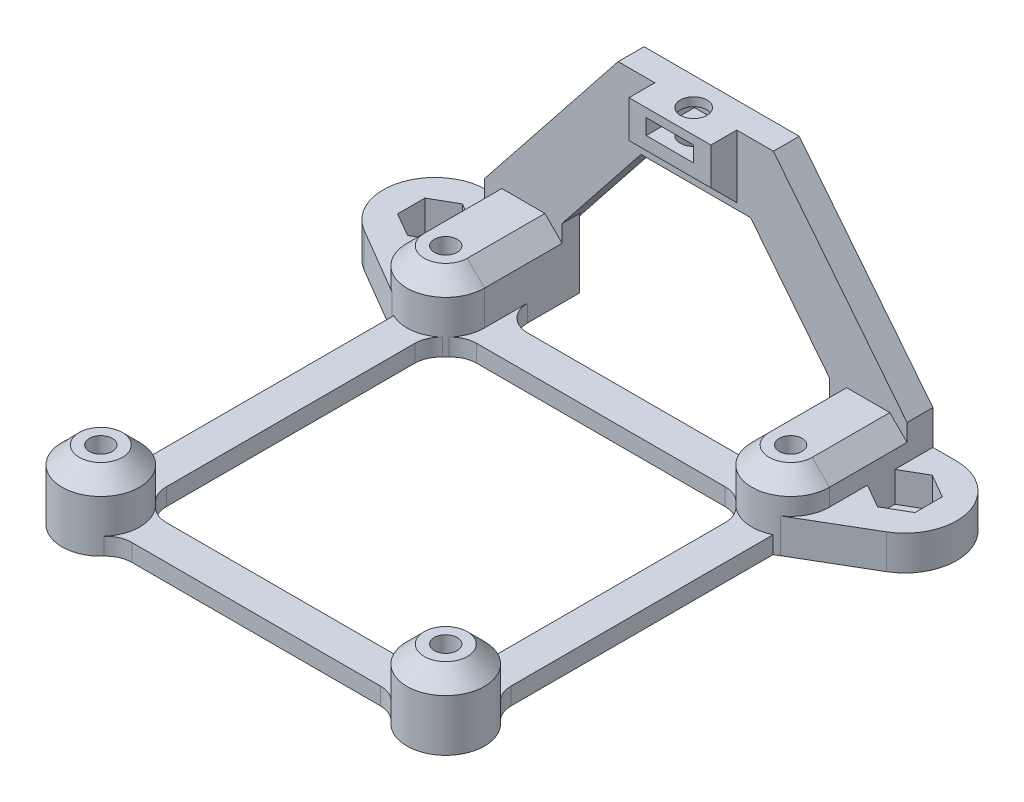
ISO-10303-21;
HEADER;
FILE_DESCRIPTION(('STEP AP214'),'2;1');
FILE_NAME('part.step','',(''),(''),'','','');
FILE_SCHEMA(('AUTOMOTIVE_DESIGN { 1 0 10303 214 1 1 1 1 }'));
ENDSEC;
DATA;
#1=APPLICATION_CONTEXT('core data for automotive mechanical design processes');
#2=APPLICATION_PROTOCOL_DEFINITION('international standard','automotive_design',2000,#1);
#3=PRODUCT_CONTEXT('',#1,'mechanical');
#4=PRODUCT('Part','Part','',(#3));
#5=PRODUCT_RELATED_PRODUCT_CATEGORY('part','',(#4));
#6=PRODUCT_DEFINITION_FORMATION('','',#4);
#7=PRODUCT_DEFINITION_CONTEXT('part definition',#1,'design');
#8=PRODUCT_DEFINITION('design','',#6,#7);
#9=PRODUCT_DEFINITION_SHAPE('','',#8);
#10=(LENGTH_UNIT() NAMED_UNIT(*) SI_UNIT(.MILLI.,.METRE.));
#11=(NAMED_UNIT(*) PLANE_ANGLE_UNIT() SI_UNIT($,.RADIAN.));
#12=(NAMED_UNIT(*) SI_UNIT($,.STERADIAN.) SOLID_ANGLE_UNIT());
#13=UNCERTAINTY_MEASURE_WITH_UNIT(LENGTH_MEASURE(1.E-05),#10,'distance_accuracy_value','');
#14=(GEOMETRIC_REPRESENTATION_CONTEXT(3) GLOBAL_UNCERTAINTY_ASSIGNED_CONTEXT((#13)) GLOBAL_UNIT_ASSIGNED_CONTEXT((#10,
#11,#12)) REPRESENTATION_CONTEXT('',''));
#15=CARTESIAN_POINT('',(0.,0.,0.));
#16=DIRECTION('',(0.,0.,1.));
#17=DIRECTION('',(1.,0.,0.));
#18=AXIS2_PLACEMENT_3D('',#15,#16,#17);
#19=CARTESIAN_POINT('',(24.5,0.,0.));
#20=DIRECTION('',(-1.,0.,0.));
#21=DIRECTION('',(0.,0.,1.));
#22=AXIS2_PLACEMENT_3D('',#19,#20,#21);
#23=PLANE('',#22);
#24=DIRECTION('',(0.,0.,1.));
#25=VECTOR('',#24,1.);
#26=CARTESIAN_POINT('',(24.5,8.,25.5));
#27=LINE('',#26,#25);
#28=CARTESIAN_POINT('',(24.5,8.,25.5));
#29=VERTEX_POINT('',#28);
#30=CARTESIAN_POINT('',(24.5,8.,28.5));
#31=VERTEX_POINT('',#30);
#32=EDGE_CURVE('E854',#29,#31,#27,.T.);
#33=ORIENTED_EDGE('',*,*,#32,.T.);
#34=DIRECTION('',(0.,-1.,0.));
#35=VECTOR('',#34,1.);
#36=CARTESIAN_POINT('',(24.5,0.,28.5));
#37=LINE('',#36,#35);
#38=CARTESIAN_POINT('',(24.5,5.99999999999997,28.5));
#39=VERTEX_POINT('',#38);
#40=EDGE_CURVE('E70',#31,#39,#37,.T.);
#41=ORIENTED_EDGE('',*,*,#40,.T.);
#42=DIRECTION('',(0.,0.,1.));
#43=VECTOR('',#42,1.);
#44=CARTESIAN_POINT('',(24.5,5.99999999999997,0.));
#45=LINE('',#44,#43);
#46=CARTESIAN_POINT('',(24.5,5.99999999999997,37.5));
#47=VERTEX_POINT('',#46);
#48=EDGE_CURVE('E1358',#39,#47,#45,.T.);
#49=ORIENTED_EDGE('',*,*,#48,.T.);
#50=DIRECTION('',(0.,-1.,0.));
#51=VECTOR('',#50,1.);
#52=CARTESIAN_POINT('',(24.5,8.,37.5));
#53=LINE('',#52,#51);
#54=CARTESIAN_POINT('',(24.5,4.,37.5));
#55=VERTEX_POINT('',#54);
#56=EDGE_CURVE('E890',#47,#55,#53,.T.);
#57=ORIENTED_EDGE('',*,*,#56,.T.);
#58=DIRECTION('',(0.,0.,-1.));
#59=VECTOR('',#58,1.);
#60=CARTESIAN_POINT('',(24.5,4.,0.));
#61=LINE('',#60,#59);
#62=CARTESIAN_POINT('',(24.5,4.,33.0877132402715));
#63=VERTEX_POINT('',#62);
#64=EDGE_CURVE('E660',#55,#63,#61,.T.);
#65=ORIENTED_EDGE('',*,*,#64,.T.);
#66=DIRECTION('',(0.,-1.,0.));
#67=VECTOR('',#66,1.);
#68=CARTESIAN_POINT('',(24.5,4.,33.0877132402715));
#69=LINE('',#68,#67);
#70=CARTESIAN_POINT('',(24.5,0.5,33.0877132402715));
#71=VERTEX_POINT('',#70);
#72=EDGE_CURVE('E624',#63,#71,#69,.T.);
#73=ORIENTED_EDGE('',*,*,#72,.T.);
#74=DIRECTION('',(0.,0.,1.));
#75=VECTOR('',#74,1.);
#76=CARTESIAN_POINT('',(24.5,0.5,29.9122867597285));
#77=LINE('',#76,#75);
#78=CARTESIAN_POINT('',(24.5,0.5,29.9122867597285));
#79=VERTEX_POINT('',#78);
#80=EDGE_CURVE('E586',#79,#71,#77,.T.);
#81=ORIENTED_EDGE('',*,*,#80,.F.);
#82=DIRECTION('',(0.,-1.,0.));
#83=VECTOR('',#82,1.);
#84=CARTESIAN_POINT('',(24.5,4.,29.9122867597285));
#85=LINE('',#84,#83);
#86=CARTESIAN_POINT('',(24.5,4.,29.9122867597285));
#87=VERTEX_POINT('',#86);
#88=EDGE_CURVE('E620',#87,#79,#85,.T.);
#89=ORIENTED_EDGE('',*,*,#88,.F.);
#90=CARTESIAN_POINT('',(24.5,4.,25.5));
#91=VERTEX_POINT('',#90);
#92=EDGE_CURVE('E666',#87,#91,#61,.T.);
#93=ORIENTED_EDGE('',*,*,#92,.T.);
#94=DIRECTION('',(0.,1.,0.));
#95=VECTOR('',#94,1.);
#96=CARTESIAN_POINT('',(24.5,0.,25.5));
#97=LINE('',#96,#95);
#98=EDGE_CURVE('E914',#91,#29,#97,.T.);
#99=ORIENTED_EDGE('',*,*,#98,.T.);
#100=EDGE_LOOP('',(#33,#41,#49,#57,#65,#73,#81,#89,#93,#99));
#101=FACE_BOUND('',#100,.T.);
#102=ADVANCED_FACE('F45',(#101),#23,.F.);
#103=CARTESIAN_POINT('',(30.,4.,29.9122867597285));
#104=DIRECTION('',(-0.5,0.,0.866025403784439));
#105=DIRECTION('',(0.866025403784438,0.,0.5));
#106=AXIS2_PLACEMENT_3D('',#103,#104,#105);
#107=PLANE('',#106);
#108=DIRECTION('',(0.,-1.,0.));
#109=VECTOR('',#108,1.);
#110=CARTESIAN_POINT('',(27.25,4.,28.3245735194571));
#111=LINE('',#110,#109);
#112=CARTESIAN_POINT('',(27.25,4.,28.3245735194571));
#113=VERTEX_POINT('',#112);
#114=CARTESIAN_POINT('',(27.25,0.5,28.3245735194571));
#115=VERTEX_POINT('',#114);
#116=EDGE_CURVE('E615',#113,#115,#111,.T.);
#117=ORIENTED_EDGE('',*,*,#116,.T.);
#118=DIRECTION('',(-0.866025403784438,0.,-0.5));
#119=VECTOR('',#118,1.);
#120=CARTESIAN_POINT('',(30.,0.5,29.9122867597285));
#121=LINE('',#120,#119);
#122=CARTESIAN_POINT('',(30.,0.5,29.9122867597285));
#123=VERTEX_POINT('',#122);
#124=EDGE_CURVE('E592',#123,#115,#121,.T.);
#125=ORIENTED_EDGE('',*,*,#124,.F.);
#126=DIRECTION('',(0.,-1.,0.));
#127=VECTOR('',#126,1.);
#128=CARTESIAN_POINT('',(30.,4.,29.9122867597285));
#129=LINE('',#128,#127);
#130=CARTESIAN_POINT('',(30.,4.,29.9122867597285));
#131=VERTEX_POINT('',#130);
#132=EDGE_CURVE('E614',#131,#123,#129,.T.);
#133=ORIENTED_EDGE('',*,*,#132,.F.);
#134=DIRECTION('',(-0.866025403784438,0.,-0.5));
#135=VECTOR('',#134,1.);
#136=CARTESIAN_POINT('',(30.,4.,29.9122867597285));
#137=LINE('',#136,#135);
#138=EDGE_CURVE('E598',#131,#113,#137,.T.);
#139=ORIENTED_EDGE('',*,*,#138,.T.);
#140=EDGE_LOOP('',(#117,#125,#133,#139));
#141=FACE_BOUND('',#140,.T.);
#142=ADVANCED_FACE('F1540',(#141),#107,.T.);
#143=CARTESIAN_POINT('',(27.25,4.,28.3245735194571));
#144=DIRECTION('',(0.5,0.,0.866025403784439));
#145=DIRECTION('',(0.866025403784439,0.,-0.5));
#146=AXIS2_PLACEMENT_3D('',#143,#144,#145);
#147=PLANE('',#146);
#148=ORIENTED_EDGE('',*,*,#88,.T.);
#149=DIRECTION('',(-0.866025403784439,0.,0.5));
#150=VECTOR('',#149,1.);
#151=CARTESIAN_POINT('',(27.25,0.5,28.3245735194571));
#152=LINE('',#151,#150);
#153=EDGE_CURVE('E589',#115,#79,#152,.T.);
#154=ORIENTED_EDGE('',*,*,#153,.F.);
#155=ORIENTED_EDGE('',*,*,#116,.F.);
#156=DIRECTION('',(-0.866025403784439,0.,0.5));
#157=VECTOR('',#156,1.);
#158=CARTESIAN_POINT('',(27.25,4.,28.3245735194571));
#159=LINE('',#158,#157);
#160=EDGE_CURVE('E611',#113,#87,#159,.T.);
#161=ORIENTED_EDGE('',*,*,#160,.T.);
#162=EDGE_LOOP('',(#148,#154,#155,#161));
#163=FACE_BOUND('',#162,.T.);
#164=ADVANCED_FACE('F1545',(#163),#147,.T.);
#165=CARTESIAN_POINT('',(24.5,4.,33.0877132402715));
#166=DIRECTION('',(0.500000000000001,0.,-0.866025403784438));
#167=DIRECTION('',(-0.866025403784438,0.,-0.500000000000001));
#168=AXIS2_PLACEMENT_3D('',#165,#166,#167);
#169=PLANE('',#168);
#170=DIRECTION('',(0.,-1.,0.));
#171=VECTOR('',#170,1.);
#172=CARTESIAN_POINT('',(27.25,4.,34.6754264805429));
#173=LINE('',#172,#171);
#174=CARTESIAN_POINT('',(27.25,4.,34.6754264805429));
#175=VERTEX_POINT('',#174);
#176=CARTESIAN_POINT('',(27.25,0.5,34.6754264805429));
#177=VERTEX_POINT('',#176);
#178=EDGE_CURVE('E628',#175,#177,#173,.T.);
#179=ORIENTED_EDGE('',*,*,#178,.T.);
#180=DIRECTION('',(0.866025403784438,0.,0.500000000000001));
#181=VECTOR('',#180,1.);
#182=CARTESIAN_POINT('',(24.5,0.5,33.0877132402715));
#183=LINE('',#182,#181);
#184=EDGE_CURVE('E583',#71,#177,#183,.T.);
#185=ORIENTED_EDGE('',*,*,#184,.F.);
#186=ORIENTED_EDGE('',*,*,#72,.F.);
#187=DIRECTION('',(0.866025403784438,0.,0.500000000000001));
#188=VECTOR('',#187,1.);
#189=CARTESIAN_POINT('',(24.5,4.,33.0877132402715));
#190=LINE('',#189,#188);
#191=EDGE_CURVE('E608',#63,#175,#190,.T.);
#192=ORIENTED_EDGE('',*,*,#191,.T.);
#193=EDGE_LOOP('',(#179,#185,#186,#192));
#194=FACE_BOUND('',#193,.T.);
#195=ADVANCED_FACE('F1524',(#194),#169,.T.);
#196=CARTESIAN_POINT('',(27.25,4.,34.6754264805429));
#197=DIRECTION('',(-0.5,0.,-0.866025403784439));
#198=DIRECTION('',(-0.866025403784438,0.,0.5));
#199=AXIS2_PLACEMENT_3D('',#196,#197,#198);
#200=PLANE('',#199);
#201=DIRECTION('',(0.,-1.,0.));
#202=VECTOR('',#201,1.);
#203=CARTESIAN_POINT('',(30.,4.,33.0877132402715));
#204=LINE('',#203,#202);
#205=CARTESIAN_POINT('',(30.,4.,33.0877132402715));
#206=VERTEX_POINT('',#205);
#207=CARTESIAN_POINT('',(30.,0.5,33.0877132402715));
#208=VERTEX_POINT('',#207);
#209=EDGE_CURVE('E632',#206,#208,#204,.T.);
#210=ORIENTED_EDGE('',*,*,#209,.T.);
#211=DIRECTION('',(0.866025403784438,0.,-0.5));
#212=VECTOR('',#211,1.);
#213=CARTESIAN_POINT('',(27.25,0.5,34.6754264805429));
#214=LINE('',#213,#212);
#215=EDGE_CURVE('E575',#177,#208,#214,.T.);
#216=ORIENTED_EDGE('',*,*,#215,.F.);
#217=ORIENTED_EDGE('',*,*,#178,.F.);
#218=DIRECTION('',(0.866025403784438,0.,-0.5));
#219=VECTOR('',#218,1.);
#220=CARTESIAN_POINT('',(27.25,4.,34.6754264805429));
#221=LINE('',#220,#219);
#222=EDGE_CURVE('E604',#175,#206,#221,.T.);
#223=ORIENTED_EDGE('',*,*,#222,.T.);
#224=EDGE_LOOP('',(#210,#216,#217,#223));
#225=FACE_BOUND('',#224,.T.);
#226=ADVANCED_FACE('F1532',(#225),#200,.T.);
#227=CARTESIAN_POINT('',(30.,4.,33.0877132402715));
#228=DIRECTION('',(-1.,0.,0.));
#229=DIRECTION('',(0.,0.,1.));
#230=AXIS2_PLACEMENT_3D('',#227,#228,#229);
#231=PLANE('',#230);
#232=ORIENTED_EDGE('',*,*,#132,.T.);
#233=DIRECTION('',(0.,0.,-1.));
#234=VECTOR('',#233,1.);
#235=CARTESIAN_POINT('',(30.,0.5,33.0877132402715));
#236=LINE('',#235,#234);
#237=EDGE_CURVE('E595',#208,#123,#236,.T.);
#238=ORIENTED_EDGE('',*,*,#237,.F.);
#239=ORIENTED_EDGE('',*,*,#209,.F.);
#240=DIRECTION('',(0.,0.,-1.));
#241=VECTOR('',#240,1.);
#242=CARTESIAN_POINT('',(30.,4.,33.0877132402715));
#243=LINE('',#242,#241);
#244=EDGE_CURVE('E601',#206,#131,#243,.T.);
#245=ORIENTED_EDGE('',*,*,#244,.T.);
#246=EDGE_LOOP('',(#232,#238,#239,#245));
#247=FACE_BOUND('',#246,.T.);
#248=ADVANCED_FACE('F1535',(#247),#231,.T.);
#249=CARTESIAN_POINT('',(-24.5,8.,37.5));
#250=DIRECTION('',(1.,0.,0.));
#251=DIRECTION('',(0.,0.,-1.));
#252=AXIS2_PLACEMENT_3D('',#249,#250,#251);
#253=PLANE('',#252);
#254=DIRECTION('',(0.,-1.,0.));
#255=VECTOR('',#254,1.);
#256=CARTESIAN_POINT('',(-24.5,8.,37.5));
#257=LINE('',#256,#255);
#258=CARTESIAN_POINT('',(-24.5,5.99999999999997,37.5));
#259=VERTEX_POINT('',#258);
#260=CARTESIAN_POINT('',(-24.5,4.,37.5));
#261=VERTEX_POINT('',#260);
#262=EDGE_CURVE('E948',#259,#261,#257,.T.);
#263=ORIENTED_EDGE('',*,*,#262,.F.);
#264=DIRECTION('',(0.,0.,-1.));
#265=VECTOR('',#264,1.);
#266=CARTESIAN_POINT('',(-24.5,5.99999999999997,28.5));
#267=LINE('',#266,#265);
#268=CARTESIAN_POINT('',(-24.5,5.99999999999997,28.5));
#269=VERTEX_POINT('',#268);
#270=EDGE_CURVE('E1379',#259,#269,#267,.T.);
#271=ORIENTED_EDGE('',*,*,#270,.T.);
#272=DIRECTION('',(0.,1.,0.));
#273=VECTOR('',#272,1.);
#274=CARTESIAN_POINT('',(-24.5,0.,28.5));
#275=LINE('',#274,#273);
#276=CARTESIAN_POINT('',(-24.5,8.,28.5));
#277=VERTEX_POINT('',#276);
#278=EDGE_CURVE('E1376',#269,#277,#275,.T.);
#279=ORIENTED_EDGE('',*,*,#278,.T.);
#280=DIRECTION('',(0.,0.,1.));
#281=VECTOR('',#280,1.);
#282=CARTESIAN_POINT('',(-24.5,8.,25.5));
#283=LINE('',#282,#281);
#284=CARTESIAN_POINT('',(-24.5,8.,25.5));
#285=VERTEX_POINT('',#284);
#286=EDGE_CURVE('E883',#285,#277,#283,.T.);
#287=ORIENTED_EDGE('',*,*,#286,.F.);
#288=DIRECTION('',(0.,-1.,0.));
#289=VECTOR('',#288,1.);
#290=CARTESIAN_POINT('',(-24.5,8.,25.5));
#291=LINE('',#290,#289);
#292=CARTESIAN_POINT('',(-24.5,4.,25.5));
#293=VERTEX_POINT('',#292);
#294=EDGE_CURVE('E951',#285,#293,#291,.T.);
#295=ORIENTED_EDGE('',*,*,#294,.T.);
#296=DIRECTION('',(0.,0.,1.));
#297=VECTOR('',#296,1.);
#298=CARTESIAN_POINT('',(-24.5,4.,37.5));
#299=LINE('',#298,#297);
#300=CARTESIAN_POINT('',(-24.5,4.,29.9122867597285));
#301=VERTEX_POINT('',#300);
#302=EDGE_CURVE('E1099',#293,#301,#299,.T.);
#303=ORIENTED_EDGE('',*,*,#302,.T.);
#304=DIRECTION('',(0.,-1.,0.));
#305=VECTOR('',#304,1.);
#306=CARTESIAN_POINT('',(-24.5,4.,29.9122867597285));
#307=LINE('',#306,#305);
#308=CARTESIAN_POINT('',(-24.5,0.5,29.9122867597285));
#309=VERTEX_POINT('',#308);
#310=EDGE_CURVE('E732',#301,#309,#307,.T.);
#311=ORIENTED_EDGE('',*,*,#310,.T.);
#312=DIRECTION('',(0.,0.,1.));
#313=VECTOR('',#312,1.);
#314=CARTESIAN_POINT('',(-24.5,0.5,29.9122867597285));
#315=LINE('',#314,#313);
#316=CARTESIAN_POINT('',(-24.5,0.5,33.0877132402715));
#317=VERTEX_POINT('',#316);
#318=EDGE_CURVE('E688',#309,#317,#315,.T.);
#319=ORIENTED_EDGE('',*,*,#318,.T.);
#320=DIRECTION('',(0.,-1.,0.));
#321=VECTOR('',#320,1.);
#322=CARTESIAN_POINT('',(-24.5,4.,33.0877132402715));
#323=LINE('',#322,#321);
#324=CARTESIAN_POINT('',(-24.5,4.,33.0877132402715));
#325=VERTEX_POINT('',#324);
#326=EDGE_CURVE('E728',#325,#317,#323,.T.);
#327=ORIENTED_EDGE('',*,*,#326,.F.);
#328=EDGE_CURVE('E1095',#325,#261,#299,.T.);
#329=ORIENTED_EDGE('',*,*,#328,.T.);
#330=EDGE_LOOP('',(#263,#271,#279,#287,#295,#303,#311,#319,#327,#329));
#331=FACE_BOUND('',#330,.T.);
#332=ADVANCED_FACE('F1439',(#331),#253,.F.);
#333=CARTESIAN_POINT('',(-30.,4.,29.9122867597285));
#334=DIRECTION('',(-0.5,0.,-0.866025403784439));
#335=DIRECTION('',(-0.866025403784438,0.,0.5));
#336=AXIS2_PLACEMENT_3D('',#333,#334,#335);
#337=PLANE('',#336);
#338=DIRECTION('',(0.866025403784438,0.,-0.5));
#339=VECTOR('',#338,1.);
#340=CARTESIAN_POINT('',(-30.,0.5,29.9122867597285));
#341=LINE('',#340,#339);
#342=CARTESIAN_POINT('',(-30.,0.5,29.9122867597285));
#343=VERTEX_POINT('',#342);
#344=CARTESIAN_POINT('',(-27.25,0.5,28.3245735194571));
#345=VERTEX_POINT('',#344);
#346=EDGE_CURVE('E681',#343,#345,#341,.T.);
#347=ORIENTED_EDGE('',*,*,#346,.T.);
#348=DIRECTION('',(0.,-1.,0.));
#349=VECTOR('',#348,1.);
#350=CARTESIAN_POINT('',(-27.25,4.,28.3245735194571));
#351=LINE('',#350,#349);
#352=CARTESIAN_POINT('',(-27.25,4.,28.3245735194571));
#353=VERTEX_POINT('',#352);
#354=EDGE_CURVE('E714',#353,#345,#351,.T.);
#355=ORIENTED_EDGE('',*,*,#354,.F.);
#356=DIRECTION('',(0.866025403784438,0.,-0.5));
#357=VECTOR('',#356,1.);
#358=CARTESIAN_POINT('',(-30.,4.,29.9122867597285));
#359=LINE('',#358,#357);
#360=CARTESIAN_POINT('',(-30.,4.,29.9122867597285));
#361=VERTEX_POINT('',#360);
#362=EDGE_CURVE('E694',#361,#353,#359,.T.);
#363=ORIENTED_EDGE('',*,*,#362,.F.);
#364=DIRECTION('',(0.,-1.,0.));
#365=VECTOR('',#364,1.);
#366=CARTESIAN_POINT('',(-30.,4.,29.9122867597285));
#367=LINE('',#366,#365);
#368=EDGE_CURVE('E715',#361,#343,#367,.T.);
#369=ORIENTED_EDGE('',*,*,#368,.T.);
#370=EDGE_LOOP('',(#347,#355,#363,#369));
#371=FACE_BOUND('',#370,.T.);
#372=ADVANCED_FACE('F1668',(#371),#337,.F.);
#373=CARTESIAN_POINT('',(-30.,4.,33.0877132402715));
#374=DIRECTION('',(-1.,0.,0.));
#375=DIRECTION('',(0.,0.,1.));
#376=AXIS2_PLACEMENT_3D('',#373,#374,#375);
#377=PLANE('',#376);
#378=DIRECTION('',(0.,0.,-1.));
#379=VECTOR('',#378,1.);
#380=CARTESIAN_POINT('',(-30.,0.5,33.0877132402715));
#381=LINE('',#380,#379);
#382=CARTESIAN_POINT('',(-30.,0.5,33.0877132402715));
#383=VERTEX_POINT('',#382);
#384=EDGE_CURVE('E678',#383,#343,#381,.T.);
#385=ORIENTED_EDGE('',*,*,#384,.T.);
#386=ORIENTED_EDGE('',*,*,#368,.F.);
#387=DIRECTION('',(0.,0.,-1.));
#388=VECTOR('',#387,1.);
#389=CARTESIAN_POINT('',(-30.,4.,33.0877132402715));
#390=LINE('',#389,#388);
#391=CARTESIAN_POINT('',(-30.,4.,33.0877132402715));
#392=VERTEX_POINT('',#391);
#393=EDGE_CURVE('E710',#392,#361,#390,.T.);
#394=ORIENTED_EDGE('',*,*,#393,.F.);
#395=DIRECTION('',(0.,-1.,0.));
#396=VECTOR('',#395,1.);
#397=CARTESIAN_POINT('',(-30.,4.,33.0877132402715));
#398=LINE('',#397,#396);
#399=EDGE_CURVE('E720',#392,#383,#398,.T.);
#400=ORIENTED_EDGE('',*,*,#399,.T.);
#401=EDGE_LOOP('',(#385,#386,#394,#400));
#402=FACE_BOUND('',#401,.T.);
#403=ADVANCED_FACE('F1789',(#402),#377,.F.);
#404=CARTESIAN_POINT('',(-27.25,4.,34.6754264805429));
#405=DIRECTION('',(-0.5,0.,0.866025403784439));
#406=DIRECTION('',(0.866025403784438,0.,0.5));
#407=AXIS2_PLACEMENT_3D('',#404,#405,#406);
#408=PLANE('',#407);
#409=DIRECTION('',(-0.866025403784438,0.,-0.5));
#410=VECTOR('',#409,1.);
#411=CARTESIAN_POINT('',(-27.25,0.5,34.6754264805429));
#412=LINE('',#411,#410);
#413=CARTESIAN_POINT('',(-27.25,0.5,34.6754264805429));
#414=VERTEX_POINT('',#413);
#415=EDGE_CURVE('E671',#414,#383,#412,.T.);
#416=ORIENTED_EDGE('',*,*,#415,.T.);
#417=ORIENTED_EDGE('',*,*,#399,.F.);
#418=DIRECTION('',(-0.866025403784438,0.,-0.5));
#419=VECTOR('',#418,1.);
#420=CARTESIAN_POINT('',(-27.25,4.,34.6754264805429));
#421=LINE('',#420,#419);
#422=CARTESIAN_POINT('',(-27.25,4.,34.6754264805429));
#423=VERTEX_POINT('',#422);
#424=EDGE_CURVE('E706',#423,#392,#421,.T.);
#425=ORIENTED_EDGE('',*,*,#424,.F.);
#426=DIRECTION('',(0.,-1.,0.));
#427=VECTOR('',#426,1.);
#428=CARTESIAN_POINT('',(-27.25,4.,34.6754264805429));
#429=LINE('',#428,#427);
#430=EDGE_CURVE('E724',#423,#414,#429,.T.);
#431=ORIENTED_EDGE('',*,*,#430,.T.);
#432=EDGE_LOOP('',(#416,#417,#425,#431));
#433=FACE_BOUND('',#432,.T.);
#434=ADVANCED_FACE('F1787',(#433),#408,.F.);
#435=CARTESIAN_POINT('',(-24.5,4.,33.0877132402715));
#436=DIRECTION('',(0.500000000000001,0.,0.866025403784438));
#437=DIRECTION('',(0.866025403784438,0.,-0.500000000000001));
#438=AXIS2_PLACEMENT_3D('',#435,#436,#437);
#439=PLANE('',#438);
#440=DIRECTION('',(-0.866025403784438,0.,0.500000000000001));
#441=VECTOR('',#440,1.);
#442=CARTESIAN_POINT('',(-24.5,0.5,33.0877132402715));
#443=LINE('',#442,#441);
#444=EDGE_CURVE('E691',#317,#414,#443,.T.);
#445=ORIENTED_EDGE('',*,*,#444,.T.);
#446=ORIENTED_EDGE('',*,*,#430,.F.);
#447=DIRECTION('',(-0.866025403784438,0.,0.500000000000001));
#448=VECTOR('',#447,1.);
#449=CARTESIAN_POINT('',(-24.5,4.,33.0877132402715));
#450=LINE('',#449,#448);
#451=EDGE_CURVE('E702',#325,#423,#450,.T.);
#452=ORIENTED_EDGE('',*,*,#451,.F.);
#453=ORIENTED_EDGE('',*,*,#326,.T.);
#454=EDGE_LOOP('',(#445,#446,#452,#453));
#455=FACE_BOUND('',#454,.T.);
#456=ADVANCED_FACE('F1783',(#455),#439,.F.);
#457=CARTESIAN_POINT('',(-27.25,4.,28.3245735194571));
#458=DIRECTION('',(0.5,0.,-0.866025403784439));
#459=DIRECTION('',(-0.866025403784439,0.,-0.5));
#460=AXIS2_PLACEMENT_3D('',#457,#458,#459);
#461=PLANE('',#460);
#462=DIRECTION('',(0.866025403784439,0.,0.5));
#463=VECTOR('',#462,1.);
#464=CARTESIAN_POINT('',(-27.25,0.5,28.3245735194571));
#465=LINE('',#464,#463);
#466=EDGE_CURVE('E685',#345,#309,#465,.T.);
#467=ORIENTED_EDGE('',*,*,#466,.T.);
#468=ORIENTED_EDGE('',*,*,#310,.F.);
#469=DIRECTION('',(0.866025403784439,0.,0.5));
#470=VECTOR('',#469,1.);
#471=CARTESIAN_POINT('',(-27.25,4.,28.3245735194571));
#472=LINE('',#471,#470);
#473=EDGE_CURVE('E698',#353,#301,#472,.T.);
#474=ORIENTED_EDGE('',*,*,#473,.F.);
#475=ORIENTED_EDGE('',*,*,#354,.T.);
#476=EDGE_LOOP('',(#467,#468,#474,#475));
#477=FACE_BOUND('',#476,.T.);
#478=ADVANCED_FACE('F1773',(#477),#461,.F.);
#479=CARTESIAN_POINT('',(-4.75,23.2,31.5));
#480=DIRECTION('',(0.,0.,1.));
#481=DIRECTION('',(1.,0.,0.));
#482=AXIS2_PLACEMENT_3D('',#479,#480,#481);
#483=PLANE('',#482);
#484=DIRECTION('',(1.,0.,0.));
#485=VECTOR('',#484,1.);
#486=CARTESIAN_POINT('',(-4.75,27.5,31.5));
#487=LINE('',#486,#485);
#488=CARTESIAN_POINT('',(-4.75,27.5,31.5));
#489=VERTEX_POINT('',#488);
#490=CARTESIAN_POINT('',(4.75,27.5,31.5));
#491=VERTEX_POINT('',#490);
#492=EDGE_CURVE('E808',#489,#491,#487,.T.);
#493=ORIENTED_EDGE('',*,*,#492,.F.);
#494=DIRECTION('',(0.,1.,0.));
#495=VECTOR('',#494,1.);
#496=CARTESIAN_POINT('',(-4.75,23.2,31.5));
#497=LINE('',#496,#495);
#498=CARTESIAN_POINT('',(-4.75,23.2,31.5));
#499=VERTEX_POINT('',#498);
#500=EDGE_CURVE('E803',#499,#489,#497,.T.);
#501=ORIENTED_EDGE('',*,*,#500,.F.);
#502=DIRECTION('',(1.,0.,0.));
#503=VECTOR('',#502,1.);
#504=CARTESIAN_POINT('',(-4.75,23.2,31.5));
#505=LINE('',#504,#503);
#506=CARTESIAN_POINT('',(4.75,23.2,31.5));
#507=VERTEX_POINT('',#506);
#508=EDGE_CURVE('E799',#499,#507,#505,.T.);
#509=ORIENTED_EDGE('',*,*,#508,.T.);
#510=DIRECTION('',(0.,1.,0.));
#511=VECTOR('',#510,1.);
#512=CARTESIAN_POINT('',(4.75,23.2,31.5));
#513=LINE('',#512,#511);
#514=EDGE_CURVE('E823',#507,#491,#513,.T.);
#515=ORIENTED_EDGE('',*,*,#514,.T.);
#516=EDGE_LOOP('',(#493,#501,#509,#515));
#517=FACE_BOUND('',#516,.T.);
#518=DIRECTION('',(0.,1.,0.));
#519=VECTOR('',#518,1.);
#520=CARTESIAN_POINT('',(2.75,24.7,31.5));
#521=LINE('',#520,#519);
#522=CARTESIAN_POINT('',(2.75,24.7,31.5));
#523=VERTEX_POINT('',#522);
#524=CARTESIAN_POINT('',(2.75,26.5,31.5));
#525=VERTEX_POINT('',#524);
#526=EDGE_CURVE('E792',#523,#525,#521,.T.);
#527=ORIENTED_EDGE('',*,*,#526,.F.);
#528=DIRECTION('',(1.,0.,0.));
#529=VECTOR('',#528,1.);
#530=CARTESIAN_POINT('',(-2.75,24.7,31.5));
#531=LINE('',#530,#529);
#532=CARTESIAN_POINT('',(-2.75,24.7,31.5));
#533=VERTEX_POINT('',#532);
#534=EDGE_CURVE('E547',#533,#523,#531,.T.);
#535=ORIENTED_EDGE('',*,*,#534,.F.);
#536=DIRECTION('',(0.,1.,0.));
#537=VECTOR('',#536,1.);
#538=CARTESIAN_POINT('',(-2.75,24.7,31.5));
#539=LINE('',#538,#537);
#540=CARTESIAN_POINT('',(-2.75,26.5,31.5));
#541=VERTEX_POINT('',#540);
#542=EDGE_CURVE('E542',#533,#541,#539,.T.);
#543=ORIENTED_EDGE('',*,*,#542,.T.);
#544=DIRECTION('',(1.,0.,0.));
#545=VECTOR('',#544,1.);
#546=CARTESIAN_POINT('',(-2.75,26.5,31.5));
#547=LINE('',#546,#545);
#548=EDGE_CURVE('E786',#541,#525,#547,.T.);
#549=ORIENTED_EDGE('',*,*,#548,.T.);
#550=EDGE_LOOP('',(#527,#535,#543,#549));
#551=FACE_BOUND('',#550,.T.);
#552=ADVANCED_FACE('F1713',(#517,#551),#483,.T.);
#553=CARTESIAN_POINT('',(-22.,2.,35.5));
#554=DIRECTION('',(-1.,0.,0.));
#555=DIRECTION('',(0.,0.,1.));
#556=AXIS2_PLACEMENT_3D('',#553,#554,#555);
#557=PLANE('',#556);
#558=DIRECTION('',(0.,0.,-1.));
#559=VECTOR('',#558,1.);
#560=CARTESIAN_POINT('',(-22.,0.,35.5));
#561=LINE('',#560,#559);
#562=CARTESIAN_POINT('',(-22.,0.,71.9098300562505));
#563=VERTEX_POINT('',#562);
#564=CARTESIAN_POINT('',(-22.,0.,41.5311288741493));
#565=VERTEX_POINT('',#564);
#566=EDGE_CURVE('E1020',#563,#565,#561,.T.);
#567=ORIENTED_EDGE('',*,*,#566,.F.);
#568=DIRECTION('',(0.,-1.,0.));
#569=VECTOR('',#568,1.);
#570=CARTESIAN_POINT('',(-22.,2.,71.9098300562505));
#571=LINE('',#570,#569);
#572=CARTESIAN_POINT('',(-22.,2.,71.9098300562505));
#573=VERTEX_POINT('',#572);
#574=EDGE_CURVE('E1128',#563,#573,#571,.F.);
#575=ORIENTED_EDGE('',*,*,#574,.T.);
#576=DIRECTION('',(0.,0.,-1.));
#577=VECTOR('',#576,1.);
#578=CARTESIAN_POINT('',(-22.,2.,35.5));
#579=LINE('',#578,#577);
#580=CARTESIAN_POINT('',(-22.,2.,41.5311288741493));
#581=VERTEX_POINT('',#580);
#582=EDGE_CURVE('E1036',#573,#581,#579,.T.);
#583=ORIENTED_EDGE('',*,*,#582,.T.);
#584=DIRECTION('',(0.,-1.,0.));
#585=VECTOR('',#584,1.);
#586=CARTESIAN_POINT('',(-22.,8.,41.5311288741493));
#587=LINE('',#586,#585);
#588=EDGE_CURVE('E969',#581,#565,#587,.T.);
#589=ORIENTED_EDGE('',*,*,#588,.T.);
#590=EDGE_LOOP('',(#567,#575,#583,#589));
#591=FACE_BOUND('',#590,.T.);
#592=ADVANCED_FACE('F1710',(#591),#557,.T.);
#593=CARTESIAN_POINT('',(0.,2.,0.));
#594=DIRECTION('',(0.,1.,0.));
#595=DIRECTION('',(0.,0.,1.));
#596=AXIS2_PLACEMENT_3D('',#593,#594,#595);
#597=PLANE('',#596);
#598=CARTESIAN_POINT('',(-20.,2.,77.5));
#599=DIRECTION('',(0.,1.,0.));
#600=DIRECTION('',(0.,0.,1.));
#601=AXIS2_PLACEMENT_3D('',#598,#599,#600);
#602=CIRCLE('',#601,4.50000000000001);
#603=CARTESIAN_POINT('',(-23.,2.,74.1458980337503));
#604=VERTEX_POINT('',#603);
#605=CARTESIAN_POINT('',(-17.,2.,74.1458980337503));
#606=VERTEX_POINT('',#605);
#607=EDGE_CURVE('E999',#604,#606,#602,.F.);
#608=ORIENTED_EDGE('',*,*,#607,.T.);
#609=CARTESIAN_POINT('',(-15.,2.,71.9098300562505));
#610=DIRECTION('',(0.,1.,0.));
#611=DIRECTION('',(0.,0.,1.));
#612=AXIS2_PLACEMENT_3D('',#609,#610,#611);
#613=CIRCLE('',#612,3.);
#614=CARTESIAN_POINT('',(-18.,2.,71.9098300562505));
#615=VERTEX_POINT('',#614);
#616=EDGE_CURVE('E1280',#606,#615,#613,.F.);
#617=ORIENTED_EDGE('',*,*,#616,.T.);
#618=DIRECTION('',(0.,0.,-1.));
#619=VECTOR('',#618,1.);
#620=CARTESIAN_POINT('',(-18.,2.,39.5));
#621=LINE('',#620,#619);
#622=CARTESIAN_POINT('',(-18.,2.,43.0901699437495));
#623=VERTEX_POINT('',#622);
#624=EDGE_CURVE('E1003',#615,#623,#621,.T.);
#625=ORIENTED_EDGE('',*,*,#624,.T.);
#626=CARTESIAN_POINT('',(-15.,2.,43.0901699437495));
#627=DIRECTION('',(0.,1.,0.));
#628=DIRECTION('',(0.,0.,1.));
#629=AXIS2_PLACEMENT_3D('',#626,#627,#628);
#630=CIRCLE('',#629,3.);
#631=CARTESIAN_POINT('',(-17.,2.,40.8541019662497));
#632=VERTEX_POINT('',#631);
#633=EDGE_CURVE('E1302',#623,#632,#630,.F.);
#634=ORIENTED_EDGE('',*,*,#633,.T.);
#635=CARTESIAN_POINT('',(-20.,2.,37.5));
#636=DIRECTION('',(0.,1.,0.));
#637=DIRECTION('',(0.,0.,1.));
#638=AXIS2_PLACEMENT_3D('',#635,#636,#637);
#639=CIRCLE('',#638,4.5);
#640=EDGE_CURVE('E968',#632,#581,#639,.F.);
#641=ORIENTED_EDGE('',*,*,#640,.T.);
#642=ORIENTED_EDGE('',*,*,#582,.F.);
#643=CARTESIAN_POINT('',(-25.,2.,71.9098300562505));
#644=DIRECTION('',(0.,1.,0.));
#645=DIRECTION('',(0.,0.,1.));
#646=AXIS2_PLACEMENT_3D('',#643,#644,#645);
#647=CIRCLE('',#646,3.);
#648=EDGE_CURVE('E1228',#573,#604,#647,.F.);
#649=ORIENTED_EDGE('',*,*,#648,.T.);
#650=EDGE_LOOP('',(#608,#617,#625,#634,#641,#642,#649));
#651=FACE_BOUND('',#650,.T.);
#652=ADVANCED_FACE('F1702',(#651),#597,.T.);
#653=DIRECTION('',(0.,0.,1.));
#654=VECTOR('',#653,1.);
#655=CARTESIAN_POINT('',(22.,2.,35.5));
#656=LINE('',#655,#654);
#657=CARTESIAN_POINT('',(22.,2.,41.5311288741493));
#658=VERTEX_POINT('',#657);
#659=CARTESIAN_POINT('',(22.,2.,71.9098300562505));
#660=VERTEX_POINT('',#659);
#661=EDGE_CURVE('E1044',#658,#660,#656,.T.);
#662=ORIENTED_EDGE('',*,*,#661,.F.);
#663=CARTESIAN_POINT('',(20.,2.,37.5));
#664=DIRECTION('',(0.,1.,0.));
#665=DIRECTION('',(0.,0.,1.));
#666=AXIS2_PLACEMENT_3D('',#663,#664,#665);
#667=CIRCLE('',#666,4.5);
#668=CARTESIAN_POINT('',(17.,2.,40.8541019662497));
#669=VERTEX_POINT('',#668);
#670=EDGE_CURVE('E961',#658,#669,#667,.F.);
#671=ORIENTED_EDGE('',*,*,#670,.T.);
#672=CARTESIAN_POINT('',(15.,2.,43.0901699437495));
#673=DIRECTION('',(0.,1.,0.));
#674=DIRECTION('',(0.,0.,1.));
#675=AXIS2_PLACEMENT_3D('',#672,#673,#674);
#676=CIRCLE('',#675,3.);
#677=CARTESIAN_POINT('',(18.,2.,43.0901699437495));
#678=VERTEX_POINT('',#677);
#679=EDGE_CURVE('E1267',#669,#678,#676,.F.);
#680=ORIENTED_EDGE('',*,*,#679,.T.);
#681=DIRECTION('',(0.,0.,1.));
#682=VECTOR('',#681,1.);
#683=CARTESIAN_POINT('',(18.,2.,39.5));
#684=LINE('',#683,#682);
#685=CARTESIAN_POINT('',(18.,2.,71.9098300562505));
#686=VERTEX_POINT('',#685);
#687=EDGE_CURVE('E1012',#678,#686,#684,.T.);
#688=ORIENTED_EDGE('',*,*,#687,.T.);
#689=CARTESIAN_POINT('',(15.,2.,71.9098300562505));
#690=DIRECTION('',(0.,1.,0.));
#691=DIRECTION('',(0.,0.,1.));
#692=AXIS2_PLACEMENT_3D('',#689,#690,#691);
#693=CIRCLE('',#692,3.);
#694=CARTESIAN_POINT('',(17.,2.,74.1458980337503));
#695=VERTEX_POINT('',#694);
#696=EDGE_CURVE('E1254',#686,#695,#693,.F.);
#697=ORIENTED_EDGE('',*,*,#696,.T.);
#698=CARTESIAN_POINT('',(20.,2.,77.5));
#699=DIRECTION('',(0.,1.,0.));
#700=DIRECTION('',(0.,0.,1.));
#701=AXIS2_PLACEMENT_3D('',#698,#699,#700);
#702=CIRCLE('',#701,4.50000000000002);
#703=CARTESIAN_POINT('',(23.,2.,74.1458980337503));
#704=VERTEX_POINT('',#703);
#705=EDGE_CURVE('E1068',#704,#695,#702,.T.);
#706=ORIENTED_EDGE('',*,*,#705,.F.);
#707=CARTESIAN_POINT('',(25.,2.,71.9098300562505));
#708=DIRECTION('',(0.,1.,0.));
#709=DIRECTION('',(0.,0.,1.));
#710=AXIS2_PLACEMENT_3D('',#707,#708,#709);
#711=CIRCLE('',#710,3.);
#712=EDGE_CURVE('E1235',#704,#660,#711,.F.);
#713=ORIENTED_EDGE('',*,*,#712,.T.);
#714=EDGE_LOOP('',(#662,#671,#680,#688,#697,#706,#713));
#715=FACE_BOUND('',#714,.T.);
#716=ADVANCED_FACE('F1577',(#715),#597,.T.);
#717=CARTESIAN_POINT('',(-18.,2.,39.5));
#718=DIRECTION('',(-1.,0.,0.));
#719=DIRECTION('',(0.,0.,1.));
#720=AXIS2_PLACEMENT_3D('',#717,#718,#719);
#721=PLANE('',#720);
#722=ORIENTED_EDGE('',*,*,#624,.F.);
#723=DIRECTION('',(0.,1.,0.));
#724=VECTOR('',#723,1.);
#725=CARTESIAN_POINT('',(-18.,0.,71.9098300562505));
#726=LINE('',#725,#724);
#727=CARTESIAN_POINT('',(-18.,0.,71.9098300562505));
#728=VERTEX_POINT('',#727);
#729=EDGE_CURVE('E1203',#615,#728,#726,.F.);
#730=ORIENTED_EDGE('',*,*,#729,.T.);
#731=DIRECTION('',(0.,0.,-1.));
#732=VECTOR('',#731,1.);
#733=CARTESIAN_POINT('',(-18.,0.,39.5));
#734=LINE('',#733,#732);
#735=CARTESIAN_POINT('',(-18.,0.,43.0901699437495));
#736=VERTEX_POINT('',#735);
#737=EDGE_CURVE('E1021',#728,#736,#734,.T.);
#738=ORIENTED_EDGE('',*,*,#737,.T.);
#739=DIRECTION('',(0.,1.,0.));
#740=VECTOR('',#739,1.);
#741=CARTESIAN_POINT('',(-18.,2.,43.0901699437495));
#742=LINE('',#741,#740);
#743=EDGE_CURVE('E1200',#736,#623,#742,.T.);
#744=ORIENTED_EDGE('',*,*,#743,.T.);
#745=EDGE_LOOP('',(#722,#730,#738,#744));
#746=FACE_BOUND('',#745,.T.);
#747=ADVANCED_FACE('F1695',(#746),#721,.F.);
#748=CARTESIAN_POINT('',(22.,2.,35.5));
#749=DIRECTION('',(1.,0.,0.));
#750=DIRECTION('',(0.,0.,-1.));
#751=AXIS2_PLACEMENT_3D('',#748,#749,#750);
#752=PLANE('',#751);
#753=ORIENTED_EDGE('',*,*,#661,.T.);
#754=DIRECTION('',(0.,-1.,0.));
#755=VECTOR('',#754,1.);
#756=CARTESIAN_POINT('',(22.,2.,71.9098300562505));
#757=LINE('',#756,#755);
#758=CARTESIAN_POINT('',(22.,0.,71.9098300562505));
#759=VERTEX_POINT('',#758);
#760=EDGE_CURVE('E1162',#660,#759,#757,.T.);
#761=ORIENTED_EDGE('',*,*,#760,.T.);
#762=DIRECTION('',(0.,0.,1.));
#763=VECTOR('',#762,1.);
#764=CARTESIAN_POINT('',(22.,0.,35.5));
#765=LINE('',#764,#763);
#766=CARTESIAN_POINT('',(22.,0.,41.5311288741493));
#767=VERTEX_POINT('',#766);
#768=EDGE_CURVE('E1059',#767,#759,#765,.T.);
#769=ORIENTED_EDGE('',*,*,#768,.F.);
#770=DIRECTION('',(0.,-1.,0.));
#771=VECTOR('',#770,1.);
#772=CARTESIAN_POINT('',(22.,8.,41.5311288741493));
#773=LINE('',#772,#771);
#774=EDGE_CURVE('E962',#767,#658,#773,.F.);
#775=ORIENTED_EDGE('',*,*,#774,.T.);
#776=EDGE_LOOP('',(#753,#761,#769,#775));
#777=FACE_BOUND('',#776,.T.);
#778=ADVANCED_FACE('F1580',(#777),#752,.T.);
#779=CARTESIAN_POINT('',(18.,2.,39.5));
#780=DIRECTION('',(1.,0.,0.));
#781=DIRECTION('',(0.,0.,-1.));
#782=AXIS2_PLACEMENT_3D('',#779,#780,#781);
#783=PLANE('',#782);
#784=DIRECTION('',(0.,0.,1.));
#785=VECTOR('',#784,1.);
#786=CARTESIAN_POINT('',(18.,0.,39.5));
#787=LINE('',#786,#785);
#788=CARTESIAN_POINT('',(18.,0.,43.0901699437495));
#789=VERTEX_POINT('',#788);
#790=CARTESIAN_POINT('',(18.,0.,71.9098300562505));
#791=VERTEX_POINT('',#790);
#792=EDGE_CURVE('E1029',#789,#791,#787,.T.);
#793=ORIENTED_EDGE('',*,*,#792,.T.);
#794=DIRECTION('',(0.,1.,0.));
#795=VECTOR('',#794,1.);
#796=CARTESIAN_POINT('',(18.,2.,71.9098300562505));
#797=LINE('',#796,#795);
#798=EDGE_CURVE('E1175',#791,#686,#797,.T.);
#799=ORIENTED_EDGE('',*,*,#798,.T.);
#800=ORIENTED_EDGE('',*,*,#687,.F.);
#801=DIRECTION('',(0.,1.,0.));
#802=VECTOR('',#801,1.);
#803=CARTESIAN_POINT('',(18.,0.,43.0901699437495));
#804=LINE('',#803,#802);
#805=EDGE_CURVE('E1172',#678,#789,#804,.F.);
#806=ORIENTED_EDGE('',*,*,#805,.T.);
#807=EDGE_LOOP('',(#793,#799,#800,#806));
#808=FACE_BOUND('',#807,.T.);
#809=ADVANCED_FACE('F1590',(#808),#783,.F.);
#810=CARTESIAN_POINT('',(-22.,2.,35.5));
#811=DIRECTION('',(0.,0.,-1.));
#812=DIRECTION('',(-1.,0.,0.));
#813=AXIS2_PLACEMENT_3D('',#810,#811,#812);
#814=PLANE('',#813);
#815=DIRECTION('',(1.,0.,0.));
#816=VECTOR('',#815,1.);
#817=CARTESIAN_POINT('',(-22.,0.,35.5));
#818=LINE('',#817,#816);
#819=CARTESIAN_POINT('',(-12.5,0.,35.5));
#820=VERTEX_POINT('',#819);
#821=CARTESIAN_POINT('',(12.5,0.,35.5));
#822=VERTEX_POINT('',#821);
#823=EDGE_CURVE('E1055',#820,#822,#818,.T.);
#824=ORIENTED_EDGE('',*,*,#823,.F.);
#825=DIRECTION('',(0.,1.,0.));
#826=VECTOR('',#825,1.);
#827=CARTESIAN_POINT('',(-12.5,2.,35.5));
#828=LINE('',#827,#826);
#829=CARTESIAN_POINT('',(-12.5,2.,35.5));
#830=VERTEX_POINT('',#829);
#831=EDGE_CURVE('E1117',#820,#830,#828,.T.);
#832=ORIENTED_EDGE('',*,*,#831,.T.);
#833=DIRECTION('',(1.,0.,0.));
#834=VECTOR('',#833,1.);
#835=CARTESIAN_POINT('',(-22.,2.,35.5));
#836=LINE('',#835,#834);
#837=CARTESIAN_POINT('',(12.5,2.,35.5));
#838=VERTEX_POINT('',#837);
#839=EDGE_CURVE('E1039',#830,#838,#836,.T.);
#840=ORIENTED_EDGE('',*,*,#839,.T.);
#841=DIRECTION('',(0.,-1.,0.));
#842=VECTOR('',#841,1.);
#843=CARTESIAN_POINT('',(12.5,2.,35.5));
#844=LINE('',#843,#842);
#845=EDGE_CURVE('E1113',#838,#822,#844,.T.);
#846=ORIENTED_EDGE('',*,*,#845,.T.);
#847=EDGE_LOOP('',(#824,#832,#840,#846));
#848=FACE_BOUND('',#847,.T.);
#849=ADVANCED_FACE('F1690',(#848),#814,.T.);
#850=CARTESIAN_POINT('',(-18.,2.,39.5));
#851=DIRECTION('',(0.,0.,-1.));
#852=DIRECTION('',(-1.,0.,0.));
#853=AXIS2_PLACEMENT_3D('',#850,#851,#852);
#854=PLANE('',#853);
#855=DIRECTION('',(1.,0.,0.));
#856=VECTOR('',#855,1.);
#857=CARTESIAN_POINT('',(-18.,0.,39.5));
#858=LINE('',#857,#856);
#859=CARTESIAN_POINT('',(-14.4098300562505,0.,39.5));
#860=VERTEX_POINT('',#859);
#861=CARTESIAN_POINT('',(14.4098300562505,0.,39.5));
#862=VERTEX_POINT('',#861);
#863=EDGE_CURVE('E1025',#860,#862,#858,.T.);
#864=ORIENTED_EDGE('',*,*,#863,.T.);
#865=DIRECTION('',(0.,1.,0.));
#866=VECTOR('',#865,1.);
#867=CARTESIAN_POINT('',(14.4098300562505,2.,39.5));
#868=LINE('',#867,#866);
#869=CARTESIAN_POINT('',(14.4098300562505,2.,39.5));
#870=VERTEX_POINT('',#869);
#871=EDGE_CURVE('E1197',#862,#870,#868,.T.);
#872=ORIENTED_EDGE('',*,*,#871,.T.);
#873=DIRECTION('',(1.,0.,0.));
#874=VECTOR('',#873,1.);
#875=CARTESIAN_POINT('',(-18.,2.,39.5));
#876=LINE('',#875,#874);
#877=CARTESIAN_POINT('',(-14.4098300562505,2.,39.5));
#878=VERTEX_POINT('',#877);
#879=EDGE_CURVE('E1007',#878,#870,#876,.T.);
#880=ORIENTED_EDGE('',*,*,#879,.F.);
#881=DIRECTION('',(0.,1.,0.));
#882=VECTOR('',#881,1.);
#883=CARTESIAN_POINT('',(-14.4098300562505,0.,39.5));
#884=LINE('',#883,#882);
#885=EDGE_CURVE('E1194',#878,#860,#884,.F.);
#886=ORIENTED_EDGE('',*,*,#885,.T.);
#887=EDGE_LOOP('',(#864,#872,#880,#886));
#888=FACE_BOUND('',#887,.T.);
#889=ADVANCED_FACE('F1691',(#888),#854,.F.);
#890=CARTESIAN_POINT('',(-22.,2.,79.5));
#891=DIRECTION('',(0.,0.,1.));
#892=DIRECTION('',(1.,0.,0.));
#893=AXIS2_PLACEMENT_3D('',#890,#891,#892);
#894=PLANE('',#893);
#895=DIRECTION('',(-1.,0.,0.));
#896=VECTOR('',#895,1.);
#897=CARTESIAN_POINT('',(-22.,0.,79.5));
#898=LINE('',#897,#896);
#899=CARTESIAN_POINT('',(14.4098300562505,0.,79.5));
#900=VERTEX_POINT('',#899);
#901=CARTESIAN_POINT('',(-14.4098300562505,0.,79.5));
#902=VERTEX_POINT('',#901);
#903=EDGE_CURVE('E1040',#900,#902,#898,.T.);
#904=ORIENTED_EDGE('',*,*,#903,.F.);
#905=DIRECTION('',(0.,-1.,0.));
#906=VECTOR('',#905,1.);
#907=CARTESIAN_POINT('',(14.4098300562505,2.,79.5));
#908=LINE('',#907,#906);
#909=CARTESIAN_POINT('',(14.4098300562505,2.,79.5));
#910=VERTEX_POINT('',#909);
#911=EDGE_CURVE('E1169',#900,#910,#908,.F.);
#912=ORIENTED_EDGE('',*,*,#911,.T.);
#913=DIRECTION('',(-1.,0.,0.));
#914=VECTOR('',#913,1.);
#915=CARTESIAN_POINT('',(-22.,2.,79.5));
#916=LINE('',#915,#914);
#917=CARTESIAN_POINT('',(-14.4098300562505,2.,79.5));
#918=VERTEX_POINT('',#917);
#919=EDGE_CURVE('E1048',#910,#918,#916,.T.);
#920=ORIENTED_EDGE('',*,*,#919,.T.);
#921=DIRECTION('',(0.,-1.,0.));
#922=VECTOR('',#921,1.);
#923=CARTESIAN_POINT('',(-14.4098300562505,2.,79.5));
#924=LINE('',#923,#922);
#925=EDGE_CURVE('E1165',#918,#902,#924,.T.);
#926=ORIENTED_EDGE('',*,*,#925,.T.);
#927=EDGE_LOOP('',(#904,#912,#920,#926));
#928=FACE_BOUND('',#927,.T.);
#929=ADVANCED_FACE('F1628',(#928),#894,.T.);
#930=CARTESIAN_POINT('',(-18.,2.,75.5));
#931=DIRECTION('',(0.,0.,1.));
#932=DIRECTION('',(1.,0.,0.));
#933=AXIS2_PLACEMENT_3D('',#930,#931,#932);
#934=PLANE('',#933);
#935=DIRECTION('',(-1.,0.,0.));
#936=VECTOR('',#935,1.);
#937=CARTESIAN_POINT('',(-18.,2.,75.5));
#938=LINE('',#937,#936);
#939=CARTESIAN_POINT('',(14.4098300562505,2.,75.5));
#940=VERTEX_POINT('',#939);
#941=CARTESIAN_POINT('',(-14.4098300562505,2.,75.5));
#942=VERTEX_POINT('',#941);
#943=EDGE_CURVE('E1016',#940,#942,#938,.T.);
#944=ORIENTED_EDGE('',*,*,#943,.F.);
#945=DIRECTION('',(0.,1.,0.));
#946=VECTOR('',#945,1.);
#947=CARTESIAN_POINT('',(14.4098300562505,0.,75.5));
#948=LINE('',#947,#946);
#949=CARTESIAN_POINT('',(14.4098300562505,0.,75.5));
#950=VERTEX_POINT('',#949);
#951=EDGE_CURVE('E1182',#940,#950,#948,.F.);
#952=ORIENTED_EDGE('',*,*,#951,.T.);
#953=DIRECTION('',(-1.,0.,0.));
#954=VECTOR('',#953,1.);
#955=CARTESIAN_POINT('',(-18.,0.,75.5));
#956=LINE('',#955,#954);
#957=CARTESIAN_POINT('',(-14.4098300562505,0.,75.5));
#958=VERTEX_POINT('',#957);
#959=EDGE_CURVE('E1008',#950,#958,#956,.T.);
#960=ORIENTED_EDGE('',*,*,#959,.T.);
#961=DIRECTION('',(0.,1.,0.));
#962=VECTOR('',#961,1.);
#963=CARTESIAN_POINT('',(-14.4098300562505,2.,75.5));
#964=LINE('',#963,#962);
#965=EDGE_CURVE('E1179',#958,#942,#964,.T.);
#966=ORIENTED_EDGE('',*,*,#965,.T.);
#967=EDGE_LOOP('',(#944,#952,#960,#966));
#968=FACE_BOUND('',#967,.T.);
#969=ADVANCED_FACE('F1611',(#968),#934,.F.);
#970=DIRECTION('',(0.,0.,1.));
#971=VECTOR('',#970,1.);
#972=CARTESIAN_POINT('',(-15.5,2.,0.));
#973=LINE('',#972,#971);
#974=CARTESIAN_POINT('',(-15.5,2.,32.5));
#975=VERTEX_POINT('',#974);
#976=CARTESIAN_POINT('',(-15.5,2.,37.5));
#977=VERTEX_POINT('',#976);
#978=EDGE_CURVE('E976',#975,#977,#973,.T.);
#979=ORIENTED_EDGE('',*,*,#978,.T.);
#980=CARTESIAN_POINT('',(-16.6458980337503,2.,40.5));
#981=VERTEX_POINT('',#980);
#982=EDGE_CURVE('E965',#977,#981,#639,.F.);
#983=ORIENTED_EDGE('',*,*,#982,.T.);
#984=CARTESIAN_POINT('',(-14.4098300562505,2.,42.5));
#985=DIRECTION('',(0.,1.,0.));
#986=DIRECTION('',(0.,0.,1.));
#987=AXIS2_PLACEMENT_3D('',#984,#985,#986);
#988=CIRCLE('',#987,3.);
#989=EDGE_CURVE('E1293',#981,#878,#988,.F.);
#990=ORIENTED_EDGE('',*,*,#989,.T.);
#991=ORIENTED_EDGE('',*,*,#879,.T.);
#992=CARTESIAN_POINT('',(14.4098300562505,2.,42.5));
#993=DIRECTION('',(0.,1.,0.));
#994=DIRECTION('',(0.,0.,1.));
#995=AXIS2_PLACEMENT_3D('',#992,#993,#994);
#996=CIRCLE('',#995,3.);
#997=CARTESIAN_POINT('',(16.6458980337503,2.,40.5));
#998=VERTEX_POINT('',#997);
#999=EDGE_CURVE('E1276',#870,#998,#996,.F.);
#1000=ORIENTED_EDGE('',*,*,#999,.T.);
#1001=CARTESIAN_POINT('',(15.5,2.,37.5));
#1002=VERTEX_POINT('',#1001);
#1003=EDGE_CURVE('E957',#998,#1002,#667,.F.);
#1004=ORIENTED_EDGE('',*,*,#1003,.T.);
#1005=DIRECTION('',(0.,0.,-1.));
#1006=VECTOR('',#1005,1.);
#1007=CARTESIAN_POINT('',(15.5,2.,0.));
#1008=LINE('',#1007,#1006);
#1009=CARTESIAN_POINT('',(15.5,2.,32.5));
#1010=VERTEX_POINT('',#1009);
#1011=EDGE_CURVE('E973',#1002,#1010,#1008,.T.);
#1012=ORIENTED_EDGE('',*,*,#1011,.T.);
#1013=CARTESIAN_POINT('',(12.5,2.,32.5));
#1014=DIRECTION('',(0.,1.,0.));
#1015=DIRECTION('',(0.,0.,1.));
#1016=AXIS2_PLACEMENT_3D('',#1013,#1014,#1015);
#1017=CIRCLE('',#1016,3.);
#1018=EDGE_CURVE('E1225',#1010,#838,#1017,.F.);
#1019=ORIENTED_EDGE('',*,*,#1018,.T.);
#1020=ORIENTED_EDGE('',*,*,#839,.F.);
#1021=CARTESIAN_POINT('',(-12.5,2.,32.5));
#1022=DIRECTION('',(0.,1.,0.));
#1023=DIRECTION('',(0.,0.,1.));
#1024=AXIS2_PLACEMENT_3D('',#1021,#1022,#1023);
#1025=CIRCLE('',#1024,3.);
#1026=EDGE_CURVE('E1214',#830,#975,#1025,.F.);
#1027=ORIENTED_EDGE('',*,*,#1026,.T.);
#1028=EDGE_LOOP('',(#979,#983,#990,#991,#1000,#1004,#1012,#1019,#1020,#1027));
#1029=FACE_BOUND('',#1028,.T.);
#1030=ADVANCED_FACE('F1452',(#1029),#597,.T.);
#1031=CARTESIAN_POINT('',(20.,8.,77.5));
#1032=DIRECTION('',(0.,1.,0.));
#1033=DIRECTION('',(0.,0.,1.));
#1034=AXIS2_PLACEMENT_3D('',#1031,#1032,#1033);
#1035=PLANE('',#1034);
#1036=CARTESIAN_POINT('',(20.,8.,77.5));
#1037=DIRECTION('',(0.,1.,0.));
#1038=DIRECTION('',(0.,0.,1.));
#1039=AXIS2_PLACEMENT_3D('',#1036,#1037,#1038);
#1040=CIRCLE('',#1039,2.50000000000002);
#1041=CARTESIAN_POINT('',(20.,8.,80.));
#1042=VERTEX_POINT('',#1041);
#1043=EDGE_CURVE('E1333',#1042,#1042,#1040,.T.);
#1044=ORIENTED_EDGE('',*,*,#1043,.T.);
#1045=EDGE_LOOP('',(#1044));
#1046=FACE_BOUND('',#1045,.T.);
#1047=CARTESIAN_POINT('',(20.,8.,77.5));
#1048=DIRECTION('',(0.,1.,0.));
#1049=DIRECTION('',(0.,0.,1.));
#1050=AXIS2_PLACEMENT_3D('',#1047,#1048,#1049);
#1051=CIRCLE('',#1050,1.32500000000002);
#1052=CARTESIAN_POINT('',(20.,8.,78.825));
#1053=VERTEX_POINT('',#1052);
#1054=EDGE_CURVE('E1073',#1053,#1053,#1051,.T.);
#1055=ORIENTED_EDGE('',*,*,#1054,.F.);
#1056=EDGE_LOOP('',(#1055));
#1057=FACE_BOUND('',#1056,.T.);
#1058=ADVANCED_FACE('F1721',(#1046,#1057),#1035,.T.);
#1059=CARTESIAN_POINT('',(20.,0.,77.5));
#1060=DIRECTION('',(0.,1.,0.));
#1061=DIRECTION('',(0.,0.,1.));
#1062=AXIS2_PLACEMENT_3D('',#1059,#1060,#1061);
#1063=PLANE('',#1062);
#1064=DIRECTION('',(0.,0.,1.));
#1065=VECTOR('',#1064,1.);
#1066=CARTESIAN_POINT('',(15.5,0.,25.5));
#1067=LINE('',#1066,#1065);
#1068=CARTESIAN_POINT('',(15.5,0.,26.5));
#1069=VERTEX_POINT('',#1068);
#1070=CARTESIAN_POINT('',(15.5,0.,32.5));
#1071=VERTEX_POINT('',#1070);
#1072=EDGE_CURVE('E899',#1069,#1071,#1067,.T.);
#1073=ORIENTED_EDGE('',*,*,#1072,.F.);
#1074=DIRECTION('',(-0.707106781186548,0.,0.707106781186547));
#1075=VECTOR('',#1074,1.);
#1076=CARTESIAN_POINT('',(16.5,0.,25.5));
#1077=LINE('',#1076,#1075);
#1078=CARTESIAN_POINT('',(16.5,0.,25.5));
#1079=VERTEX_POINT('',#1078);
#1080=EDGE_CURVE('E1320',#1069,#1079,#1077,.F.);
#1081=ORIENTED_EDGE('',*,*,#1080,.T.);
#1082=DIRECTION('',(-1.,0.,0.));
#1083=VECTOR('',#1082,1.);
#1084=CARTESIAN_POINT('',(-24.5,0.,25.5));
#1085=LINE('',#1084,#1083);
#1086=CARTESIAN_POINT('',(27.25,0.,25.5));
#1087=VERTEX_POINT('',#1086);
#1088=EDGE_CURVE('E944',#1087,#1079,#1085,.T.);
#1089=ORIENTED_EDGE('',*,*,#1088,.F.);
#1090=CARTESIAN_POINT('',(27.25,0.,31.5));
#1091=DIRECTION('',(0.,1.,0.));
#1092=DIRECTION('',(0.,0.,1.));
#1093=AXIS2_PLACEMENT_3D('',#1090,#1091,#1092);
#1094=CIRCLE('',#1093,6.);
#1095=CARTESIAN_POINT('',(30.2836739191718,0.,36.67656474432));
#1096=VERTEX_POINT('',#1095);
#1097=EDGE_CURVE('E619',#1096,#1087,#1094,.T.);
#1098=ORIENTED_EDGE('',*,*,#1097,.F.);
#1099=DIRECTION('',(0.862760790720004,0.,-0.505612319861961));
#1100=VECTOR('',#1099,1.);
#1101=CARTESIAN_POINT('',(22.,0.,41.5311288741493));
#1102=LINE('',#1101,#1100);
#1103=CARTESIAN_POINT('',(22.5395133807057,0.,41.2149524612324));
#1104=VERTEX_POINT('',#1103);
#1105=EDGE_CURVE('E643',#1104,#1096,#1102,.T.);
#1106=ORIENTED_EDGE('',*,*,#1105,.F.);
#1107=CARTESIAN_POINT('',(20.,0.,37.5));
#1108=DIRECTION('',(0.,1.,0.));
#1109=DIRECTION('',(0.,0.,-1.));
#1110=AXIS2_PLACEMENT_3D('',#1107,#1108,#1109);
#1111=CIRCLE('',#1110,4.5);
#1112=EDGE_CURVE('E902',#767,#1104,#1111,.T.);
#1113=ORIENTED_EDGE('',*,*,#1112,.F.);
#1114=ORIENTED_EDGE('',*,*,#768,.T.);
#1115=CARTESIAN_POINT('',(25.,0.,71.9098300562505));
#1116=DIRECTION('',(0.,1.,0.));
#1117=DIRECTION('',(0.,0.,1.));
#1118=AXIS2_PLACEMENT_3D('',#1115,#1116,#1117);
#1119=CIRCLE('',#1118,3.);
#1120=CARTESIAN_POINT('',(23.,0.,74.1458980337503));
#1121=VERTEX_POINT('',#1120);
#1122=EDGE_CURVE('E1238',#759,#1121,#1119,.T.);
#1123=ORIENTED_EDGE('',*,*,#1122,.T.);
#1124=CARTESIAN_POINT('',(20.,0.,77.5));
#1125=DIRECTION('',(0.,1.,0.));
#1126=DIRECTION('',(0.,0.,1.));
#1127=AXIS2_PLACEMENT_3D('',#1124,#1125,#1126);
#1128=CIRCLE('',#1127,4.50000000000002);
#1129=CARTESIAN_POINT('',(16.6458980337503,0.,80.5));
#1130=VERTEX_POINT('',#1129);
#1131=EDGE_CURVE('E1074',#1130,#1121,#1128,.T.);
#1132=ORIENTED_EDGE('',*,*,#1131,.F.);
#1133=CARTESIAN_POINT('',(14.4098300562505,0.,82.5));
#1134=DIRECTION('',(0.,1.,0.));
#1135=DIRECTION('',(0.,0.,1.));
#1136=AXIS2_PLACEMENT_3D('',#1133,#1134,#1135);
#1137=CIRCLE('',#1136,3.);
#1138=EDGE_CURVE('E1241',#1130,#900,#1137,.T.);
#1139=ORIENTED_EDGE('',*,*,#1138,.T.);
#1140=ORIENTED_EDGE('',*,*,#903,.T.);
#1141=CARTESIAN_POINT('',(-14.4098300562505,0.,82.5));
#1142=DIRECTION('',(0.,1.,0.));
#1143=DIRECTION('',(0.,0.,1.));
#1144=AXIS2_PLACEMENT_3D('',#1141,#1142,#1143);
#1145=CIRCLE('',#1144,3.);
#1146=CARTESIAN_POINT('',(-16.6458980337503,0.,80.5));
#1147=VERTEX_POINT('',#1146);
#1148=EDGE_CURVE('E1248',#902,#1147,#1145,.T.);
#1149=ORIENTED_EDGE('',*,*,#1148,.T.);
#1150=CARTESIAN_POINT('',(-20.,0.,77.5));
#1151=DIRECTION('',(0.,1.,0.));
#1152=DIRECTION('',(0.,0.,1.));
#1153=AXIS2_PLACEMENT_3D('',#1150,#1151,#1152);
#1154=CIRCLE('',#1153,4.50000000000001);
#1155=CARTESIAN_POINT('',(-23.,0.,74.1458980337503));
#1156=VERTEX_POINT('',#1155);
#1157=EDGE_CURVE('E980',#1156,#1147,#1154,.T.);
#1158=ORIENTED_EDGE('',*,*,#1157,.F.);
#1159=CARTESIAN_POINT('',(-25.,0.,71.9098300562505));
#1160=DIRECTION('',(0.,1.,0.));
#1161=DIRECTION('',(0.,0.,1.));
#1162=AXIS2_PLACEMENT_3D('',#1159,#1160,#1161);
#1163=CIRCLE('',#1162,3.);
#1164=EDGE_CURVE('E1232',#1156,#563,#1163,.T.);
#1165=ORIENTED_EDGE('',*,*,#1164,.T.);
#1166=ORIENTED_EDGE('',*,*,#566,.T.);
#1167=CARTESIAN_POINT('',(-20.,0.,37.5));
#1168=DIRECTION('',(0.,1.,0.));
#1169=DIRECTION('',(0.,0.,1.));
#1170=AXIS2_PLACEMENT_3D('',#1167,#1168,#1169);
#1171=CIRCLE('',#1170,4.5);
#1172=CARTESIAN_POINT('',(-22.5395133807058,0.,41.2149524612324));
#1173=VERTEX_POINT('',#1172);
#1174=EDGE_CURVE('E935',#1173,#565,#1171,.T.);
#1175=ORIENTED_EDGE('',*,*,#1174,.F.);
#1176=DIRECTION('',(-0.862760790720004,0.,-0.505612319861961));
#1177=VECTOR('',#1176,1.);
#1178=CARTESIAN_POINT('',(-22.,0.,41.5311288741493));
#1179=LINE('',#1178,#1177);
#1180=CARTESIAN_POINT('',(-30.2836739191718,0.,36.67656474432));
#1181=VERTEX_POINT('',#1180);
#1182=EDGE_CURVE('E719',#1173,#1181,#1179,.T.);
#1183=ORIENTED_EDGE('',*,*,#1182,.T.);
#1184=CARTESIAN_POINT('',(-27.25,0.,31.5));
#1185=DIRECTION('',(0.,-1.,0.));
#1186=DIRECTION('',(0.,0.,1.));
#1187=AXIS2_PLACEMENT_3D('',#1184,#1185,#1186);
#1188=CIRCLE('',#1187,6.);
#1189=CARTESIAN_POINT('',(-27.25,0.,25.5));
#1190=VERTEX_POINT('',#1189);
#1191=EDGE_CURVE('E743',#1181,#1190,#1188,.T.);
#1192=ORIENTED_EDGE('',*,*,#1191,.T.);
#1193=CARTESIAN_POINT('',(-16.5,0.,25.5));
#1194=VERTEX_POINT('',#1193);
#1195=EDGE_CURVE('E943',#1194,#1190,#1085,.T.);
#1196=ORIENTED_EDGE('',*,*,#1195,.F.);
#1197=DIRECTION('',(-0.707106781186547,0.,-0.707106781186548));
#1198=VECTOR('',#1197,1.);
#1199=CARTESIAN_POINT('',(-16.5,0.,25.5));
#1200=LINE('',#1199,#1198);
#1201=CARTESIAN_POINT('',(-15.5,0.,26.5));
#1202=VERTEX_POINT('',#1201);
#1203=EDGE_CURVE('E1317',#1194,#1202,#1200,.F.);
#1204=ORIENTED_EDGE('',*,*,#1203,.T.);
#1205=DIRECTION('',(0.,0.,-1.));
#1206=VECTOR('',#1205,1.);
#1207=CARTESIAN_POINT('',(-15.5,0.,25.5));
#1208=LINE('',#1207,#1206);
#1209=CARTESIAN_POINT('',(-15.5,0.,32.5));
#1210=VERTEX_POINT('',#1209);
#1211=EDGE_CURVE('E939',#1210,#1202,#1208,.T.);
#1212=ORIENTED_EDGE('',*,*,#1211,.F.);
#1213=CARTESIAN_POINT('',(-12.5,0.,32.5));
#1214=DIRECTION('',(0.,1.,0.));
#1215=DIRECTION('',(0.,0.,1.));
#1216=AXIS2_PLACEMENT_3D('',#1213,#1214,#1215);
#1217=CIRCLE('',#1216,3.);
#1218=EDGE_CURVE('E1218',#1210,#820,#1217,.T.);
#1219=ORIENTED_EDGE('',*,*,#1218,.T.);
#1220=ORIENTED_EDGE('',*,*,#823,.T.);
#1221=CARTESIAN_POINT('',(12.5,0.,32.5));
#1222=DIRECTION('',(0.,1.,0.));
#1223=DIRECTION('',(0.,0.,1.));
#1224=AXIS2_PLACEMENT_3D('',#1221,#1222,#1223);
#1225=CIRCLE('',#1224,3.);
#1226=EDGE_CURVE('E1221',#822,#1071,#1225,.T.);
#1227=ORIENTED_EDGE('',*,*,#1226,.T.);
#1228=EDGE_LOOP('',(#1073,#1081,#1089,#1098,#1106,#1113,#1114,#1123,#1132,#1139,#1140,#1149,
#1158,#1165,#1166,#1175,#1183,#1192,#1196,#1204,#1212,#1219,#1220,#1227));
#1229=FACE_BOUND('',#1228,.T.);
#1230=CARTESIAN_POINT('',(-27.25,0.,31.5));
#1231=DIRECTION('',(0.,-1.,0.));
#1232=DIRECTION('',(0.,0.,-1.));
#1233=AXIS2_PLACEMENT_3D('',#1230,#1231,#1232);
#1234=CIRCLE('',#1233,1.5);
#1235=CARTESIAN_POINT('',(-27.25,0.,30.));
#1236=VERTEX_POINT('',#1235);
#1237=EDGE_CURVE('E672',#1236,#1236,#1234,.T.);
#1238=ORIENTED_EDGE('',*,*,#1237,.F.);
#1239=EDGE_LOOP('',(#1238));
#1240=FACE_BOUND('',#1239,.T.);
#1241=ORIENTED_EDGE('',*,*,#863,.F.);
#1242=CARTESIAN_POINT('',(-14.4098300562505,0.,42.5));
#1243=DIRECTION('',(0.,1.,0.));
#1244=DIRECTION('',(0.,0.,1.));
#1245=AXIS2_PLACEMENT_3D('',#1242,#1243,#1244);
#1246=CIRCLE('',#1245,3.);
#1247=CARTESIAN_POINT('',(-16.6458980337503,0.,40.5));
#1248=VERTEX_POINT('',#1247);
#1249=EDGE_CURVE('E1296',#860,#1248,#1246,.T.);
#1250=ORIENTED_EDGE('',*,*,#1249,.T.);
#1251=CARTESIAN_POINT('',(-17.,0.,40.8541019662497));
#1252=VERTEX_POINT('',#1251);
#1253=EDGE_CURVE('E934',#1252,#1248,#1171,.T.);
#1254=ORIENTED_EDGE('',*,*,#1253,.F.);
#1255=CARTESIAN_POINT('',(-15.,0.,43.0901699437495));
#1256=DIRECTION('',(0.,1.,0.));
#1257=DIRECTION('',(0.,0.,1.));
#1258=AXIS2_PLACEMENT_3D('',#1255,#1256,#1257);
#1259=CIRCLE('',#1258,3.);
#1260=EDGE_CURVE('E1299',#1252,#736,#1259,.T.);
#1261=ORIENTED_EDGE('',*,*,#1260,.T.);
#1262=ORIENTED_EDGE('',*,*,#737,.F.);
#1263=CARTESIAN_POINT('',(-15.,0.,71.9098300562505));
#1264=DIRECTION('',(0.,1.,0.));
#1265=DIRECTION('',(0.,0.,1.));
#1266=AXIS2_PLACEMENT_3D('',#1263,#1264,#1265);
#1267=CIRCLE('',#1266,3.);
#1268=CARTESIAN_POINT('',(-17.,0.,74.1458980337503));
#1269=VERTEX_POINT('',#1268);
#1270=EDGE_CURVE('E1283',#728,#1269,#1267,.T.);
#1271=ORIENTED_EDGE('',*,*,#1270,.T.);
#1272=CARTESIAN_POINT('',(-16.6458980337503,0.,74.5));
#1273=VERTEX_POINT('',#1272);
#1274=EDGE_CURVE('E994',#1273,#1269,#1154,.T.);
#1275=ORIENTED_EDGE('',*,*,#1274,.F.);
#1276=CARTESIAN_POINT('',(-14.4098300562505,0.,72.5));
#1277=DIRECTION('',(0.,1.,0.));
#1278=DIRECTION('',(0.,0.,1.));
#1279=AXIS2_PLACEMENT_3D('',#1276,#1277,#1278);
#1280=CIRCLE('',#1279,3.);
#1281=EDGE_CURVE('E1286',#1273,#958,#1280,.T.);
#1282=ORIENTED_EDGE('',*,*,#1281,.T.);
#1283=ORIENTED_EDGE('',*,*,#959,.F.);
#1284=CARTESIAN_POINT('',(14.4098300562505,0.,72.5));
#1285=DIRECTION('',(0.,1.,0.));
#1286=DIRECTION('',(0.,0.,1.));
#1287=AXIS2_PLACEMENT_3D('',#1284,#1285,#1286);
#1288=CIRCLE('',#1287,3.);
#1289=CARTESIAN_POINT('',(16.6458980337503,0.,74.5));
#1290=VERTEX_POINT('',#1289);
#1291=EDGE_CURVE('E1261',#950,#1290,#1288,.T.);
#1292=ORIENTED_EDGE('',*,*,#1291,.T.);
#1293=CARTESIAN_POINT('',(17.,0.,74.1458980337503));
#1294=VERTEX_POINT('',#1293);
#1295=EDGE_CURVE('E1069',#1294,#1290,#1128,.T.);
#1296=ORIENTED_EDGE('',*,*,#1295,.F.);
#1297=CARTESIAN_POINT('',(15.,0.,71.9098300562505));
#1298=DIRECTION('',(0.,1.,0.));
#1299=DIRECTION('',(0.,0.,1.));
#1300=AXIS2_PLACEMENT_3D('',#1297,#1298,#1299);
#1301=CIRCLE('',#1300,3.);
#1302=EDGE_CURVE('E1258',#1294,#791,#1301,.T.);
#1303=ORIENTED_EDGE('',*,*,#1302,.T.);
#1304=ORIENTED_EDGE('',*,*,#792,.F.);
#1305=CARTESIAN_POINT('',(15.,0.,43.0901699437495));
#1306=DIRECTION('',(0.,1.,0.));
#1307=DIRECTION('',(0.,0.,1.));
#1308=AXIS2_PLACEMENT_3D('',#1305,#1306,#1307);
#1309=CIRCLE('',#1308,3.);
#1310=CARTESIAN_POINT('',(17.,0.,40.8541019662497));
#1311=VERTEX_POINT('',#1310);
#1312=EDGE_CURVE('E1270',#789,#1311,#1309,.T.);
#1313=ORIENTED_EDGE('',*,*,#1312,.T.);
#1314=CARTESIAN_POINT('',(16.6458980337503,0.,40.5));
#1315=VERTEX_POINT('',#1314);
#1316=EDGE_CURVE('E905',#1315,#1311,#1111,.T.);
#1317=ORIENTED_EDGE('',*,*,#1316,.F.);
#1318=CARTESIAN_POINT('',(14.4098300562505,0.,42.5));
#1319=DIRECTION('',(0.,1.,0.));
#1320=DIRECTION('',(0.,0.,1.));
#1321=AXIS2_PLACEMENT_3D('',#1318,#1319,#1320);
#1322=CIRCLE('',#1321,3.);
#1323=EDGE_CURVE('E1273',#1315,#862,#1322,.T.);
#1324=ORIENTED_EDGE('',*,*,#1323,.T.);
#1325=EDGE_LOOP('',(#1241,#1250,#1254,#1261,#1262,#1271,#1275,#1282,#1283,#1292,#1296,#1303,
#1304,#1313,#1317,#1324));
#1326=FACE_BOUND('',#1325,.T.);
#1327=CARTESIAN_POINT('',(27.25,0.,31.5));
#1328=DIRECTION('',(0.,1.,0.));
#1329=DIRECTION('',(0.,0.,-1.));
#1330=AXIS2_PLACEMENT_3D('',#1327,#1328,#1329);
#1331=CIRCLE('',#1330,1.5);
#1332=CARTESIAN_POINT('',(27.25,0.,30.));
#1333=VERTEX_POINT('',#1332);
#1334=EDGE_CURVE('E576',#1333,#1333,#1331,.T.);
#1335=ORIENTED_EDGE('',*,*,#1334,.T.);
#1336=EDGE_LOOP('',(#1335));
#1337=FACE_BOUND('',#1336,.T.);
#1338=ADVANCED_FACE('F1464',(#1229,#1240,#1326,#1337),#1063,.F.);
#1339=CARTESIAN_POINT('',(20.,8.,77.5));
#1340=DIRECTION('',(0.,-1.,0.));
#1341=DIRECTION('',(0.,0.,-1.));
#1342=AXIS2_PLACEMENT_3D('',#1339,#1340,#1341);
#1343=CYLINDRICAL_SURFACE('',#1342,4.50000000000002);
#1344=CARTESIAN_POINT('',(20.,5.99999999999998,77.5));
#1345=DIRECTION('',(0.,1.,0.));
#1346=DIRECTION('',(0.,0.,1.));
#1347=AXIS2_PLACEMENT_3D('',#1344,#1345,#1346);
#1348=CIRCLE('',#1347,4.50000000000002);
#1349=CARTESIAN_POINT('',(20.,5.99999999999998,82.));
#1350=VERTEX_POINT('',#1349);
#1351=EDGE_CURVE('E1337',#1350,#1350,#1348,.F.);
#1352=ORIENTED_EDGE('',*,*,#1351,.T.);
#1353=EDGE_LOOP('',(#1352));
#1354=FACE_BOUND('',#1353,.T.);
#1355=ORIENTED_EDGE('',*,*,#1131,.T.);
#1356=DIRECTION('',(0.,-1.,0.));
#1357=VECTOR('',#1356,1.);
#1358=CARTESIAN_POINT('',(23.,8.,74.1458980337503));
#1359=LINE('',#1358,#1357);
#1360=EDGE_CURVE('E1158',#1121,#704,#1359,.F.);
#1361=ORIENTED_EDGE('',*,*,#1360,.T.);
#1362=ORIENTED_EDGE('',*,*,#705,.T.);
#1363=DIRECTION('',(0.,-1.,0.));
#1364=VECTOR('',#1363,1.);
#1365=CARTESIAN_POINT('',(17.,8.,74.1458980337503));
#1366=LINE('',#1365,#1364);
#1367=EDGE_CURVE('E1151',#695,#1294,#1366,.T.);
#1368=ORIENTED_EDGE('',*,*,#1367,.T.);
#1369=ORIENTED_EDGE('',*,*,#1295,.T.);
#1370=DIRECTION('',(0.,-1.,0.));
#1371=VECTOR('',#1370,1.);
#1372=CARTESIAN_POINT('',(16.6458980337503,8.,74.5));
#1373=LINE('',#1372,#1371);
#1374=CARTESIAN_POINT('',(16.6458980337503,2.,74.5));
#1375=VERTEX_POINT('',#1374);
#1376=EDGE_CURVE('E1147',#1290,#1375,#1373,.F.);
#1377=ORIENTED_EDGE('',*,*,#1376,.T.);
#1378=CARTESIAN_POINT('',(16.6458980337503,2.,80.5));
#1379=VERTEX_POINT('',#1378);
#1380=EDGE_CURVE('E1052',#1375,#1379,#702,.T.);
#1381=ORIENTED_EDGE('',*,*,#1380,.T.);
#1382=DIRECTION('',(0.,-1.,0.));
#1383=VECTOR('',#1382,1.);
#1384=CARTESIAN_POINT('',(16.6458980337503,8.,80.5));
#1385=LINE('',#1384,#1383);
#1386=EDGE_CURVE('E1154',#1379,#1130,#1385,.T.);
#1387=ORIENTED_EDGE('',*,*,#1386,.T.);
#1388=EDGE_LOOP('',(#1355,#1361,#1362,#1368,#1369,#1377,#1381,#1387));
#1389=FACE_BOUND('',#1388,.T.);
#1390=ADVANCED_FACE('F1568',(#1354,#1389),#1343,.T.);
#1391=CARTESIAN_POINT('',(20.,8.,77.5));
#1392=DIRECTION('',(0.,-1.,0.));
#1393=DIRECTION('',(0.,0.,-1.));
#1394=AXIS2_PLACEMENT_3D('',#1391,#1392,#1393);
#1395=CYLINDRICAL_SURFACE('',#1394,1.32500000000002);
#1396=CARTESIAN_POINT('',(20.,2.,77.5));
#1397=DIRECTION('',(0.,1.,0.));
#1398=DIRECTION('',(0.,0.,1.));
#1399=AXIS2_PLACEMENT_3D('',#1396,#1397,#1398);
#1400=CIRCLE('',#1399,1.32500000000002);
#1401=CARTESIAN_POINT('',(20.,2.,78.825));
#1402=VERTEX_POINT('',#1401);
#1403=EDGE_CURVE('E1078',#1402,#1402,#1400,.T.);
#1404=ORIENTED_EDGE('',*,*,#1403,.F.);
#1405=EDGE_LOOP('',(#1404));
#1406=FACE_BOUND('',#1405,.T.);
#1407=ORIENTED_EDGE('',*,*,#1054,.T.);
#1408=EDGE_LOOP('',(#1407));
#1409=FACE_BOUND('',#1408,.T.);
#1410=ADVANCED_FACE('F1717',(#1406,#1409),#1395,.F.);
#1411=ORIENTED_EDGE('',*,*,#1403,.T.);
#1412=EDGE_LOOP('',(#1411));
#1413=FACE_BOUND('',#1412,.T.);
#1414=ADVANCED_FACE('F1701',(#1413),#597,.T.);
#1415=ORIENTED_EDGE('',*,*,#1380,.F.);
#1416=CARTESIAN_POINT('',(14.4098300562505,2.,72.5));
#1417=DIRECTION('',(0.,1.,0.));
#1418=DIRECTION('',(0.,0.,1.));
#1419=AXIS2_PLACEMENT_3D('',#1416,#1417,#1418);
#1420=CIRCLE('',#1419,3.);
#1421=EDGE_CURVE('E1264',#1375,#940,#1420,.F.);
#1422=ORIENTED_EDGE('',*,*,#1421,.T.);
#1423=ORIENTED_EDGE('',*,*,#943,.T.);
#1424=CARTESIAN_POINT('',(-14.4098300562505,2.,72.5));
#1425=DIRECTION('',(0.,1.,0.));
#1426=DIRECTION('',(0.,0.,1.));
#1427=AXIS2_PLACEMENT_3D('',#1424,#1425,#1426);
#1428=CIRCLE('',#1427,3.);
#1429=CARTESIAN_POINT('',(-16.6458980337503,2.,74.5));
#1430=VERTEX_POINT('',#1429);
#1431=EDGE_CURVE('E1289',#942,#1430,#1428,.F.);
#1432=ORIENTED_EDGE('',*,*,#1431,.T.);
#1433=CARTESIAN_POINT('',(-16.6458980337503,2.,80.5));
#1434=VERTEX_POINT('',#1433);
#1435=EDGE_CURVE('E1002',#1430,#1434,#602,.F.);
#1436=ORIENTED_EDGE('',*,*,#1435,.T.);
#1437=CARTESIAN_POINT('',(-14.4098300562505,2.,82.5));
#1438=DIRECTION('',(0.,1.,0.));
#1439=DIRECTION('',(0.,0.,1.));
#1440=AXIS2_PLACEMENT_3D('',#1437,#1438,#1439);
#1441=CIRCLE('',#1440,3.);
#1442=EDGE_CURVE('E1251',#1434,#918,#1441,.F.);
#1443=ORIENTED_EDGE('',*,*,#1442,.T.);
#1444=ORIENTED_EDGE('',*,*,#919,.F.);
#1445=CARTESIAN_POINT('',(14.4098300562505,2.,82.5));
#1446=DIRECTION('',(0.,1.,0.));
#1447=DIRECTION('',(0.,0.,1.));
#1448=AXIS2_PLACEMENT_3D('',#1445,#1446,#1447);
#1449=CIRCLE('',#1448,3.);
#1450=EDGE_CURVE('E1244',#910,#1379,#1449,.F.);
#1451=ORIENTED_EDGE('',*,*,#1450,.T.);
#1452=EDGE_LOOP('',(#1415,#1422,#1423,#1432,#1436,#1443,#1444,#1451));
#1453=FACE_BOUND('',#1452,.T.);
#1454=ADVANCED_FACE('F1608',(#1453),#597,.T.);
#1455=CARTESIAN_POINT('',(-20.,8.,77.5));
#1456=DIRECTION('',(0.,1.,0.));
#1457=DIRECTION('',(0.,0.,1.));
#1458=AXIS2_PLACEMENT_3D('',#1455,#1456,#1457);
#1459=PLANE('',#1458);
#1460=CARTESIAN_POINT('',(-20.,8.,77.5));
#1461=DIRECTION('',(0.,1.,0.));
#1462=DIRECTION('',(0.,0.,1.));
#1463=AXIS2_PLACEMENT_3D('',#1460,#1461,#1462);
#1464=CIRCLE('',#1463,2.50000000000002);
#1465=CARTESIAN_POINT('',(-20.,8.,80.));
#1466=VERTEX_POINT('',#1465);
#1467=EDGE_CURVE('E1391',#1466,#1466,#1464,.T.);
#1468=ORIENTED_EDGE('',*,*,#1467,.T.);
#1469=EDGE_LOOP('',(#1468));
#1470=FACE_BOUND('',#1469,.T.);
#1471=CARTESIAN_POINT('',(-20.,8.,77.5));
#1472=DIRECTION('',(0.,1.,0.));
#1473=DIRECTION('',(0.,0.,1.));
#1474=AXIS2_PLACEMENT_3D('',#1471,#1472,#1473);
#1475=CIRCLE('',#1474,1.32500000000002);
#1476=CARTESIAN_POINT('',(-20.,8.,78.825));
#1477=VERTEX_POINT('',#1476);
#1478=EDGE_CURVE('E995',#1477,#1477,#1475,.T.);
#1479=ORIENTED_EDGE('',*,*,#1478,.F.);
#1480=EDGE_LOOP('',(#1479));
#1481=FACE_BOUND('',#1480,.T.);
#1482=ADVANCED_FACE('F1678',(#1470,#1481),#1459,.T.);
#1483=CARTESIAN_POINT('',(-20.,8.,77.5));
#1484=DIRECTION('',(0.,-1.,0.));
#1485=DIRECTION('',(0.,0.,-1.));
#1486=AXIS2_PLACEMENT_3D('',#1483,#1484,#1485);
#1487=CYLINDRICAL_SURFACE('',#1486,4.50000000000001);
#1488=CARTESIAN_POINT('',(-20.,5.99999999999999,77.5));
#1489=DIRECTION('',(0.,1.,0.));
#1490=DIRECTION('',(0.,0.,1.));
#1491=AXIS2_PLACEMENT_3D('',#1488,#1489,#1490);
#1492=CIRCLE('',#1491,4.50000000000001);
#1493=CARTESIAN_POINT('',(-20.,5.99999999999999,82.));
#1494=VERTEX_POINT('',#1493);
#1495=EDGE_CURVE('E1395',#1494,#1494,#1492,.F.);
#1496=ORIENTED_EDGE('',*,*,#1495,.T.);
#1497=EDGE_LOOP('',(#1496));
#1498=FACE_BOUND('',#1497,.T.);
#1499=ORIENTED_EDGE('',*,*,#607,.F.);
#1500=DIRECTION('',(0.,-1.,0.));
#1501=VECTOR('',#1500,1.);
#1502=CARTESIAN_POINT('',(-23.,8.,74.1458980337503));
#1503=LINE('',#1502,#1501);
#1504=EDGE_CURVE('E1144',#604,#1156,#1503,.T.);
#1505=ORIENTED_EDGE('',*,*,#1504,.T.);
#1506=ORIENTED_EDGE('',*,*,#1157,.T.);
#1507=DIRECTION('',(0.,-1.,0.));
#1508=VECTOR('',#1507,1.);
#1509=CARTESIAN_POINT('',(-16.6458980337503,8.,80.5));
#1510=LINE('',#1509,#1508);
#1511=EDGE_CURVE('E1140',#1147,#1434,#1510,.F.);
#1512=ORIENTED_EDGE('',*,*,#1511,.T.);
#1513=ORIENTED_EDGE('',*,*,#1435,.F.);
#1514=DIRECTION('',(0.,-1.,0.));
#1515=VECTOR('',#1514,1.);
#1516=CARTESIAN_POINT('',(-16.6458980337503,8.,74.5));
#1517=LINE('',#1516,#1515);
#1518=EDGE_CURVE('E1132',#1430,#1273,#1517,.T.);
#1519=ORIENTED_EDGE('',*,*,#1518,.T.);
#1520=ORIENTED_EDGE('',*,*,#1274,.T.);
#1521=DIRECTION('',(0.,-1.,0.));
#1522=VECTOR('',#1521,1.);
#1523=CARTESIAN_POINT('',(-17.,8.,74.1458980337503));
#1524=LINE('',#1523,#1522);
#1525=EDGE_CURVE('E1136',#1269,#606,#1524,.F.);
#1526=ORIENTED_EDGE('',*,*,#1525,.T.);
#1527=EDGE_LOOP('',(#1499,#1505,#1506,#1512,#1513,#1519,#1520,#1526));
#1528=FACE_BOUND('',#1527,.T.);
#1529=ADVANCED_FACE('F1621',(#1498,#1528),#1487,.T.);
#1530=CARTESIAN_POINT('',(-20.,8.,77.5));
#1531=DIRECTION('',(0.,-1.,0.));
#1532=DIRECTION('',(0.,0.,-1.));
#1533=AXIS2_PLACEMENT_3D('',#1530,#1531,#1532);
#1534=CYLINDRICAL_SURFACE('',#1533,1.32500000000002);
#1535=CARTESIAN_POINT('',(-20.,2.,77.5));
#1536=DIRECTION('',(0.,1.,0.));
#1537=DIRECTION('',(0.,0.,1.));
#1538=AXIS2_PLACEMENT_3D('',#1535,#1536,#1537);
#1539=CIRCLE('',#1538,1.32500000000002);
#1540=CARTESIAN_POINT('',(-20.,2.,78.825));
#1541=VERTEX_POINT('',#1540);
#1542=EDGE_CURVE('E986',#1541,#1541,#1539,.F.);
#1543=ORIENTED_EDGE('',*,*,#1542,.T.);
#1544=EDGE_LOOP('',(#1543));
#1545=FACE_BOUND('',#1544,.T.);
#1546=ORIENTED_EDGE('',*,*,#1478,.T.);
#1547=EDGE_LOOP('',(#1546));
#1548=FACE_BOUND('',#1547,.T.);
#1549=ADVANCED_FACE('F1677',(#1545,#1548),#1534,.F.);
#1550=ORIENTED_EDGE('',*,*,#1542,.F.);
#1551=EDGE_LOOP('',(#1550));
#1552=FACE_BOUND('',#1551,.T.);
#1553=ADVANCED_FACE('F1654',(#1552),#597,.T.);
#1554=CARTESIAN_POINT('',(-52.1631523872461,0.,28.5));
#1555=DIRECTION('',(0.,0.,1.));
#1556=DIRECTION('',(1.,0.,0.));
#1557=AXIS2_PLACEMENT_3D('',#1554,#1555,#1556);
#1558=PLANE('',#1557);
#1559=DIRECTION('',(-1.,0.,0.));
#1560=VECTOR('',#1559,1.);
#1561=CARTESIAN_POINT('',(-52.1631523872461,20.2,28.5));
#1562=LINE('',#1561,#1560);
#1563=CARTESIAN_POINT('',(4.75,20.2,28.5));
#1564=VERTEX_POINT('',#1563);
#1565=CARTESIAN_POINT('',(-4.75,20.2,28.5));
#1566=VERTEX_POINT('',#1565);
#1567=EDGE_CURVE('E990',#1564,#1566,#1562,.T.);
#1568=ORIENTED_EDGE('',*,*,#1567,.T.);
#1569=DIRECTION('',(0.,1.,0.));
#1570=VECTOR('',#1569,1.);
#1571=CARTESIAN_POINT('',(-4.75,23.2,28.5));
#1572=LINE('',#1571,#1570);
#1573=CARTESIAN_POINT('',(-4.75,27.5,28.5));
#1574=VERTEX_POINT('',#1573);
#1575=EDGE_CURVE('E814',#1566,#1574,#1572,.T.);
#1576=ORIENTED_EDGE('',*,*,#1575,.T.);
#1577=DIRECTION('',(1.,0.,0.));
#1578=VECTOR('',#1577,1.);
#1579=CARTESIAN_POINT('',(-52.1631523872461,27.5,28.5));
#1580=LINE('',#1579,#1578);
#1581=CARTESIAN_POINT('',(-9.,27.5,28.5));
#1582=VERTEX_POINT('',#1581);
#1583=EDGE_CURVE('E918',#1582,#1574,#1580,.T.);
#1584=ORIENTED_EDGE('',*,*,#1583,.F.);
#1585=DIRECTION('',(0.622244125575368,0.782823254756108,0.));
#1586=VECTOR('',#1585,1.);
#1587=CARTESIAN_POINT('',(-24.5,8.,28.5));
#1588=LINE('',#1587,#1586);
#1589=EDGE_CURVE('E875',#277,#1582,#1588,.T.);
#1590=ORIENTED_EDGE('',*,*,#1589,.F.);
#1591=ORIENTED_EDGE('',*,*,#278,.F.);
#1592=DIRECTION('',(0.707106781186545,0.70710678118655,0.));
#1593=VECTOR('',#1592,1.);
#1594=CARTESIAN_POINT('',(-22.5,8.,28.5));
#1595=LINE('',#1594,#1593);
#1596=CARTESIAN_POINT('',(-22.5,8.,28.5));
#1597=VERTEX_POINT('',#1596);
#1598=EDGE_CURVE('E56',#269,#1597,#1595,.T.);
#1599=ORIENTED_EDGE('',*,*,#1598,.T.);
#1600=DIRECTION('',(1.,0.,0.));
#1601=VECTOR('',#1600,1.);
#1602=CARTESIAN_POINT('',(-20.,8.,28.5));
#1603=LINE('',#1602,#1601);
#1604=CARTESIAN_POINT('',(-17.5,8.,28.5));
#1605=VERTEX_POINT('',#1604);
#1606=EDGE_CURVE('E922',#1597,#1605,#1603,.T.);
#1607=ORIENTED_EDGE('',*,*,#1606,.T.);
#1608=DIRECTION('',(0.707106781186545,-0.70710678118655,0.));
#1609=VECTOR('',#1608,1.);
#1610=CARTESIAN_POINT('',(-17.5,8.,28.5));
#1611=LINE('',#1610,#1609);
#1612=CARTESIAN_POINT('',(-15.5,5.99999999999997,28.5));
#1613=VERTEX_POINT('',#1612);
#1614=EDGE_CURVE('E11',#1605,#1613,#1611,.T.);
#1615=ORIENTED_EDGE('',*,*,#1614,.T.);
#1616=DIRECTION('',(0.,-1.,0.));
#1617=VECTOR('',#1616,1.);
#1618=CARTESIAN_POINT('',(-15.5,0.,28.5));
#1619=LINE('',#1618,#1617);
#1620=CARTESIAN_POINT('',(-15.5,8.,28.5));
#1621=VERTEX_POINT('',#1620);
#1622=EDGE_CURVE('E63',#1621,#1613,#1619,.T.);
#1623=ORIENTED_EDGE('',*,*,#1622,.F.);
#1624=DIRECTION('',(-0.622244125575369,-0.782823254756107,0.));
#1625=VECTOR('',#1624,1.);
#1626=CARTESIAN_POINT('',(-6.35897435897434,19.5,28.5));
#1627=LINE('',#1626,#1625);
#1628=CARTESIAN_POINT('',(-6.35897435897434,19.5,28.5));
#1629=VERTEX_POINT('',#1628);
#1630=EDGE_CURVE('E850',#1629,#1621,#1627,.T.);
#1631=ORIENTED_EDGE('',*,*,#1630,.F.);
#1632=DIRECTION('',(-1.,0.,0.));
#1633=VECTOR('',#1632,1.);
#1634=CARTESIAN_POINT('',(6.35897435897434,19.5,28.5));
#1635=LINE('',#1634,#1633);
#1636=CARTESIAN_POINT('',(6.35897435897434,19.5,28.5));
#1637=VERTEX_POINT('',#1636);
#1638=EDGE_CURVE('E841',#1637,#1629,#1635,.T.);
#1639=ORIENTED_EDGE('',*,*,#1638,.F.);
#1640=DIRECTION('',(-0.622244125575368,0.782823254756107,0.));
#1641=VECTOR('',#1640,1.);
#1642=CARTESIAN_POINT('',(15.5,8.,28.5));
#1643=LINE('',#1642,#1641);
#1644=CARTESIAN_POINT('',(15.5,8.,28.5));
#1645=VERTEX_POINT('',#1644);
#1646=EDGE_CURVE('E845',#1645,#1637,#1643,.T.);
#1647=ORIENTED_EDGE('',*,*,#1646,.F.);
#1648=DIRECTION('',(0.,1.,0.));
#1649=VECTOR('',#1648,1.);
#1650=CARTESIAN_POINT('',(15.5,0.,28.5));
#1651=LINE('',#1650,#1649);
#1652=CARTESIAN_POINT('',(15.5,5.99999999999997,28.5));
#1653=VERTEX_POINT('',#1652);
#1654=EDGE_CURVE('E1351',#1653,#1645,#1651,.T.);
#1655=ORIENTED_EDGE('',*,*,#1654,.F.);
#1656=DIRECTION('',(-0.707106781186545,-0.70710678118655,0.));
#1657=VECTOR('',#1656,1.);
#1658=CARTESIAN_POINT('',(17.5,8.,28.5));
#1659=LINE('',#1658,#1657);
#1660=CARTESIAN_POINT('',(17.5,8.,28.5));
#1661=VERTEX_POINT('',#1660);
#1662=EDGE_CURVE('E1399',#1653,#1661,#1659,.F.);
#1663=ORIENTED_EDGE('',*,*,#1662,.T.);
#1664=DIRECTION('',(1.,0.,0.));
#1665=VECTOR('',#1664,1.);
#1666=CARTESIAN_POINT('',(-52.1631523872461,8.,28.5));
#1667=LINE('',#1666,#1665);
#1668=CARTESIAN_POINT('',(22.5,8.,28.5));
#1669=VERTEX_POINT('',#1668);
#1670=EDGE_CURVE('E910',#1661,#1669,#1667,.T.);
#1671=ORIENTED_EDGE('',*,*,#1670,.T.);
#1672=DIRECTION('',(-0.707106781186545,0.70710678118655,0.));
#1673=VECTOR('',#1672,1.);
#1674=CARTESIAN_POINT('',(22.5,8.,28.5));
#1675=LINE('',#1674,#1673);
#1676=EDGE_CURVE('E1402',#1669,#39,#1675,.F.);
#1677=ORIENTED_EDGE('',*,*,#1676,.T.);
#1678=ORIENTED_EDGE('',*,*,#40,.F.);
#1679=DIRECTION('',(0.622244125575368,-0.782823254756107,0.));
#1680=VECTOR('',#1679,1.);
#1681=CARTESIAN_POINT('',(9.,27.5,28.5));
#1682=LINE('',#1681,#1680);
#1683=CARTESIAN_POINT('',(9.,27.5,28.5));
#1684=VERTEX_POINT('',#1683);
#1685=EDGE_CURVE('E871',#1684,#31,#1682,.T.);
#1686=ORIENTED_EDGE('',*,*,#1685,.F.);
#1687=CARTESIAN_POINT('',(4.75,27.5,28.5));
#1688=VERTEX_POINT('',#1687);
#1689=EDGE_CURVE('E923',#1688,#1684,#1580,.T.);
#1690=ORIENTED_EDGE('',*,*,#1689,.F.);
#1691=DIRECTION('',(0.,1.,0.));
#1692=VECTOR('',#1691,1.);
#1693=CARTESIAN_POINT('',(4.75,23.2,28.5));
#1694=LINE('',#1693,#1692);
#1695=EDGE_CURVE('E819',#1564,#1688,#1694,.T.);
#1696=ORIENTED_EDGE('',*,*,#1695,.F.);
#1697=EDGE_LOOP('',(#1568,#1576,#1584,#1590,#1591,#1599,#1607,#1615,#1623,#1631,#1639,#1647,
#1655,#1663,#1671,#1677,#1678,#1686,#1690,#1696));
#1698=FACE_BOUND('',#1697,.T.);
#1699=ADVANCED_FACE('F1433',(#1698),#1558,.T.);
#1700=CARTESIAN_POINT('',(-20.,8.,37.5));
#1701=DIRECTION('',(0.,1.,0.));
#1702=DIRECTION('',(0.,0.,1.));
#1703=AXIS2_PLACEMENT_3D('',#1700,#1701,#1702);
#1704=PLANE('',#1703);
#1705=ORIENTED_EDGE('',*,*,#1606,.F.);
#1706=DIRECTION('',(0.,0.,1.));
#1707=VECTOR('',#1706,1.);
#1708=CARTESIAN_POINT('',(-22.5,8.,37.5));
#1709=LINE('',#1708,#1707);
#1710=CARTESIAN_POINT('',(-22.5,8.,37.5));
#1711=VERTEX_POINT('',#1710);
#1712=EDGE_CURVE('E1372',#1597,#1711,#1709,.T.);
#1713=ORIENTED_EDGE('',*,*,#1712,.T.);
#1714=CARTESIAN_POINT('',(-20.,8.,37.5));
#1715=DIRECTION('',(0.,1.,0.));
#1716=DIRECTION('',(0.,0.,1.));
#1717=AXIS2_PLACEMENT_3D('',#1714,#1715,#1716);
#1718=CIRCLE('',#1717,2.49999999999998);
#1719=CARTESIAN_POINT('',(-17.5,8.,37.5));
#1720=VERTEX_POINT('',#1719);
#1721=EDGE_CURVE('E1366',#1711,#1720,#1718,.T.);
#1722=ORIENTED_EDGE('',*,*,#1721,.T.);
#1723=DIRECTION('',(0.,0.,-1.));
#1724=VECTOR('',#1723,1.);
#1725=CARTESIAN_POINT('',(-17.5,8.,28.5));
#1726=LINE('',#1725,#1724);
#1727=EDGE_CURVE('E1369',#1720,#1605,#1726,.T.);
#1728=ORIENTED_EDGE('',*,*,#1727,.T.);
#1729=EDGE_LOOP('',(#1705,#1713,#1722,#1728));
#1730=FACE_BOUND('',#1729,.T.);
#1731=CARTESIAN_POINT('',(-20.,8.,37.5));
#1732=DIRECTION('',(0.,1.,0.));
#1733=DIRECTION('',(0.,0.,1.));
#1734=AXIS2_PLACEMENT_3D('',#1731,#1732,#1733);
#1735=CIRCLE('',#1734,1.325);
#1736=CARTESIAN_POINT('',(-20.,8.,38.825));
#1737=VERTEX_POINT('',#1736);
#1738=EDGE_CURVE('E930',#1737,#1737,#1735,.T.);
#1739=ORIENTED_EDGE('',*,*,#1738,.F.);
#1740=EDGE_LOOP('',(#1739));
#1741=FACE_BOUND('',#1740,.T.);
#1742=ADVANCED_FACE('F1431',(#1730,#1741),#1704,.T.);
#1743=CARTESIAN_POINT('',(-20.,8.,37.5));
#1744=DIRECTION('',(0.,-1.,0.));
#1745=DIRECTION('',(0.,0.,-1.));
#1746=AXIS2_PLACEMENT_3D('',#1743,#1744,#1745);
#1747=CYLINDRICAL_SURFACE('',#1746,4.5);
#1748=DIRECTION('',(0.,-1.,0.));
#1749=VECTOR('',#1748,1.);
#1750=CARTESIAN_POINT('',(-15.5,8.,37.5));
#1751=LINE('',#1750,#1749);
#1752=CARTESIAN_POINT('',(-15.5,5.99999999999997,37.5));
#1753=VERTEX_POINT('',#1752);
#1754=EDGE_CURVE('E954',#1753,#977,#1751,.T.);
#1755=ORIENTED_EDGE('',*,*,#1754,.F.);
#1756=CARTESIAN_POINT('',(-20.,5.99999999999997,37.5));
#1757=DIRECTION('',(0.,1.,0.));
#1758=DIRECTION('',(0.,0.,1.));
#1759=AXIS2_PLACEMENT_3D('',#1756,#1757,#1758);
#1760=CIRCLE('',#1759,4.5);
#1761=EDGE_CURVE('E1388',#1753,#259,#1760,.F.);
#1762=ORIENTED_EDGE('',*,*,#1761,.T.);
#1763=ORIENTED_EDGE('',*,*,#262,.T.);
#1764=CARTESIAN_POINT('',(-20.,4.,37.5));
#1765=DIRECTION('',(0.,1.,0.));
#1766=DIRECTION('',(0.,0.,1.));
#1767=AXIS2_PLACEMENT_3D('',#1764,#1765,#1766);
#1768=CIRCLE('',#1767,4.5);
#1769=CARTESIAN_POINT('',(-22.5395133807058,4.,41.2149524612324));
#1770=VERTEX_POINT('',#1769);
#1771=EDGE_CURVE('E760',#261,#1770,#1768,.T.);
#1772=ORIENTED_EDGE('',*,*,#1771,.T.);
#1773=DIRECTION('',(0.,-1.,0.));
#1774=VECTOR('',#1773,1.);
#1775=CARTESIAN_POINT('',(-22.5395133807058,8.,41.2149524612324));
#1776=LINE('',#1775,#1774);
#1777=EDGE_CURVE('E1102',#1770,#1173,#1776,.T.);
#1778=ORIENTED_EDGE('',*,*,#1777,.T.);
#1779=ORIENTED_EDGE('',*,*,#1174,.T.);
#1780=ORIENTED_EDGE('',*,*,#588,.F.);
#1781=ORIENTED_EDGE('',*,*,#640,.F.);
#1782=DIRECTION('',(0.,-1.,0.));
#1783=VECTOR('',#1782,1.);
#1784=CARTESIAN_POINT('',(-17.,8.,40.8541019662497));
#1785=LINE('',#1784,#1783);
#1786=EDGE_CURVE('E1206',#632,#1252,#1785,.T.);
#1787=ORIENTED_EDGE('',*,*,#1786,.T.);
#1788=ORIENTED_EDGE('',*,*,#1253,.T.);
#1789=DIRECTION('',(0.,-1.,0.));
#1790=VECTOR('',#1789,1.);
#1791=CARTESIAN_POINT('',(-16.6458980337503,8.,40.5));
#1792=LINE('',#1791,#1790);
#1793=EDGE_CURVE('E1210',#1248,#981,#1792,.F.);
#1794=ORIENTED_EDGE('',*,*,#1793,.T.);
#1795=ORIENTED_EDGE('',*,*,#982,.F.);
#1796=EDGE_LOOP('',(#1755,#1762,#1763,#1772,#1778,#1779,#1780,#1781,#1787,#1788,#1794,#1795));
#1797=FACE_BOUND('',#1796,.T.);
#1798=ADVANCED_FACE('F1446',(#1797),#1747,.T.);
#1799=CARTESIAN_POINT('',(-15.5,8.,25.5));
#1800=DIRECTION('',(-1.,0.,0.));
#1801=DIRECTION('',(0.,0.,1.));
#1802=AXIS2_PLACEMENT_3D('',#1799,#1800,#1801);
#1803=PLANE('',#1802);
#1804=DIRECTION('',(0.,0.,1.));
#1805=VECTOR('',#1804,1.);
#1806=CARTESIAN_POINT('',(-15.5,8.,25.5));
#1807=LINE('',#1806,#1805);
#1808=CARTESIAN_POINT('',(-15.5,8.,26.5));
#1809=VERTEX_POINT('',#1808);
#1810=EDGE_CURVE('E828',#1809,#1621,#1807,.T.);
#1811=ORIENTED_EDGE('',*,*,#1810,.T.);
#1812=ORIENTED_EDGE('',*,*,#1622,.T.);
#1813=DIRECTION('',(0.,0.,1.));
#1814=VECTOR('',#1813,1.);
#1815=CARTESIAN_POINT('',(-15.5,5.99999999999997,37.5));
#1816=LINE('',#1815,#1814);
#1817=EDGE_CURVE('E1383',#1613,#1753,#1816,.T.);
#1818=ORIENTED_EDGE('',*,*,#1817,.T.);
#1819=ORIENTED_EDGE('',*,*,#1754,.T.);
#1820=ORIENTED_EDGE('',*,*,#978,.F.);
#1821=DIRECTION('',(0.,1.,0.));
#1822=VECTOR('',#1821,1.);
#1823=CARTESIAN_POINT('',(-15.5,8.,32.5));
#1824=LINE('',#1823,#1822);
#1825=EDGE_CURVE('E1121',#975,#1210,#1824,.F.);
#1826=ORIENTED_EDGE('',*,*,#1825,.T.);
#1827=ORIENTED_EDGE('',*,*,#1211,.T.);
#1828=DIRECTION('',(0.,1.,0.));
#1829=VECTOR('',#1828,1.);
#1830=CARTESIAN_POINT('',(-15.5,8.,26.5));
#1831=LINE('',#1830,#1829);
#1832=EDGE_CURVE('E1323',#1202,#1809,#1831,.T.);
#1833=ORIENTED_EDGE('',*,*,#1832,.T.);
#1834=EDGE_LOOP('',(#1811,#1812,#1818,#1819,#1820,#1826,#1827,#1833));
#1835=FACE_BOUND('',#1834,.T.);
#1836=ADVANCED_FACE('F1450',(#1835),#1803,.F.);
#1837=CARTESIAN_POINT('',(-24.5,8.,25.5));
#1838=DIRECTION('',(0.,0.,1.));
#1839=DIRECTION('',(1.,0.,0.));
#1840=AXIS2_PLACEMENT_3D('',#1837,#1838,#1839);
#1841=PLANE('',#1840);
#1842=ORIENTED_EDGE('',*,*,#1088,.T.);
#1843=DIRECTION('',(0.,1.,0.));
#1844=VECTOR('',#1843,1.);
#1845=CARTESIAN_POINT('',(16.5,8.,25.5));
#1846=LINE('',#1845,#1844);
#1847=CARTESIAN_POINT('',(16.5,6.74193548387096,25.5));
#1848=VERTEX_POINT('',#1847);
#1849=EDGE_CURVE('E1310',#1079,#1848,#1846,.T.);
#1850=ORIENTED_EDGE('',*,*,#1849,.T.);
#1851=DIRECTION('',(-0.622244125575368,0.782823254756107,0.));
#1852=VECTOR('',#1851,1.);
#1853=CARTESIAN_POINT('',(15.5,8.,25.5));
#1854=LINE('',#1853,#1852);
#1855=CARTESIAN_POINT('',(6.35897435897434,19.5,25.5));
#1856=VERTEX_POINT('',#1855);
#1857=EDGE_CURVE('E858',#1848,#1856,#1854,.T.);
#1858=ORIENTED_EDGE('',*,*,#1857,.T.);
#1859=DIRECTION('',(-1.,0.,0.));
#1860=VECTOR('',#1859,1.);
#1861=CARTESIAN_POINT('',(6.35897435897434,19.5,25.5));
#1862=LINE('',#1861,#1860);
#1863=CARTESIAN_POINT('',(-6.35897435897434,19.5,25.5));
#1864=VERTEX_POINT('',#1863);
#1865=EDGE_CURVE('E831',#1856,#1864,#1862,.T.);
#1866=ORIENTED_EDGE('',*,*,#1865,.T.);
#1867=DIRECTION('',(-0.622244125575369,-0.782823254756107,0.));
#1868=VECTOR('',#1867,1.);
#1869=CARTESIAN_POINT('',(-6.35897435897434,19.5,25.5));
#1870=LINE('',#1869,#1868);
#1871=CARTESIAN_POINT('',(-16.5,6.74193548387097,25.5));
#1872=VERTEX_POINT('',#1871);
#1873=EDGE_CURVE('E846',#1864,#1872,#1870,.T.);
#1874=ORIENTED_EDGE('',*,*,#1873,.T.);
#1875=DIRECTION('',(0.,-1.,0.));
#1876=VECTOR('',#1875,1.);
#1877=CARTESIAN_POINT('',(-16.5,8.,25.5));
#1878=LINE('',#1877,#1876);
#1879=EDGE_CURVE('E1306',#1872,#1194,#1878,.T.);
#1880=ORIENTED_EDGE('',*,*,#1879,.T.);
#1881=ORIENTED_EDGE('',*,*,#1195,.T.);
#1882=DIRECTION('',(0.,-1.,0.));
#1883=VECTOR('',#1882,1.);
#1884=CARTESIAN_POINT('',(-27.25,4.,25.5));
#1885=LINE('',#1884,#1883);
#1886=CARTESIAN_POINT('',(-27.25,4.,25.5));
#1887=VERTEX_POINT('',#1886);
#1888=EDGE_CURVE('E756',#1887,#1190,#1885,.T.);
#1889=ORIENTED_EDGE('',*,*,#1888,.F.);
#1890=DIRECTION('',(1.,0.,0.));
#1891=VECTOR('',#1890,1.);
#1892=CARTESIAN_POINT('',(-22.,4.,25.5));
#1893=LINE('',#1892,#1891);
#1894=EDGE_CURVE('E738',#1887,#293,#1893,.T.);
#1895=ORIENTED_EDGE('',*,*,#1894,.T.);
#1896=ORIENTED_EDGE('',*,*,#294,.F.);
#1897=DIRECTION('',(0.622244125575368,0.782823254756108,0.));
#1898=VECTOR('',#1897,1.);
#1899=CARTESIAN_POINT('',(-24.5,8.,25.5));
#1900=LINE('',#1899,#1898);
#1901=CARTESIAN_POINT('',(-9.,27.5,25.5));
#1902=VERTEX_POINT('',#1901);
#1903=EDGE_CURVE('E879',#285,#1902,#1900,.T.);
#1904=ORIENTED_EDGE('',*,*,#1903,.T.);
#1905=DIRECTION('',(1.,0.,0.));
#1906=VECTOR('',#1905,1.);
#1907=CARTESIAN_POINT('',(-52.1631523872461,27.5,25.5));
#1908=LINE('',#1907,#1906);
#1909=CARTESIAN_POINT('',(9.,27.5,25.5));
#1910=VERTEX_POINT('',#1909);
#1911=EDGE_CURVE('E917',#1902,#1910,#1908,.T.);
#1912=ORIENTED_EDGE('',*,*,#1911,.T.);
#1913=DIRECTION('',(0.622244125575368,-0.782823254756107,0.));
#1914=VECTOR('',#1913,1.);
#1915=CARTESIAN_POINT('',(9.,27.5,25.5));
#1916=LINE('',#1915,#1914);
#1917=EDGE_CURVE('E868',#1910,#29,#1916,.T.);
#1918=ORIENTED_EDGE('',*,*,#1917,.T.);
#1919=ORIENTED_EDGE('',*,*,#98,.F.);
#1920=DIRECTION('',(-1.,0.,0.));
#1921=VECTOR('',#1920,1.);
#1922=CARTESIAN_POINT('',(22.,4.,25.5));
#1923=LINE('',#1922,#1921);
#1924=CARTESIAN_POINT('',(27.25,4.,25.5));
#1925=VERTEX_POINT('',#1924);
#1926=EDGE_CURVE('E639',#1925,#91,#1923,.T.);
#1927=ORIENTED_EDGE('',*,*,#1926,.F.);
#1928=DIRECTION('',(0.,-1.,0.));
#1929=VECTOR('',#1928,1.);
#1930=CARTESIAN_POINT('',(27.25,4.,25.5));
#1931=LINE('',#1930,#1929);
#1932=EDGE_CURVE('E650',#1925,#1087,#1931,.T.);
#1933=ORIENTED_EDGE('',*,*,#1932,.T.);
#1934=EDGE_LOOP('',(#1842,#1850,#1858,#1866,#1874,#1880,#1881,#1889,#1895,#1896,#1904,#1912,
#1918,#1919,#1927,#1933));
#1935=FACE_BOUND('',#1934,.T.);
#1936=ADVANCED_FACE('F1473',(#1935),#1841,.F.);
#1937=CARTESIAN_POINT('',(-20.,8.,37.5));
#1938=DIRECTION('',(0.,-1.,0.));
#1939=DIRECTION('',(0.,0.,-1.));
#1940=AXIS2_PLACEMENT_3D('',#1937,#1938,#1939);
#1941=CYLINDRICAL_SURFACE('',#1940,1.325);
#1942=CARTESIAN_POINT('',(-20.,2.,37.5));
#1943=DIRECTION('',(0.,1.,0.));
#1944=DIRECTION('',(0.,0.,1.));
#1945=AXIS2_PLACEMENT_3D('',#1942,#1943,#1944);
#1946=CIRCLE('',#1945,1.325);
#1947=CARTESIAN_POINT('',(-20.,2.,38.825));
#1948=VERTEX_POINT('',#1947);
#1949=EDGE_CURVE('E985',#1948,#1948,#1946,.F.);
#1950=ORIENTED_EDGE('',*,*,#1949,.T.);
#1951=EDGE_LOOP('',(#1950));
#1952=FACE_BOUND('',#1951,.T.);
#1953=ORIENTED_EDGE('',*,*,#1738,.T.);
#1954=EDGE_LOOP('',(#1953));
#1955=FACE_BOUND('',#1954,.T.);
#1956=ADVANCED_FACE('F1659',(#1952,#1955),#1941,.F.);
#1957=CARTESIAN_POINT('',(-52.1631523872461,27.5,28.5));
#1958=DIRECTION('',(0.,1.,0.));
#1959=DIRECTION('',(0.,0.,1.));
#1960=AXIS2_PLACEMENT_3D('',#1957,#1958,#1959);
#1961=PLANE('',#1960);
#1962=CARTESIAN_POINT('',(0.,27.5,28.75));
#1963=DIRECTION('',(0.,1.,0.));
#1964=DIRECTION('',(0.,0.,1.));
#1965=AXIS2_PLACEMENT_3D('',#1962,#1963,#1964);
#1966=CIRCLE('',#1965,1.55);
#1967=CARTESIAN_POINT('',(0.,27.5,30.3));
#1968=VERTEX_POINT('',#1967);
#1969=EDGE_CURVE('E766',#1968,#1968,#1966,.T.);
#1970=ORIENTED_EDGE('',*,*,#1969,.F.);
#1971=EDGE_LOOP('',(#1970));
#1972=FACE_BOUND('',#1971,.T.);
#1973=DIRECTION('',(0.,0.,1.));
#1974=VECTOR('',#1973,1.);
#1975=CARTESIAN_POINT('',(9.,27.5,25.5));
#1976=LINE('',#1975,#1974);
#1977=EDGE_CURVE('E864',#1910,#1684,#1976,.T.);
#1978=ORIENTED_EDGE('',*,*,#1977,.F.);
#1979=ORIENTED_EDGE('',*,*,#1911,.F.);
#1980=DIRECTION('',(0.,0.,1.));
#1981=VECTOR('',#1980,1.);
#1982=CARTESIAN_POINT('',(-9.,27.5,25.5));
#1983=LINE('',#1982,#1981);
#1984=EDGE_CURVE('E886',#1902,#1582,#1983,.T.);
#1985=ORIENTED_EDGE('',*,*,#1984,.T.);
#1986=ORIENTED_EDGE('',*,*,#1583,.T.);
#1987=DIRECTION('',(0.,0.,1.));
#1988=VECTOR('',#1987,1.);
#1989=CARTESIAN_POINT('',(-4.75,27.5,28.5));
#1990=LINE('',#1989,#1988);
#1991=EDGE_CURVE('E796',#1574,#489,#1990,.T.);
#1992=ORIENTED_EDGE('',*,*,#1991,.T.);
#1993=ORIENTED_EDGE('',*,*,#492,.T.);
#1994=DIRECTION('',(0.,0.,-1.));
#1995=VECTOR('',#1994,1.);
#1996=CARTESIAN_POINT('',(4.75,27.5,28.5));
#1997=LINE('',#1996,#1995);
#1998=EDGE_CURVE('E804',#491,#1688,#1997,.T.);
#1999=ORIENTED_EDGE('',*,*,#1998,.T.);
#2000=ORIENTED_EDGE('',*,*,#1689,.T.);
#2001=EDGE_LOOP('',(#1978,#1979,#1985,#1986,#1992,#1993,#1999,#2000));
#2002=FACE_BOUND('',#2001,.T.);
#2003=ADVANCED_FACE('F1655',(#1972,#2002),#1961,.T.);
#2004=CARTESIAN_POINT('',(20.,8.,37.5));
#2005=DIRECTION('',(0.,-1.,0.));
#2006=DIRECTION('',(0.,0.,-1.));
#2007=AXIS2_PLACEMENT_3D('',#2004,#2005,#2006);
#2008=PLANE('',#2007);
#2009=ORIENTED_EDGE('',*,*,#1670,.F.);
#2010=DIRECTION('',(0.,0.,1.));
#2011=VECTOR('',#2010,1.);
#2012=CARTESIAN_POINT('',(17.5,8.,37.5));
#2013=LINE('',#2012,#2011);
#2014=CARTESIAN_POINT('',(17.5,8.,37.5));
#2015=VERTEX_POINT('',#2014);
#2016=EDGE_CURVE('E1347',#1661,#2015,#2013,.T.);
#2017=ORIENTED_EDGE('',*,*,#2016,.T.);
#2018=CARTESIAN_POINT('',(20.,8.,37.5));
#2019=DIRECTION('',(0.,-1.,0.));
#2020=DIRECTION('',(0.,0.,-1.));
#2021=AXIS2_PLACEMENT_3D('',#2018,#2019,#2020);
#2022=CIRCLE('',#2021,2.49999999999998);
#2023=CARTESIAN_POINT('',(22.5,8.,37.5));
#2024=VERTEX_POINT('',#2023);
#2025=EDGE_CURVE('E1341',#2015,#2024,#2022,.F.);
#2026=ORIENTED_EDGE('',*,*,#2025,.T.);
#2027=DIRECTION('',(0.,0.,-1.));
#2028=VECTOR('',#2027,1.);
#2029=CARTESIAN_POINT('',(22.5,8.,37.5));
#2030=LINE('',#2029,#2028);
#2031=EDGE_CURVE('E1344',#2024,#1669,#2030,.T.);
#2032=ORIENTED_EDGE('',*,*,#2031,.T.);
#2033=EDGE_LOOP('',(#2009,#2017,#2026,#2032));
#2034=FACE_BOUND('',#2033,.T.);
#2035=CARTESIAN_POINT('',(20.,8.,37.5));
#2036=DIRECTION('',(0.,1.,0.));
#2037=DIRECTION('',(0.,0.,1.));
#2038=AXIS2_PLACEMENT_3D('',#2035,#2036,#2037);
#2039=CIRCLE('',#2038,1.325);
#2040=CARTESIAN_POINT('',(20.,8.,38.825));
#2041=VERTEX_POINT('',#2040);
#2042=EDGE_CURVE('E906',#2041,#2041,#2039,.T.);
#2043=ORIENTED_EDGE('',*,*,#2042,.F.);
#2044=EDGE_LOOP('',(#2043));
#2045=FACE_BOUND('',#2044,.T.);
#2046=ADVANCED_FACE('F1658',(#2034,#2045),#2008,.F.);
#2047=CARTESIAN_POINT('',(20.,8.,37.5));
#2048=DIRECTION('',(0.,-1.,0.));
#2049=DIRECTION('',(0.,0.,-1.));
#2050=AXIS2_PLACEMENT_3D('',#2047,#2048,#2049);
#2051=CYLINDRICAL_SURFACE('',#2050,4.5);
#2052=ORIENTED_EDGE('',*,*,#56,.F.);
#2053=CARTESIAN_POINT('',(20.,5.99999999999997,37.5));
#2054=DIRECTION('',(0.,-1.,0.));
#2055=DIRECTION('',(0.,0.,-1.));
#2056=AXIS2_PLACEMENT_3D('',#2053,#2054,#2055);
#2057=CIRCLE('',#2056,4.5);
#2058=CARTESIAN_POINT('',(15.5,5.99999999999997,37.5));
#2059=VERTEX_POINT('',#2058);
#2060=EDGE_CURVE('E1363',#47,#2059,#2057,.T.);
#2061=ORIENTED_EDGE('',*,*,#2060,.T.);
#2062=DIRECTION('',(0.,-1.,0.));
#2063=VECTOR('',#2062,1.);
#2064=CARTESIAN_POINT('',(15.5,8.,37.5));
#2065=LINE('',#2064,#2063);
#2066=EDGE_CURVE('E896',#2059,#1002,#2065,.T.);
#2067=ORIENTED_EDGE('',*,*,#2066,.T.);
#2068=ORIENTED_EDGE('',*,*,#1003,.F.);
#2069=DIRECTION('',(0.,-1.,0.));
#2070=VECTOR('',#2069,1.);
#2071=CARTESIAN_POINT('',(16.6458980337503,8.,40.5));
#2072=LINE('',#2071,#2070);
#2073=EDGE_CURVE('E1186',#998,#1315,#2072,.T.);
#2074=ORIENTED_EDGE('',*,*,#2073,.T.);
#2075=ORIENTED_EDGE('',*,*,#1316,.T.);
#2076=DIRECTION('',(0.,-1.,0.));
#2077=VECTOR('',#2076,1.);
#2078=CARTESIAN_POINT('',(17.,8.,40.8541019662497));
#2079=LINE('',#2078,#2077);
#2080=EDGE_CURVE('E1190',#1311,#669,#2079,.F.);
#2081=ORIENTED_EDGE('',*,*,#2080,.T.);
#2082=ORIENTED_EDGE('',*,*,#670,.F.);
#2083=ORIENTED_EDGE('',*,*,#774,.F.);
#2084=ORIENTED_EDGE('',*,*,#1112,.T.);
#2085=DIRECTION('',(0.,-1.,0.));
#2086=VECTOR('',#2085,1.);
#2087=CARTESIAN_POINT('',(22.5395133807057,8.,41.2149524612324));
#2088=LINE('',#2087,#2086);
#2089=CARTESIAN_POINT('',(22.5395133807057,4.,41.2149524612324));
#2090=VERTEX_POINT('',#2089);
#2091=EDGE_CURVE('E1105',#2090,#1104,#2088,.T.);
#2092=ORIENTED_EDGE('',*,*,#2091,.F.);
#2093=CARTESIAN_POINT('',(20.,4.,37.5));
#2094=DIRECTION('',(0.,1.,0.));
#2095=DIRECTION('',(0.,0.,1.));
#2096=AXIS2_PLACEMENT_3D('',#2093,#2094,#2095);
#2097=CIRCLE('',#2096,4.5);
#2098=EDGE_CURVE('E1109',#2090,#55,#2097,.T.);
#2099=ORIENTED_EDGE('',*,*,#2098,.T.);
#2100=EDGE_LOOP('',(#2052,#2061,#2067,#2068,#2074,#2075,#2081,#2082,#2083,#2084,#2092,#2099));
#2101=FACE_BOUND('',#2100,.T.);
#2102=ADVANCED_FACE('F1511',(#2101),#2051,.T.);
#2103=CARTESIAN_POINT('',(15.5,8.,25.5));
#2104=DIRECTION('',(1.,0.,0.));
#2105=DIRECTION('',(0.,0.,-1.));
#2106=AXIS2_PLACEMENT_3D('',#2103,#2104,#2105);
#2107=PLANE('',#2106);
#2108=ORIENTED_EDGE('',*,*,#2066,.F.);
#2109=DIRECTION('',(0.,0.,-1.));
#2110=VECTOR('',#2109,1.);
#2111=CARTESIAN_POINT('',(15.5,5.99999999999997,25.5));
#2112=LINE('',#2111,#2110);
#2113=EDGE_CURVE('E1354',#2059,#1653,#2112,.T.);
#2114=ORIENTED_EDGE('',*,*,#2113,.T.);
#2115=ORIENTED_EDGE('',*,*,#1654,.T.);
#2116=DIRECTION('',(0.,0.,1.));
#2117=VECTOR('',#2116,1.);
#2118=CARTESIAN_POINT('',(15.5,8.,25.5));
#2119=LINE('',#2118,#2117);
#2120=CARTESIAN_POINT('',(15.5,8.,26.5));
#2121=VERTEX_POINT('',#2120);
#2122=EDGE_CURVE('E832',#2121,#1645,#2119,.T.);
#2123=ORIENTED_EDGE('',*,*,#2122,.F.);
#2124=DIRECTION('',(0.,-1.,0.));
#2125=VECTOR('',#2124,1.);
#2126=CARTESIAN_POINT('',(15.5,8.,26.5));
#2127=LINE('',#2126,#2125);
#2128=EDGE_CURVE('E1314',#2121,#1069,#2127,.T.);
#2129=ORIENTED_EDGE('',*,*,#2128,.T.);
#2130=ORIENTED_EDGE('',*,*,#1072,.T.);
#2131=DIRECTION('',(0.,-1.,0.));
#2132=VECTOR('',#2131,1.);
#2133=CARTESIAN_POINT('',(15.5,8.,32.5));
#2134=LINE('',#2133,#2132);
#2135=EDGE_CURVE('E1124',#1071,#1010,#2134,.F.);
#2136=ORIENTED_EDGE('',*,*,#2135,.T.);
#2137=ORIENTED_EDGE('',*,*,#1011,.F.);
#2138=EDGE_LOOP('',(#2108,#2114,#2115,#2123,#2129,#2130,#2136,#2137));
#2139=FACE_BOUND('',#2138,.T.);
#2140=ADVANCED_FACE('F1491',(#2139),#2107,.F.);
#2141=CARTESIAN_POINT('',(20.,8.,37.5));
#2142=DIRECTION('',(0.,-1.,0.));
#2143=DIRECTION('',(0.,0.,-1.));
#2144=AXIS2_PLACEMENT_3D('',#2141,#2142,#2143);
#2145=CYLINDRICAL_SURFACE('',#2144,1.325);
#2146=CARTESIAN_POINT('',(20.,2.,37.5));
#2147=DIRECTION('',(0.,1.,0.));
#2148=DIRECTION('',(0.,0.,1.));
#2149=AXIS2_PLACEMENT_3D('',#2146,#2147,#2148);
#2150=CIRCLE('',#2149,1.325);
#2151=CARTESIAN_POINT('',(20.,2.,38.825));
#2152=VERTEX_POINT('',#2151);
#2153=EDGE_CURVE('E981',#2152,#2152,#2150,.F.);
#2154=ORIENTED_EDGE('',*,*,#2153,.T.);
#2155=EDGE_LOOP('',(#2154));
#2156=FACE_BOUND('',#2155,.T.);
#2157=ORIENTED_EDGE('',*,*,#2042,.T.);
#2158=EDGE_LOOP('',(#2157));
#2159=FACE_BOUND('',#2158,.T.);
#2160=ADVANCED_FACE('F1650',(#2156,#2159),#2145,.F.);
#2161=CARTESIAN_POINT('',(-6.35897435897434,19.5,25.5));
#2162=DIRECTION('',(-0.782823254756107,0.622244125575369,0.));
#2163=DIRECTION('',(-0.622244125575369,-0.782823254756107,0.));
#2164=AXIS2_PLACEMENT_3D('',#2161,#2162,#2163);
#2165=PLANE('',#2164);
#2166=ORIENTED_EDGE('',*,*,#1630,.T.);
#2167=ORIENTED_EDGE('',*,*,#1810,.F.);
#2168=DIRECTION('',(0.528315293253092,0.664654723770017,0.528315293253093));
#2169=VECTOR('',#2168,1.);
#2170=CARTESIAN_POINT('',(-9.18950751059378,15.9390066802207,32.8104924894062));
#2171=LINE('',#2170,#2169);
#2172=EDGE_CURVE('E1329',#1809,#1872,#2171,.F.);
#2173=ORIENTED_EDGE('',*,*,#2172,.T.);
#2174=ORIENTED_EDGE('',*,*,#1873,.F.);
#2175=DIRECTION('',(0.,0.,1.));
#2176=VECTOR('',#2175,1.);
#2177=CARTESIAN_POINT('',(-6.35897435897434,19.5,25.5));
#2178=LINE('',#2177,#2176);
#2179=EDGE_CURVE('E818',#1864,#1629,#2178,.T.);
#2180=ORIENTED_EDGE('',*,*,#2179,.T.);
#2181=EDGE_LOOP('',(#2166,#2167,#2173,#2174,#2180));
#2182=FACE_BOUND('',#2181,.T.);
#2183=ADVANCED_FACE('F1479',(#2182),#2165,.F.);
#2184=CARTESIAN_POINT('',(6.35897435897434,19.5,25.5));
#2185=DIRECTION('',(0.,1.,0.));
#2186=DIRECTION('',(0.,0.,1.));
#2187=AXIS2_PLACEMENT_3D('',#2184,#2185,#2186);
#2188=PLANE('',#2187);
#2189=ORIENTED_EDGE('',*,*,#1638,.T.);
#2190=ORIENTED_EDGE('',*,*,#2179,.F.);
#2191=ORIENTED_EDGE('',*,*,#1865,.F.);
#2192=DIRECTION('',(0.,0.,1.));
#2193=VECTOR('',#2192,1.);
#2194=CARTESIAN_POINT('',(6.35897435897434,19.5,25.5));
#2195=LINE('',#2194,#2193);
#2196=EDGE_CURVE('E836',#1856,#1637,#2195,.T.);
#2197=ORIENTED_EDGE('',*,*,#2196,.T.);
#2198=EDGE_LOOP('',(#2189,#2190,#2191,#2197));
#2199=FACE_BOUND('',#2198,.T.);
#2200=ADVANCED_FACE('F1483',(#2199),#2188,.F.);
#2201=CARTESIAN_POINT('',(15.5,8.,25.5));
#2202=DIRECTION('',(0.782823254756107,0.622244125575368,0.));
#2203=DIRECTION('',(-0.622244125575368,0.782823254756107,0.));
#2204=AXIS2_PLACEMENT_3D('',#2201,#2202,#2203);
#2205=PLANE('',#2204);
#2206=ORIENTED_EDGE('',*,*,#1646,.T.);
#2207=ORIENTED_EDGE('',*,*,#2196,.F.);
#2208=ORIENTED_EDGE('',*,*,#1857,.F.);
#2209=DIRECTION('',(0.528315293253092,-0.664654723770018,-0.528315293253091));
#2210=VECTOR('',#2209,1.);
#2211=CARTESIAN_POINT('',(15.7791170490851,7.64885274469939,26.2208829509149));
#2212=LINE('',#2211,#2210);
#2213=EDGE_CURVE('E1326',#1848,#2121,#2212,.F.);
#2214=ORIENTED_EDGE('',*,*,#2213,.T.);
#2215=ORIENTED_EDGE('',*,*,#2122,.T.);
#2216=EDGE_LOOP('',(#2206,#2207,#2208,#2214,#2215));
#2217=FACE_BOUND('',#2216,.T.);
#2218=ADVANCED_FACE('F1485',(#2217),#2205,.F.);
#2219=CARTESIAN_POINT('',(9.,27.5,25.5));
#2220=DIRECTION('',(-0.782823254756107,-0.622244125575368,0.));
#2221=DIRECTION('',(0.622244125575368,-0.782823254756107,0.));
#2222=AXIS2_PLACEMENT_3D('',#2219,#2220,#2221);
#2223=PLANE('',#2222);
#2224=ORIENTED_EDGE('',*,*,#1685,.T.);
#2225=ORIENTED_EDGE('',*,*,#32,.F.);
#2226=ORIENTED_EDGE('',*,*,#1917,.F.);
#2227=ORIENTED_EDGE('',*,*,#1977,.T.);
#2228=EDGE_LOOP('',(#2224,#2225,#2226,#2227));
#2229=FACE_BOUND('',#2228,.T.);
#2230=ADVANCED_FACE('F1843',(#2229),#2223,.F.);
#2231=CARTESIAN_POINT('',(-24.5,8.,25.5));
#2232=DIRECTION('',(0.782823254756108,-0.622244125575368,0.));
#2233=DIRECTION('',(0.622244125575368,0.782823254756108,0.));
#2234=AXIS2_PLACEMENT_3D('',#2231,#2232,#2233);
#2235=PLANE('',#2234);
#2236=ORIENTED_EDGE('',*,*,#1589,.T.);
#2237=ORIENTED_EDGE('',*,*,#1984,.F.);
#2238=ORIENTED_EDGE('',*,*,#1903,.F.);
#2239=ORIENTED_EDGE('',*,*,#286,.T.);
#2240=EDGE_LOOP('',(#2236,#2237,#2238,#2239));
#2241=FACE_BOUND('',#2240,.T.);
#2242=ADVANCED_FACE('F1848',(#2241),#2235,.F.);
#2243=ORIENTED_EDGE('',*,*,#2153,.F.);
#2244=EDGE_LOOP('',(#2243));
#2245=FACE_BOUND('',#2244,.T.);
#2246=ADVANCED_FACE('F1852',(#2245),#597,.T.);
#2247=ORIENTED_EDGE('',*,*,#1949,.F.);
#2248=EDGE_LOOP('',(#2247));
#2249=FACE_BOUND('',#2248,.T.);
#2250=ADVANCED_FACE('F1837',(#2249),#597,.T.);
#2251=CARTESIAN_POINT('',(-4.75,23.2,28.5));
#2252=DIRECTION('',(-1.,0.,0.));
#2253=DIRECTION('',(0.,0.,1.));
#2254=AXIS2_PLACEMENT_3D('',#2251,#2252,#2253);
#2255=PLANE('',#2254);
#2256=ORIENTED_EDGE('',*,*,#1991,.F.);
#2257=ORIENTED_EDGE('',*,*,#1575,.F.);
#2258=DIRECTION('',(0.,0.707106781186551,0.707106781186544));
#2259=VECTOR('',#2258,1.);
#2260=CARTESIAN_POINT('',(-4.75,20.2,28.5));
#2261=LINE('',#2260,#2259);
#2262=EDGE_CURVE('E1088',#1566,#499,#2261,.T.);
#2263=ORIENTED_EDGE('',*,*,#2262,.T.);
#2264=ORIENTED_EDGE('',*,*,#500,.T.);
#2265=EDGE_LOOP('',(#2256,#2257,#2263,#2264));
#2266=FACE_BOUND('',#2265,.T.);
#2267=ADVANCED_FACE('F1830',(#2266),#2255,.T.);
#2268=CARTESIAN_POINT('',(4.75,23.2,28.5));
#2269=DIRECTION('',(1.,0.,0.));
#2270=DIRECTION('',(0.,0.,-1.));
#2271=AXIS2_PLACEMENT_3D('',#2268,#2269,#2270);
#2272=PLANE('',#2271);
#2273=ORIENTED_EDGE('',*,*,#1998,.F.);
#2274=ORIENTED_EDGE('',*,*,#514,.F.);
#2275=DIRECTION('',(0.,-0.707106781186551,-0.707106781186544));
#2276=VECTOR('',#2275,1.);
#2277=CARTESIAN_POINT('',(4.75,20.2,28.5));
#2278=LINE('',#2277,#2276);
#2279=EDGE_CURVE('E1091',#507,#1564,#2278,.T.);
#2280=ORIENTED_EDGE('',*,*,#2279,.T.);
#2281=ORIENTED_EDGE('',*,*,#1695,.T.);
#2282=EDGE_LOOP('',(#2273,#2274,#2280,#2281));
#2283=FACE_BOUND('',#2282,.T.);
#2284=ADVANCED_FACE('F1827',(#2283),#2272,.T.);
#2285=CARTESIAN_POINT('',(-2.75,24.7,26.));
#2286=DIRECTION('',(-1.,0.,0.));
#2287=DIRECTION('',(0.,0.,1.));
#2288=AXIS2_PLACEMENT_3D('',#2285,#2286,#2287);
#2289=PLANE('',#2288);
#2290=DIRECTION('',(0.,0.,1.));
#2291=VECTOR('',#2290,1.);
#2292=CARTESIAN_POINT('',(-2.75,26.5,26.));
#2293=LINE('',#2292,#2291);
#2294=CARTESIAN_POINT('',(-2.75,26.5,25.9));
#2295=VERTEX_POINT('',#2294);
#2296=EDGE_CURVE('E778',#2295,#541,#2293,.T.);
#2297=ORIENTED_EDGE('',*,*,#2296,.T.);
#2298=ORIENTED_EDGE('',*,*,#542,.F.);
#2299=DIRECTION('',(0.,0.,1.));
#2300=VECTOR('',#2299,1.);
#2301=CARTESIAN_POINT('',(-2.75,24.7,26.));
#2302=LINE('',#2301,#2300);
#2303=CARTESIAN_POINT('',(-2.75,24.7,25.9));
#2304=VERTEX_POINT('',#2303);
#2305=EDGE_CURVE('E534',#2304,#533,#2302,.T.);
#2306=ORIENTED_EDGE('',*,*,#2305,.F.);
#2307=DIRECTION('',(0.,-1.,0.));
#2308=VECTOR('',#2307,1.);
#2309=CARTESIAN_POINT('',(-2.75,26.5,25.9));
#2310=LINE('',#2309,#2308);
#2311=EDGE_CURVE('E539',#2295,#2304,#2310,.T.);
#2312=ORIENTED_EDGE('',*,*,#2311,.F.);
#2313=EDGE_LOOP('',(#2297,#2298,#2306,#2312));
#2314=FACE_BOUND('',#2313,.T.);
#2315=ADVANCED_FACE('F537',(#2314),#2289,.F.);
#2316=CARTESIAN_POINT('',(2.75,24.7,26.));
#2317=DIRECTION('',(1.,0.,0.));
#2318=DIRECTION('',(0.,0.,-1.));
#2319=AXIS2_PLACEMENT_3D('',#2316,#2317,#2318);
#2320=PLANE('',#2319);
#2321=DIRECTION('',(0.,0.,-1.));
#2322=VECTOR('',#2321,1.);
#2323=CARTESIAN_POINT('',(2.75,26.5,26.));
#2324=LINE('',#2323,#2322);
#2325=CARTESIAN_POINT('',(2.75,26.5,25.9));
#2326=VERTEX_POINT('',#2325);
#2327=EDGE_CURVE('E548',#525,#2326,#2324,.T.);
#2328=ORIENTED_EDGE('',*,*,#2327,.T.);
#2329=DIRECTION('',(0.,1.,0.));
#2330=VECTOR('',#2329,1.);
#2331=CARTESIAN_POINT('',(2.75,26.5,25.9));
#2332=LINE('',#2331,#2330);
#2333=CARTESIAN_POINT('',(2.75,24.7,25.9));
#2334=VERTEX_POINT('',#2333);
#2335=EDGE_CURVE('E558',#2334,#2326,#2332,.T.);
#2336=ORIENTED_EDGE('',*,*,#2335,.F.);
#2337=DIRECTION('',(0.,0.,-1.));
#2338=VECTOR('',#2337,1.);
#2339=CARTESIAN_POINT('',(2.75,24.7,26.));
#2340=LINE('',#2339,#2338);
#2341=EDGE_CURVE('E553',#523,#2334,#2340,.T.);
#2342=ORIENTED_EDGE('',*,*,#2341,.F.);
#2343=ORIENTED_EDGE('',*,*,#526,.T.);
#2344=EDGE_LOOP('',(#2328,#2336,#2342,#2343));
#2345=FACE_BOUND('',#2344,.T.);
#2346=ADVANCED_FACE('F1817',(#2345),#2320,.F.);
#2347=CARTESIAN_POINT('',(0.,24.7,0.));
#2348=DIRECTION('',(0.,1.,0.));
#2349=DIRECTION('',(0.,0.,1.));
#2350=AXIS2_PLACEMENT_3D('',#2347,#2348,#2349);
#2351=PLANE('',#2350);
#2352=CARTESIAN_POINT('',(0.,24.7,28.75));
#2353=DIRECTION('',(0.,1.,0.));
#2354=DIRECTION('',(0.,0.,1.));
#2355=AXIS2_PLACEMENT_3D('',#2352,#2353,#2354);
#2356=CIRCLE('',#2355,1.55);
#2357=CARTESIAN_POINT('',(0.,24.7,30.3));
#2358=VERTEX_POINT('',#2357);
#2359=EDGE_CURVE('E775',#2358,#2358,#2356,.T.);
#2360=ORIENTED_EDGE('',*,*,#2359,.F.);
#2361=EDGE_LOOP('',(#2360));
#2362=FACE_BOUND('',#2361,.T.);
#2363=ORIENTED_EDGE('',*,*,#2305,.T.);
#2364=ORIENTED_EDGE('',*,*,#534,.T.);
#2365=ORIENTED_EDGE('',*,*,#2341,.T.);
#2366=DIRECTION('',(1.,0.,0.));
#2367=VECTOR('',#2366,1.);
#2368=CARTESIAN_POINT('',(-2.75,24.7,25.9));
#2369=LINE('',#2368,#2367);
#2370=EDGE_CURVE('E551',#2304,#2334,#2369,.T.);
#2371=ORIENTED_EDGE('',*,*,#2370,.F.);
#2372=EDGE_LOOP('',(#2363,#2364,#2365,#2371));
#2373=FACE_BOUND('',#2372,.T.);
#2374=ADVANCED_FACE('F552',(#2362,#2373),#2351,.T.);
#2375=CARTESIAN_POINT('',(0.,26.5,0.));
#2376=DIRECTION('',(0.,1.,0.));
#2377=DIRECTION('',(0.,0.,1.));
#2378=AXIS2_PLACEMENT_3D('',#2375,#2376,#2377);
#2379=PLANE('',#2378);
#2380=CARTESIAN_POINT('',(0.,26.5,28.75));
#2381=DIRECTION('',(0.,1.,0.));
#2382=DIRECTION('',(0.,0.,1.));
#2383=AXIS2_PLACEMENT_3D('',#2380,#2381,#2382);
#2384=CIRCLE('',#2383,1.55);
#2385=CARTESIAN_POINT('',(0.,26.5,30.3));
#2386=VERTEX_POINT('',#2385);
#2387=EDGE_CURVE('E771',#2386,#2386,#2384,.T.);
#2388=ORIENTED_EDGE('',*,*,#2387,.T.);
#2389=EDGE_LOOP('',(#2388));
#2390=FACE_BOUND('',#2389,.T.);
#2391=ORIENTED_EDGE('',*,*,#2296,.F.);
#2392=DIRECTION('',(-1.,0.,0.));
#2393=VECTOR('',#2392,1.);
#2394=CARTESIAN_POINT('',(-2.75,26.5,25.9));
#2395=LINE('',#2394,#2393);
#2396=EDGE_CURVE('E562',#2326,#2295,#2395,.T.);
#2397=ORIENTED_EDGE('',*,*,#2396,.F.);
#2398=ORIENTED_EDGE('',*,*,#2327,.F.);
#2399=ORIENTED_EDGE('',*,*,#548,.F.);
#2400=EDGE_LOOP('',(#2391,#2397,#2398,#2399));
#2401=FACE_BOUND('',#2400,.T.);
#2402=ADVANCED_FACE('F1736',(#2390,#2401),#2379,.F.);
#2403=CARTESIAN_POINT('',(-52.1631523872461,20.2,28.5));
#2404=DIRECTION('',(0.,0.707106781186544,-0.707106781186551));
#2405=DIRECTION('',(-1.,0.,0.));
#2406=AXIS2_PLACEMENT_3D('',#2403,#2404,#2405);
#2407=PLANE('',#2406);
#2408=ORIENTED_EDGE('',*,*,#2279,.F.);
#2409=ORIENTED_EDGE('',*,*,#508,.F.);
#2410=ORIENTED_EDGE('',*,*,#2262,.F.);
#2411=ORIENTED_EDGE('',*,*,#1567,.F.);
#2412=EDGE_LOOP('',(#2408,#2409,#2410,#2411));
#2413=FACE_BOUND('',#2412,.T.);
#2414=ADVANCED_FACE('F1729',(#2413),#2407,.F.);
#2415=CARTESIAN_POINT('',(0.,22.1,28.75));
#2416=DIRECTION('',(0.,1.,0.));
#2417=DIRECTION('',(0.,0.,1.));
#2418=AXIS2_PLACEMENT_3D('',#2415,#2416,#2417);
#2419=CYLINDRICAL_SURFACE('',#2418,1.55);
#2420=CARTESIAN_POINT('',(0.,27.5,30.3));
#2421=CARTESIAN_POINT('',(0.,27.4895833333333,30.3));
#2422=CARTESIAN_POINT('',(0.,27.4791666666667,30.3));
#2423=CARTESIAN_POINT('',(0.,27.4583333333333,30.3));
#2424=CARTESIAN_POINT('',(0.,27.4479166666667,30.3));
#2425=CARTESIAN_POINT('',(0.,27.4270833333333,30.3));
#2426=CARTESIAN_POINT('',(0.,27.4166666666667,30.3));
#2427=CARTESIAN_POINT('',(0.,27.3958333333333,30.3));
#2428=CARTESIAN_POINT('',(0.,27.3854166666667,30.3));
#2429=CARTESIAN_POINT('',(0.,27.3645833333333,30.3));
#2430=CARTESIAN_POINT('',(0.,27.3541666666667,30.3));
#2431=CARTESIAN_POINT('',(0.,27.3333333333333,30.3));
#2432=CARTESIAN_POINT('',(0.,27.3229166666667,30.3));
#2433=CARTESIAN_POINT('',(0.,27.3020833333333,30.3));
#2434=CARTESIAN_POINT('',(0.,27.2916666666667,30.3));
#2435=CARTESIAN_POINT('',(0.,27.2708333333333,30.3));
#2436=CARTESIAN_POINT('',(0.,27.2604166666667,30.3));
#2437=CARTESIAN_POINT('',(0.,27.2395833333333,30.3));
#2438=CARTESIAN_POINT('',(0.,27.2291666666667,30.3));
#2439=CARTESIAN_POINT('',(0.,27.2083333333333,30.3));
#2440=CARTESIAN_POINT('',(0.,27.1979166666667,30.3));
#2441=CARTESIAN_POINT('',(0.,27.1770833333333,30.3));
#2442=CARTESIAN_POINT('',(0.,27.1666666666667,30.3));
#2443=CARTESIAN_POINT('',(0.,27.1458333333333,30.3));
#2444=CARTESIAN_POINT('',(0.,27.1354166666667,30.3));
#2445=CARTESIAN_POINT('',(0.,27.1145833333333,30.3));
#2446=CARTESIAN_POINT('',(0.,27.1041666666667,30.3));
#2447=CARTESIAN_POINT('',(0.,27.0833333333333,30.3));
#2448=CARTESIAN_POINT('',(0.,27.0729166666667,30.3));
#2449=CARTESIAN_POINT('',(0.,27.0520833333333,30.3));
#2450=CARTESIAN_POINT('',(0.,27.0416666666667,30.3));
#2451=CARTESIAN_POINT('',(0.,27.0208333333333,30.3));
#2452=CARTESIAN_POINT('',(0.,27.0104166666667,30.3));
#2453=CARTESIAN_POINT('',(0.,26.9895833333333,30.3));
#2454=CARTESIAN_POINT('',(0.,26.9791666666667,30.3));
#2455=CARTESIAN_POINT('',(0.,26.9583333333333,30.3));
#2456=CARTESIAN_POINT('',(0.,26.9479166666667,30.3));
#2457=CARTESIAN_POINT('',(0.,26.9270833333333,30.3));
#2458=CARTESIAN_POINT('',(0.,26.9166666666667,30.3));
#2459=CARTESIAN_POINT('',(0.,26.8958333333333,30.3));
#2460=CARTESIAN_POINT('',(0.,26.8854166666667,30.3));
#2461=CARTESIAN_POINT('',(0.,26.8645833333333,30.3));
#2462=CARTESIAN_POINT('',(0.,26.8541666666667,30.3));
#2463=CARTESIAN_POINT('',(0.,26.8333333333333,30.3));
#2464=CARTESIAN_POINT('',(0.,26.8229166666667,30.3));
#2465=CARTESIAN_POINT('',(0.,26.8020833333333,30.3));
#2466=CARTESIAN_POINT('',(0.,26.7916666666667,30.3));
#2467=CARTESIAN_POINT('',(0.,26.7708333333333,30.3));
#2468=CARTESIAN_POINT('',(0.,26.7604166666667,30.3));
#2469=CARTESIAN_POINT('',(0.,26.7395833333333,30.3));
#2470=CARTESIAN_POINT('',(0.,26.7291666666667,30.3));
#2471=CARTESIAN_POINT('',(0.,26.7083333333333,30.3));
#2472=CARTESIAN_POINT('',(0.,26.6979166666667,30.3));
#2473=CARTESIAN_POINT('',(0.,26.6770833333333,30.3));
#2474=CARTESIAN_POINT('',(0.,26.6666666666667,30.3));
#2475=CARTESIAN_POINT('',(0.,26.6458333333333,30.3));
#2476=CARTESIAN_POINT('',(0.,26.6354166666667,30.3));
#2477=CARTESIAN_POINT('',(0.,26.6145833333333,30.3));
#2478=CARTESIAN_POINT('',(0.,26.6041666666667,30.3));
#2479=CARTESIAN_POINT('',(0.,26.5833333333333,30.3));
#2480=CARTESIAN_POINT('',(0.,26.5729166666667,30.3));
#2481=CARTESIAN_POINT('',(0.,26.5520833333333,30.3));
#2482=CARTESIAN_POINT('',(0.,26.5416666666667,30.3));
#2483=CARTESIAN_POINT('',(0.,26.5208333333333,30.3));
#2484=CARTESIAN_POINT('',(0.,26.5104166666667,30.3));
#2485=CARTESIAN_POINT('',(0.,26.5,30.3));
#2486=B_SPLINE_CURVE_WITH_KNOTS('',3,(#2420,#2421,#2422,#2423,#2424,#2425,#2426,#2427,#2428,
#2429,#2430,#2431,#2432,#2433,#2434,#2435,#2436,#2437,#2438,#2439,#2440,#2441,#2442,#2443,#2444,
#2445,#2446,#2447,#2448,#2449,#2450,#2451,#2452,#2453,#2454,#2455,#2456,#2457,#2458,#2459,#2460,
#2461,#2462,#2463,#2464,#2465,#2466,#2467,#2468,#2469,#2470,#2471,#2472,#2473,#2474,#2475,#2476,
#2477,#2478,#2479,#2480,#2481,#2482,#2483,#2484,#2485),.UNSPECIFIED.,.F.,.F.,(4,2,2,2,2,2,2,2,2,
2,2,2,2,2,2,2,2,2,2,2,2,2,2,2,2,2,2,2,2,2,2,2,4),(0.,0.03125,0.0625000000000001,
0.0937500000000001,0.125,0.15625,0.1875,0.21875,0.25,0.28125,0.3125,0.34375,0.375,0.40625,
0.4375,0.46875,0.5,0.53125,0.5625,0.593750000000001,0.625000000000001,0.656250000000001,
0.687500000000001,0.718750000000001,0.750000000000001,0.781250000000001,0.812500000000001,
0.843750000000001,0.875000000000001,0.906250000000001,0.937500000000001,0.968750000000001,1.),.UNSPECIFIED.);
#2487=EDGE_CURVE('BSEAM1735',#1968,#2386,#2486,.T.);
#2488=ORIENTED_EDGE('',*,*,#1969,.T.);
#2489=ORIENTED_EDGE('',*,*,#2387,.F.);
#2490=ORIENTED_EDGE('',*,*,#2487,.T.);
#2491=ORIENTED_EDGE('',*,*,#2487,.F.);
#2492=EDGE_LOOP('',(#2488,#2490,#2489,#2491));
#2493=FACE_BOUND('',#2492,.T.);
#2494=ADVANCED_FACE('F1735',(#2493),#2419,.F.);
#2495=CARTESIAN_POINT('',(0.,22.1,28.75));
#2496=DIRECTION('',(0.,1.,0.));
#2497=DIRECTION('',(0.,0.,1.));
#2498=AXIS2_PLACEMENT_3D('',#2495,#2496,#2497);
#2499=CIRCLE('',#2498,1.55);
#2500=CARTESIAN_POINT('',(0.,22.1,30.3));
#2501=VERTEX_POINT('',#2500);
#2502=EDGE_CURVE('E767',#2501,#2501,#2499,.T.);
#2503=CARTESIAN_POINT('',(0.,24.7,30.3));
#2504=CARTESIAN_POINT('',(0.,24.6729166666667,30.3));
#2505=CARTESIAN_POINT('',(0.,24.6458333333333,30.3));
#2506=CARTESIAN_POINT('',(0.,24.5916666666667,30.3));
#2507=CARTESIAN_POINT('',(0.,24.5645833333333,30.3));
#2508=CARTESIAN_POINT('',(0.,24.5104166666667,30.3));
#2509=CARTESIAN_POINT('',(0.,24.4833333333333,30.3));
#2510=CARTESIAN_POINT('',(0.,24.4291666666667,30.3));
#2511=CARTESIAN_POINT('',(0.,24.4020833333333,30.3));
#2512=CARTESIAN_POINT('',(0.,24.3479166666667,30.3));
#2513=CARTESIAN_POINT('',(0.,24.3208333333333,30.3));
#2514=CARTESIAN_POINT('',(0.,24.2666666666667,30.3));
#2515=CARTESIAN_POINT('',(0.,24.2395833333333,30.3));
#2516=CARTESIAN_POINT('',(0.,24.1854166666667,30.3));
#2517=CARTESIAN_POINT('',(0.,24.1583333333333,30.3));
#2518=CARTESIAN_POINT('',(0.,24.1041666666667,30.3));
#2519=CARTESIAN_POINT('',(0.,24.0770833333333,30.3));
#2520=CARTESIAN_POINT('',(0.,24.0229166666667,30.3));
#2521=CARTESIAN_POINT('',(0.,23.9958333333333,30.3));
#2522=CARTESIAN_POINT('',(0.,23.9416666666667,30.3));
#2523=CARTESIAN_POINT('',(0.,23.9145833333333,30.3));
#2524=CARTESIAN_POINT('',(0.,23.8604166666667,30.3));
#2525=CARTESIAN_POINT('',(0.,23.8333333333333,30.3));
#2526=CARTESIAN_POINT('',(0.,23.7791666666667,30.3));
#2527=CARTESIAN_POINT('',(0.,23.7520833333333,30.3));
#2528=CARTESIAN_POINT('',(0.,23.6979166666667,30.3));
#2529=CARTESIAN_POINT('',(0.,23.6708333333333,30.3));
#2530=CARTESIAN_POINT('',(0.,23.6166666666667,30.3));
#2531=CARTESIAN_POINT('',(0.,23.5895833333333,30.3));
#2532=CARTESIAN_POINT('',(0.,23.5354166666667,30.3));
#2533=CARTESIAN_POINT('',(0.,23.5083333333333,30.3));
#2534=CARTESIAN_POINT('',(0.,23.4541666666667,30.3));
#2535=CARTESIAN_POINT('',(0.,23.4270833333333,30.3));
#2536=CARTESIAN_POINT('',(0.,23.3729166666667,30.3));
#2537=CARTESIAN_POINT('',(0.,23.3458333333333,30.3));
#2538=CARTESIAN_POINT('',(0.,23.2916666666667,30.3));
#2539=CARTESIAN_POINT('',(0.,23.2645833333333,30.3));
#2540=CARTESIAN_POINT('',(0.,23.2104166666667,30.3));
#2541=CARTESIAN_POINT('',(0.,23.1833333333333,30.3));
#2542=CARTESIAN_POINT('',(0.,23.1291666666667,30.3));
#2543=CARTESIAN_POINT('',(0.,23.1020833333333,30.3));
#2544=CARTESIAN_POINT('',(0.,23.0479166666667,30.3));
#2545=CARTESIAN_POINT('',(0.,23.0208333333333,30.3));
#2546=CARTESIAN_POINT('',(0.,22.9666666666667,30.3));
#2547=CARTESIAN_POINT('',(0.,22.9395833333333,30.3));
#2548=CARTESIAN_POINT('',(0.,22.8854166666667,30.3));
#2549=CARTESIAN_POINT('',(0.,22.8583333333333,30.3));
#2550=CARTESIAN_POINT('',(0.,22.8041666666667,30.3));
#2551=CARTESIAN_POINT('',(0.,22.7770833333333,30.3));
#2552=CARTESIAN_POINT('',(0.,22.7229166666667,30.3));
#2553=CARTESIAN_POINT('',(0.,22.6958333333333,30.3));
#2554=CARTESIAN_POINT('',(0.,22.6416666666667,30.3));
#2555=CARTESIAN_POINT('',(0.,22.6145833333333,30.3));
#2556=CARTESIAN_POINT('',(0.,22.5604166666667,30.3));
#2557=CARTESIAN_POINT('',(0.,22.5333333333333,30.3));
#2558=CARTESIAN_POINT('',(0.,22.4791666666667,30.3));
#2559=CARTESIAN_POINT('',(0.,22.4520833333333,30.3));
#2560=CARTESIAN_POINT('',(0.,22.3979166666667,30.3));
#2561=CARTESIAN_POINT('',(0.,22.3708333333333,30.3));
#2562=CARTESIAN_POINT('',(0.,22.3166666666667,30.3));
#2563=CARTESIAN_POINT('',(0.,22.2895833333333,30.3));
#2564=CARTESIAN_POINT('',(0.,22.2354166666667,30.3));
#2565=CARTESIAN_POINT('',(0.,22.2083333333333,30.3));
#2566=CARTESIAN_POINT('',(0.,22.1541666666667,30.3));
#2567=CARTESIAN_POINT('',(0.,22.1270833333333,30.3));
#2568=CARTESIAN_POINT('',(0.,22.1,30.3));
#2569=B_SPLINE_CURVE_WITH_KNOTS('',3,(#2503,#2504,#2505,#2506,#2507,#2508,#2509,#2510,#2511,
#2512,#2513,#2514,#2515,#2516,#2517,#2518,#2519,#2520,#2521,#2522,#2523,#2524,#2525,#2526,#2527,
#2528,#2529,#2530,#2531,#2532,#2533,#2534,#2535,#2536,#2537,#2538,#2539,#2540,#2541,#2542,#2543,
#2544,#2545,#2546,#2547,#2548,#2549,#2550,#2551,#2552,#2553,#2554,#2555,#2556,#2557,#2558,#2559,
#2560,#2561,#2562,#2563,#2564,#2565,#2566,#2567,#2568),.UNSPECIFIED.,.F.,.F.,(4,2,2,2,2,2,2,2,2,
2,2,2,2,2,2,2,2,2,2,2,2,2,2,2,2,2,2,2,2,2,2,2,4),(0.,0.0812500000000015,0.162500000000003,
0.243750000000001,0.325000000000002,0.40625,0.487500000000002,0.568750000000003,
0.650000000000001,0.731250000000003,0.812500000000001,0.893750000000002,0.975000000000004,
1.05625,1.1375,1.21875,1.3,1.38125,1.4625,1.54375,1.625,1.70625,1.7875,1.86875,1.95,2.03125,
2.1125,2.19375,2.275,2.35625,2.4375,2.51875,2.6),.UNSPECIFIED.);
#2570=EDGE_CURVE('BSEAM1810',#2358,#2501,#2569,.T.);
#2571=ORIENTED_EDGE('',*,*,#2359,.T.);
#2572=ORIENTED_EDGE('',*,*,#2502,.F.);
#2573=ORIENTED_EDGE('',*,*,#2570,.T.);
#2574=ORIENTED_EDGE('',*,*,#2570,.F.);
#2575=EDGE_LOOP('',(#2571,#2573,#2572,#2574));
#2576=FACE_BOUND('',#2575,.T.);
#2577=ADVANCED_FACE('F1810',(#2576),#2419,.F.);
#2578=CARTESIAN_POINT('',(0.,22.1,28.75));
#2579=DIRECTION('',(0.,1.,0.));
#2580=DIRECTION('',(0.,0.,1.));
#2581=AXIS2_PLACEMENT_3D('',#2578,#2579,#2580);
#2582=PLANE('',#2581);
#2583=ORIENTED_EDGE('',*,*,#2502,.T.);
#2584=EDGE_LOOP('',(#2583));
#2585=FACE_BOUND('',#2584,.T.);
#2586=ADVANCED_FACE('F1807',(#2585),#2582,.T.);
#2587=CARTESIAN_POINT('',(-22.,4.,41.5311288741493));
#2588=DIRECTION('',(-0.505612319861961,0.,0.862760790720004));
#2589=DIRECTION('',(0.862760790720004,0.,0.505612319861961));
#2590=AXIS2_PLACEMENT_3D('',#2587,#2588,#2589);
#2591=PLANE('',#2590);
#2592=ORIENTED_EDGE('',*,*,#1777,.F.);
#2593=DIRECTION('',(-0.862760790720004,0.,-0.505612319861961));
#2594=VECTOR('',#2593,1.);
#2595=CARTESIAN_POINT('',(-22.,4.,41.5311288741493));
#2596=LINE('',#2595,#2594);
#2597=CARTESIAN_POINT('',(-30.2836739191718,4.,36.67656474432));
#2598=VERTEX_POINT('',#2597);
#2599=EDGE_CURVE('E742',#1770,#2598,#2596,.T.);
#2600=ORIENTED_EDGE('',*,*,#2599,.T.);
#2601=DIRECTION('',(0.,-1.,0.));
#2602=VECTOR('',#2601,1.);
#2603=CARTESIAN_POINT('',(-30.2836739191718,4.,36.67656474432));
#2604=LINE('',#2603,#2602);
#2605=EDGE_CURVE('E750',#2598,#1181,#2604,.T.);
#2606=ORIENTED_EDGE('',*,*,#2605,.T.);
#2607=ORIENTED_EDGE('',*,*,#1182,.F.);
#2608=EDGE_LOOP('',(#2592,#2600,#2606,#2607));
#2609=FACE_BOUND('',#2608,.T.);
#2610=ADVANCED_FACE('F1758',(#2609),#2591,.T.);
#2611=CARTESIAN_POINT('',(-27.25,4.,31.5));
#2612=DIRECTION('',(0.,1.,0.));
#2613=DIRECTION('',(0.,0.,1.));
#2614=AXIS2_PLACEMENT_3D('',#2611,#2612,#2613);
#2615=PLANE('',#2614);
#2616=ORIENTED_EDGE('',*,*,#302,.F.);
#2617=ORIENTED_EDGE('',*,*,#1894,.F.);
#2618=CARTESIAN_POINT('',(-27.25,4.,31.5));
#2619=DIRECTION('',(0.,-1.,0.));
#2620=DIRECTION('',(0.,0.,1.));
#2621=AXIS2_PLACEMENT_3D('',#2618,#2619,#2620);
#2622=CIRCLE('',#2621,6.);
#2623=EDGE_CURVE('E746',#2598,#1887,#2622,.T.);
#2624=ORIENTED_EDGE('',*,*,#2623,.F.);
#2625=ORIENTED_EDGE('',*,*,#2599,.F.);
#2626=ORIENTED_EDGE('',*,*,#1771,.F.);
#2627=ORIENTED_EDGE('',*,*,#328,.F.);
#2628=ORIENTED_EDGE('',*,*,#451,.T.);
#2629=ORIENTED_EDGE('',*,*,#424,.T.);
#2630=ORIENTED_EDGE('',*,*,#393,.T.);
#2631=ORIENTED_EDGE('',*,*,#362,.T.);
#2632=ORIENTED_EDGE('',*,*,#473,.T.);
#2633=EDGE_LOOP('',(#2616,#2617,#2624,#2625,#2626,#2627,#2628,#2629,#2630,#2631,#2632));
#2634=FACE_BOUND('',#2633,.T.);
#2635=ADVANCED_FACE('F1768',(#2634),#2615,.T.);
#2636=CARTESIAN_POINT('',(-27.25,4.,31.5));
#2637=DIRECTION('',(0.,-1.,0.));
#2638=DIRECTION('',(0.,0.,-1.));
#2639=AXIS2_PLACEMENT_3D('',#2636,#2637,#2638);
#2640=CYLINDRICAL_SURFACE('',#2639,6.);
#2641=ORIENTED_EDGE('',*,*,#1191,.F.);
#2642=ORIENTED_EDGE('',*,*,#2605,.F.);
#2643=ORIENTED_EDGE('',*,*,#2623,.T.);
#2644=ORIENTED_EDGE('',*,*,#1888,.T.);
#2645=EDGE_LOOP('',(#2641,#2642,#2643,#2644));
#2646=FACE_BOUND('',#2645,.T.);
#2647=ADVANCED_FACE('F1764',(#2646),#2640,.T.);
#2648=CARTESIAN_POINT('',(0.,0.5,0.));
#2649=DIRECTION('',(0.,-1.,0.));
#2650=DIRECTION('',(0.,0.,-1.));
#2651=AXIS2_PLACEMENT_3D('',#2648,#2649,#2650);
#2652=PLANE('',#2651);
#2653=CARTESIAN_POINT('',(-27.25,0.5,31.5));
#2654=DIRECTION('',(0.,-1.,0.));
#2655=DIRECTION('',(0.,0.,-1.));
#2656=AXIS2_PLACEMENT_3D('',#2653,#2654,#2655);
#2657=CIRCLE('',#2656,1.5);
#2658=CARTESIAN_POINT('',(-27.25,0.5,30.));
#2659=VERTEX_POINT('',#2658);
#2660=EDGE_CURVE('E667',#2659,#2659,#2657,.T.);
#2661=ORIENTED_EDGE('',*,*,#2660,.T.);
#2662=EDGE_LOOP('',(#2661));
#2663=FACE_BOUND('',#2662,.T.);
#2664=ORIENTED_EDGE('',*,*,#415,.F.);
#2665=ORIENTED_EDGE('',*,*,#444,.F.);
#2666=ORIENTED_EDGE('',*,*,#318,.F.);
#2667=ORIENTED_EDGE('',*,*,#466,.F.);
#2668=ORIENTED_EDGE('',*,*,#346,.F.);
#2669=ORIENTED_EDGE('',*,*,#384,.F.);
#2670=EDGE_LOOP('',(#2664,#2665,#2666,#2667,#2668,#2669));
#2671=FACE_BOUND('',#2670,.T.);
#2672=ADVANCED_FACE('F1778',(#2663,#2671),#2652,.F.);
#2673=CARTESIAN_POINT('',(-27.25,0.5,31.5));
#2674=DIRECTION('',(0.,-1.,0.));
#2675=DIRECTION('',(0.,0.,-1.));
#2676=AXIS2_PLACEMENT_3D('',#2673,#2674,#2675);
#2677=CYLINDRICAL_SURFACE('',#2676,1.5);
#2678=ORIENTED_EDGE('',*,*,#2660,.F.);
#2679=EDGE_LOOP('',(#2678));
#2680=FACE_BOUND('',#2679,.T.);
#2681=ORIENTED_EDGE('',*,*,#1237,.T.);
#2682=EDGE_LOOP('',(#2681));
#2683=FACE_BOUND('',#2682,.T.);
#2684=ADVANCED_FACE('F2320',(#2680,#2683),#2677,.F.);
#2685=CARTESIAN_POINT('',(22.,4.,41.5311288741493));
#2686=DIRECTION('',(-0.505612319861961,0.,-0.862760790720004));
#2687=DIRECTION('',(-0.862760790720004,0.,0.505612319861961));
#2688=AXIS2_PLACEMENT_3D('',#2685,#2686,#2687);
#2689=PLANE('',#2688);
#2690=DIRECTION('',(0.862760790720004,0.,-0.505612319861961));
#2691=VECTOR('',#2690,1.);
#2692=CARTESIAN_POINT('',(22.,4.,41.5311288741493));
#2693=LINE('',#2692,#2691);
#2694=CARTESIAN_POINT('',(30.2836739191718,4.,36.67656474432));
#2695=VERTEX_POINT('',#2694);
#2696=EDGE_CURVE('E647',#2090,#2695,#2693,.T.);
#2697=ORIENTED_EDGE('',*,*,#2696,.F.);
#2698=ORIENTED_EDGE('',*,*,#2091,.T.);
#2699=ORIENTED_EDGE('',*,*,#1105,.T.);
#2700=DIRECTION('',(0.,-1.,0.));
#2701=VECTOR('',#2700,1.);
#2702=CARTESIAN_POINT('',(30.2836739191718,4.,36.67656474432));
#2703=LINE('',#2702,#2701);
#2704=EDGE_CURVE('E656',#2695,#1096,#2703,.T.);
#2705=ORIENTED_EDGE('',*,*,#2704,.F.);
#2706=EDGE_LOOP('',(#2697,#2698,#2699,#2705));
#2707=FACE_BOUND('',#2706,.T.);
#2708=ADVANCED_FACE('F1507',(#2707),#2689,.F.);
#2709=CARTESIAN_POINT('',(27.25,4.,31.5));
#2710=DIRECTION('',(0.,1.,0.));
#2711=DIRECTION('',(0.,0.,1.));
#2712=AXIS2_PLACEMENT_3D('',#2709,#2710,#2711);
#2713=PLANE('',#2712);
#2714=ORIENTED_EDGE('',*,*,#92,.F.);
#2715=ORIENTED_EDGE('',*,*,#160,.F.);
#2716=ORIENTED_EDGE('',*,*,#138,.F.);
#2717=ORIENTED_EDGE('',*,*,#244,.F.);
#2718=ORIENTED_EDGE('',*,*,#222,.F.);
#2719=ORIENTED_EDGE('',*,*,#191,.F.);
#2720=ORIENTED_EDGE('',*,*,#64,.F.);
#2721=ORIENTED_EDGE('',*,*,#2098,.F.);
#2722=ORIENTED_EDGE('',*,*,#2696,.T.);
#2723=CARTESIAN_POINT('',(27.25,4.,31.5));
#2724=DIRECTION('',(0.,1.,0.));
#2725=DIRECTION('',(0.,0.,1.));
#2726=AXIS2_PLACEMENT_3D('',#2723,#2724,#2725);
#2727=CIRCLE('',#2726,6.);
#2728=EDGE_CURVE('E642',#2695,#1925,#2727,.T.);
#2729=ORIENTED_EDGE('',*,*,#2728,.T.);
#2730=ORIENTED_EDGE('',*,*,#1926,.T.);
#2731=EDGE_LOOP('',(#2714,#2715,#2716,#2717,#2718,#2719,#2720,#2721,#2722,#2729,#2730));
#2732=FACE_BOUND('',#2731,.T.);
#2733=ADVANCED_FACE('F1516',(#2732),#2713,.T.);
#2734=CARTESIAN_POINT('',(27.25,4.,31.5));
#2735=DIRECTION('',(0.,-1.,0.));
#2736=DIRECTION('',(0.,0.,-1.));
#2737=AXIS2_PLACEMENT_3D('',#2734,#2735,#2736);
#2738=CYLINDRICAL_SURFACE('',#2737,6.);
#2739=ORIENTED_EDGE('',*,*,#1097,.T.);
#2740=ORIENTED_EDGE('',*,*,#1932,.F.);
#2741=ORIENTED_EDGE('',*,*,#2728,.F.);
#2742=ORIENTED_EDGE('',*,*,#2704,.T.);
#2743=EDGE_LOOP('',(#2739,#2740,#2741,#2742));
#2744=FACE_BOUND('',#2743,.T.);
#2745=ADVANCED_FACE('F1501',(#2744),#2738,.T.);
#2746=CARTESIAN_POINT('',(0.,0.5,0.));
#2747=DIRECTION('',(0.,-1.,0.));
#2748=DIRECTION('',(0.,0.,-1.));
#2749=AXIS2_PLACEMENT_3D('',#2746,#2747,#2748);
#2750=PLANE('',#2749);
#2751=ORIENTED_EDGE('',*,*,#215,.T.);
#2752=ORIENTED_EDGE('',*,*,#237,.T.);
#2753=ORIENTED_EDGE('',*,*,#124,.T.);
#2754=ORIENTED_EDGE('',*,*,#153,.T.);
#2755=ORIENTED_EDGE('',*,*,#80,.T.);
#2756=ORIENTED_EDGE('',*,*,#184,.T.);
#2757=EDGE_LOOP('',(#2751,#2752,#2753,#2754,#2755,#2756));
#2758=FACE_BOUND('',#2757,.T.);
#2759=CARTESIAN_POINT('',(27.25,0.5,31.5));
#2760=DIRECTION('',(0.,1.,0.));
#2761=DIRECTION('',(0.,0.,-1.));
#2762=AXIS2_PLACEMENT_3D('',#2759,#2760,#2761);
#2763=CIRCLE('',#2762,1.5);
#2764=CARTESIAN_POINT('',(27.25,0.5,30.));
#2765=VERTEX_POINT('',#2764);
#2766=EDGE_CURVE('E571',#2765,#2765,#2763,.T.);
#2767=ORIENTED_EDGE('',*,*,#2766,.F.);
#2768=EDGE_LOOP('',(#2767));
#2769=FACE_BOUND('',#2768,.T.);
#2770=ADVANCED_FACE('F1528',(#2758,#2769),#2750,.F.);
#2771=CARTESIAN_POINT('',(27.25,0.5,31.5));
#2772=DIRECTION('',(0.,-1.,0.));
#2773=DIRECTION('',(0.,0.,-1.));
#2774=AXIS2_PLACEMENT_3D('',#2771,#2772,#2773);
#2775=CYLINDRICAL_SURFACE('',#2774,1.5);
#2776=ORIENTED_EDGE('',*,*,#2766,.T.);
#2777=EDGE_LOOP('',(#2776));
#2778=FACE_BOUND('',#2777,.T.);
#2779=ORIENTED_EDGE('',*,*,#1334,.F.);
#2780=EDGE_LOOP('',(#2779));
#2781=FACE_BOUND('',#2780,.T.);
#2782=ADVANCED_FACE('F1741',(#2778,#2781),#2775,.F.);
#2783=CARTESIAN_POINT('',(-12.5,2.,32.5));
#2784=DIRECTION('',(0.,1.,0.));
#2785=DIRECTION('',(0.,0.,1.));
#2786=AXIS2_PLACEMENT_3D('',#2783,#2784,#2785);
#2787=CYLINDRICAL_SURFACE('',#2786,3.);
#2788=ORIENTED_EDGE('',*,*,#1218,.F.);
#2789=ORIENTED_EDGE('',*,*,#1825,.F.);
#2790=ORIENTED_EDGE('',*,*,#1026,.F.);
#2791=ORIENTED_EDGE('',*,*,#831,.F.);
#2792=EDGE_LOOP('',(#2788,#2789,#2790,#2791));
#2793=FACE_BOUND('',#2792,.T.);
#2794=ADVANCED_FACE('F1459',(#2793),#2787,.F.);
#2795=CARTESIAN_POINT('',(12.5,2.,32.5));
#2796=DIRECTION('',(0.,-1.,0.));
#2797=DIRECTION('',(0.,0.,-1.));
#2798=AXIS2_PLACEMENT_3D('',#2795,#2796,#2797);
#2799=CYLINDRICAL_SURFACE('',#2798,3.);
#2800=ORIENTED_EDGE('',*,*,#1018,.F.);
#2801=ORIENTED_EDGE('',*,*,#2135,.F.);
#2802=ORIENTED_EDGE('',*,*,#1226,.F.);
#2803=ORIENTED_EDGE('',*,*,#845,.F.);
#2804=EDGE_LOOP('',(#2800,#2801,#2802,#2803));
#2805=FACE_BOUND('',#2804,.T.);
#2806=ADVANCED_FACE('F1740',(#2805),#2799,.F.);
#2807=CARTESIAN_POINT('',(-25.,8.,71.9098300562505));
#2808=DIRECTION('',(0.,-1.,0.));
#2809=DIRECTION('',(0.,0.,-1.));
#2810=AXIS2_PLACEMENT_3D('',#2807,#2808,#2809);
#2811=CYLINDRICAL_SURFACE('',#2810,3.);
#2812=ORIENTED_EDGE('',*,*,#1164,.F.);
#2813=ORIENTED_EDGE('',*,*,#1504,.F.);
#2814=ORIENTED_EDGE('',*,*,#648,.F.);
#2815=ORIENTED_EDGE('',*,*,#574,.F.);
#2816=EDGE_LOOP('',(#2812,#2813,#2814,#2815));
#2817=FACE_BOUND('',#2816,.T.);
#2818=ADVANCED_FACE('F1640',(#2817),#2811,.F.);
#2819=CARTESIAN_POINT('',(25.,8.,71.9098300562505));
#2820=DIRECTION('',(0.,-1.,0.));
#2821=DIRECTION('',(0.,0.,-1.));
#2822=AXIS2_PLACEMENT_3D('',#2819,#2820,#2821);
#2823=CYLINDRICAL_SURFACE('',#2822,3.);
#2824=ORIENTED_EDGE('',*,*,#1122,.F.);
#2825=ORIENTED_EDGE('',*,*,#760,.F.);
#2826=ORIENTED_EDGE('',*,*,#712,.F.);
#2827=ORIENTED_EDGE('',*,*,#1360,.F.);
#2828=EDGE_LOOP('',(#2824,#2825,#2826,#2827));
#2829=FACE_BOUND('',#2828,.T.);
#2830=ADVANCED_FACE('F1573',(#2829),#2823,.F.);
#2831=CARTESIAN_POINT('',(14.4098300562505,8.,82.5));
#2832=DIRECTION('',(0.,-1.,0.));
#2833=DIRECTION('',(0.,0.,-1.));
#2834=AXIS2_PLACEMENT_3D('',#2831,#2832,#2833);
#2835=CYLINDRICAL_SURFACE('',#2834,3.);
#2836=ORIENTED_EDGE('',*,*,#1450,.F.);
#2837=ORIENTED_EDGE('',*,*,#911,.F.);
#2838=ORIENTED_EDGE('',*,*,#1138,.F.);
#2839=ORIENTED_EDGE('',*,*,#1386,.F.);
#2840=EDGE_LOOP('',(#2836,#2837,#2838,#2839));
#2841=FACE_BOUND('',#2840,.T.);
#2842=ADVANCED_FACE('F1632',(#2841),#2835,.F.);
#2843=CARTESIAN_POINT('',(-14.4098300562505,8.,82.5));
#2844=DIRECTION('',(0.,-1.,0.));
#2845=DIRECTION('',(0.,0.,-1.));
#2846=AXIS2_PLACEMENT_3D('',#2843,#2844,#2845);
#2847=CYLINDRICAL_SURFACE('',#2846,3.);
#2848=ORIENTED_EDGE('',*,*,#1442,.F.);
#2849=ORIENTED_EDGE('',*,*,#1511,.F.);
#2850=ORIENTED_EDGE('',*,*,#1148,.F.);
#2851=ORIENTED_EDGE('',*,*,#925,.F.);
#2852=EDGE_LOOP('',(#2848,#2849,#2850,#2851));
#2853=FACE_BOUND('',#2852,.T.);
#2854=ADVANCED_FACE('F1625',(#2853),#2847,.F.);
#2855=CARTESIAN_POINT('',(15.,8.,71.9098300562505));
#2856=DIRECTION('',(0.,-1.,0.));
#2857=DIRECTION('',(0.,0.,-1.));
#2858=AXIS2_PLACEMENT_3D('',#2855,#2856,#2857);
#2859=CYLINDRICAL_SURFACE('',#2858,3.);
#2860=ORIENTED_EDGE('',*,*,#1302,.F.);
#2861=ORIENTED_EDGE('',*,*,#1367,.F.);
#2862=ORIENTED_EDGE('',*,*,#696,.F.);
#2863=ORIENTED_EDGE('',*,*,#798,.F.);
#2864=EDGE_LOOP('',(#2860,#2861,#2862,#2863));
#2865=FACE_BOUND('',#2864,.T.);
#2866=ADVANCED_FACE('F1600',(#2865),#2859,.F.);
#2867=CARTESIAN_POINT('',(14.4098300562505,8.,72.5));
#2868=DIRECTION('',(0.,-1.,0.));
#2869=DIRECTION('',(0.,0.,-1.));
#2870=AXIS2_PLACEMENT_3D('',#2867,#2868,#2869);
#2871=CYLINDRICAL_SURFACE('',#2870,3.);
#2872=ORIENTED_EDGE('',*,*,#1421,.F.);
#2873=ORIENTED_EDGE('',*,*,#1376,.F.);
#2874=ORIENTED_EDGE('',*,*,#1291,.F.);
#2875=ORIENTED_EDGE('',*,*,#951,.F.);
#2876=EDGE_LOOP('',(#2872,#2873,#2874,#2875));
#2877=FACE_BOUND('',#2876,.T.);
#2878=ADVANCED_FACE('F1604',(#2877),#2871,.F.);
#2879=CARTESIAN_POINT('',(15.,8.,43.0901699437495));
#2880=DIRECTION('',(0.,-1.,0.));
#2881=DIRECTION('',(0.,0.,-1.));
#2882=AXIS2_PLACEMENT_3D('',#2879,#2880,#2881);
#2883=CYLINDRICAL_SURFACE('',#2882,3.);
#2884=ORIENTED_EDGE('',*,*,#1312,.F.);
#2885=ORIENTED_EDGE('',*,*,#805,.F.);
#2886=ORIENTED_EDGE('',*,*,#679,.F.);
#2887=ORIENTED_EDGE('',*,*,#2080,.F.);
#2888=EDGE_LOOP('',(#2884,#2885,#2886,#2887));
#2889=FACE_BOUND('',#2888,.T.);
#2890=ADVANCED_FACE('F1587',(#2889),#2883,.F.);
#2891=CARTESIAN_POINT('',(14.4098300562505,8.,42.5));
#2892=DIRECTION('',(0.,-1.,0.));
#2893=DIRECTION('',(0.,0.,-1.));
#2894=AXIS2_PLACEMENT_3D('',#2891,#2892,#2893);
#2895=CYLINDRICAL_SURFACE('',#2894,3.);
#2896=ORIENTED_EDGE('',*,*,#999,.F.);
#2897=ORIENTED_EDGE('',*,*,#871,.F.);
#2898=ORIENTED_EDGE('',*,*,#1323,.F.);
#2899=ORIENTED_EDGE('',*,*,#2073,.F.);
#2900=EDGE_LOOP('',(#2896,#2897,#2898,#2899));
#2901=FACE_BOUND('',#2900,.T.);
#2902=ADVANCED_FACE('F1909',(#2901),#2895,.F.);
#2903=CARTESIAN_POINT('',(-15.,8.,71.9098300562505));
#2904=DIRECTION('',(0.,-1.,0.));
#2905=DIRECTION('',(0.,0.,-1.));
#2906=AXIS2_PLACEMENT_3D('',#2903,#2904,#2905);
#2907=CYLINDRICAL_SURFACE('',#2906,3.);
#2908=ORIENTED_EDGE('',*,*,#1270,.F.);
#2909=ORIENTED_EDGE('',*,*,#729,.F.);
#2910=ORIENTED_EDGE('',*,*,#616,.F.);
#2911=ORIENTED_EDGE('',*,*,#1525,.F.);
#2912=EDGE_LOOP('',(#2908,#2909,#2910,#2911));
#2913=FACE_BOUND('',#2912,.T.);
#2914=ADVANCED_FACE('F1891',(#2913),#2907,.F.);
#2915=CARTESIAN_POINT('',(-14.4098300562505,8.,72.5));
#2916=DIRECTION('',(0.,-1.,0.));
#2917=DIRECTION('',(0.,0.,-1.));
#2918=AXIS2_PLACEMENT_3D('',#2915,#2916,#2917);
#2919=CYLINDRICAL_SURFACE('',#2918,3.);
#2920=ORIENTED_EDGE('',*,*,#1431,.F.);
#2921=ORIENTED_EDGE('',*,*,#965,.F.);
#2922=ORIENTED_EDGE('',*,*,#1281,.F.);
#2923=ORIENTED_EDGE('',*,*,#1518,.F.);
#2924=EDGE_LOOP('',(#2920,#2921,#2922,#2923));
#2925=FACE_BOUND('',#2924,.T.);
#2926=ADVANCED_FACE('F1615',(#2925),#2919,.F.);
#2927=CARTESIAN_POINT('',(-14.4098300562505,8.,42.5));
#2928=DIRECTION('',(0.,-1.,0.));
#2929=DIRECTION('',(0.,0.,-1.));
#2930=AXIS2_PLACEMENT_3D('',#2927,#2928,#2929);
#2931=CYLINDRICAL_SURFACE('',#2930,3.);
#2932=ORIENTED_EDGE('',*,*,#1249,.F.);
#2933=ORIENTED_EDGE('',*,*,#885,.F.);
#2934=ORIENTED_EDGE('',*,*,#989,.F.);
#2935=ORIENTED_EDGE('',*,*,#1793,.F.);
#2936=EDGE_LOOP('',(#2932,#2933,#2934,#2935));
#2937=FACE_BOUND('',#2936,.T.);
#2938=ADVANCED_FACE('F1904',(#2937),#2931,.F.);
#2939=CARTESIAN_POINT('',(-15.,8.,43.0901699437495));
#2940=DIRECTION('',(0.,-1.,0.));
#2941=DIRECTION('',(0.,0.,-1.));
#2942=AXIS2_PLACEMENT_3D('',#2939,#2940,#2941);
#2943=CYLINDRICAL_SURFACE('',#2942,3.);
#2944=ORIENTED_EDGE('',*,*,#633,.F.);
#2945=ORIENTED_EDGE('',*,*,#743,.F.);
#2946=ORIENTED_EDGE('',*,*,#1260,.F.);
#2947=ORIENTED_EDGE('',*,*,#1786,.F.);
#2948=EDGE_LOOP('',(#2944,#2945,#2946,#2947));
#2949=FACE_BOUND('',#2948,.T.);
#2950=ADVANCED_FACE('F1898',(#2949),#2943,.F.);
#2951=CARTESIAN_POINT('',(16.5,8.,25.5));
#2952=DIRECTION('',(0.707106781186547,0.,0.707106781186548));
#2953=DIRECTION('',(0.,1.,0.));
#2954=AXIS2_PLACEMENT_3D('',#2951,#2952,#2953);
#2955=PLANE('',#2954);
#2956=ORIENTED_EDGE('',*,*,#1080,.F.);
#2957=ORIENTED_EDGE('',*,*,#2128,.F.);
#2958=ORIENTED_EDGE('',*,*,#2213,.F.);
#2959=ORIENTED_EDGE('',*,*,#1849,.F.);
#2960=EDGE_LOOP('',(#2956,#2957,#2958,#2959));
#2961=FACE_BOUND('',#2960,.T.);
#2962=ADVANCED_FACE('F1494',(#2961),#2955,.F.);
#2963=CARTESIAN_POINT('',(-16.5,8.,25.5));
#2964=DIRECTION('',(-0.707106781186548,0.,0.707106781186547));
#2965=DIRECTION('',(0.,-1.,0.));
#2966=AXIS2_PLACEMENT_3D('',#2963,#2964,#2965);
#2967=PLANE('',#2966);
#2968=ORIENTED_EDGE('',*,*,#2172,.F.);
#2969=ORIENTED_EDGE('',*,*,#1832,.F.);
#2970=ORIENTED_EDGE('',*,*,#1203,.F.);
#2971=ORIENTED_EDGE('',*,*,#1879,.F.);
#2972=EDGE_LOOP('',(#2968,#2969,#2970,#2971));
#2973=FACE_BOUND('',#2972,.T.);
#2974=ADVANCED_FACE('F1471',(#2973),#2967,.F.);
#2975=CARTESIAN_POINT('',(20.,8.,77.5));
#2976=DIRECTION('',(0.,-1.,0.));
#2977=DIRECTION('',(0.,0.,-1.));
#2978=AXIS2_PLACEMENT_3D('',#2975,#2976,#2977);
#2979=CONICAL_SURFACE('',#2978,2.50000000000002,0.785398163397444);
#2980=ORIENTED_EDGE('',*,*,#1351,.F.);
#2981=EDGE_LOOP('',(#2980));
#2982=FACE_BOUND('',#2981,.T.);
#2983=ORIENTED_EDGE('',*,*,#1043,.F.);
#2984=EDGE_LOOP('',(#2983));
#2985=FACE_BOUND('',#2984,.T.);
#2986=ADVANCED_FACE('F1947',(#2982,#2985),#2979,.T.);
#2987=CARTESIAN_POINT('',(22.5,8.,37.5));
#2988=DIRECTION('',(-0.70710678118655,-0.707106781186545,0.));
#2989=DIRECTION('',(0.,0.,-1.));
#2990=AXIS2_PLACEMENT_3D('',#2987,#2988,#2989);
#2991=PLANE('',#2990);
#2992=ORIENTED_EDGE('',*,*,#1676,.F.);
#2993=ORIENTED_EDGE('',*,*,#2031,.F.);
#2994=DIRECTION('',(-0.707106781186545,0.70710678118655,0.));
#2995=VECTOR('',#2994,1.);
#2996=CARTESIAN_POINT('',(24.5,5.99999999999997,37.5));
#2997=LINE('',#2996,#2995);
#2998=EDGE_CURVE('E580',#47,#2024,#2997,.T.);
#2999=ORIENTED_EDGE('',*,*,#2998,.F.);
#3000=ORIENTED_EDGE('',*,*,#48,.F.);
#3001=EDGE_LOOP('',(#2992,#2993,#2999,#3000));
#3002=FACE_BOUND('',#3001,.T.);
#3003=ADVANCED_FACE('F1928',(#3002),#2991,.F.);
#3004=CARTESIAN_POINT('',(20.,8.,37.5));
#3005=DIRECTION('',(0.,-1.,0.));
#3006=DIRECTION('',(0.,0.,-1.));
#3007=AXIS2_PLACEMENT_3D('',#3004,#3005,#3006);
#3008=CONICAL_SURFACE('',#3007,2.49999999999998,0.785398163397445);
#3009=ORIENTED_EDGE('',*,*,#2998,.T.);
#3010=ORIENTED_EDGE('',*,*,#2025,.F.);
#3011=DIRECTION('',(0.707106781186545,0.70710678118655,0.));
#3012=VECTOR('',#3011,1.);
#3013=CARTESIAN_POINT('',(15.5,5.99999999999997,37.5));
#3014=LINE('',#3013,#3012);
#3015=EDGE_CURVE('E1407',#2059,#2015,#3014,.T.);
#3016=ORIENTED_EDGE('',*,*,#3015,.F.);
#3017=ORIENTED_EDGE('',*,*,#2060,.F.);
#3018=EDGE_LOOP('',(#3009,#3010,#3016,#3017));
#3019=FACE_BOUND('',#3018,.T.);
#3020=ADVANCED_FACE('F1923',(#3019),#3008,.T.);
#3021=CARTESIAN_POINT('',(17.5,8.,37.5));
#3022=DIRECTION('',(0.70710678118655,-0.707106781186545,0.));
#3023=DIRECTION('',(0.,0.,1.));
#3024=AXIS2_PLACEMENT_3D('',#3021,#3022,#3023);
#3025=PLANE('',#3024);
#3026=ORIENTED_EDGE('',*,*,#1662,.F.);
#3027=ORIENTED_EDGE('',*,*,#2113,.F.);
#3028=ORIENTED_EDGE('',*,*,#3015,.T.);
#3029=ORIENTED_EDGE('',*,*,#2016,.F.);
#3030=EDGE_LOOP('',(#3026,#3027,#3028,#3029));
#3031=FACE_BOUND('',#3030,.T.);
#3032=ADVANCED_FACE('F1919',(#3031),#3025,.F.);
#3033=CARTESIAN_POINT('',(-17.5,8.,37.5));
#3034=DIRECTION('',(0.70710678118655,0.707106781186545,0.));
#3035=DIRECTION('',(0.,0.,1.));
#3036=AXIS2_PLACEMENT_3D('',#3033,#3034,#3035);
#3037=PLANE('',#3036);
#3038=ORIENTED_EDGE('',*,*,#1614,.F.);
#3039=ORIENTED_EDGE('',*,*,#1727,.F.);
#3040=DIRECTION('',(-0.707106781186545,0.70710678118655,0.));
#3041=VECTOR('',#3040,1.);
#3042=CARTESIAN_POINT('',(-15.5,5.99999999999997,37.5));
#3043=LINE('',#3042,#3041);
#3044=EDGE_CURVE('E50',#1753,#1720,#3043,.T.);
#3045=ORIENTED_EDGE('',*,*,#3044,.F.);
#3046=ORIENTED_EDGE('',*,*,#1817,.F.);
#3047=EDGE_LOOP('',(#3038,#3039,#3045,#3046));
#3048=FACE_BOUND('',#3047,.T.);
#3049=ADVANCED_FACE('F1428',(#3048),#3037,.T.);
#3050=CARTESIAN_POINT('',(-20.,8.,37.5));
#3051=DIRECTION('',(0.,-1.,0.));
#3052=DIRECTION('',(0.,0.,-1.));
#3053=AXIS2_PLACEMENT_3D('',#3050,#3051,#3052);
#3054=CONICAL_SURFACE('',#3053,2.49999999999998,0.785398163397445);
#3055=ORIENTED_EDGE('',*,*,#3044,.T.);
#3056=ORIENTED_EDGE('',*,*,#1721,.F.);
#3057=DIRECTION('',(0.707106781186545,0.70710678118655,0.));
#3058=VECTOR('',#3057,1.);
#3059=CARTESIAN_POINT('',(-24.5,5.99999999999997,37.5));
#3060=LINE('',#3059,#3058);
#3061=EDGE_CURVE('E570',#259,#1711,#3060,.T.);
#3062=ORIENTED_EDGE('',*,*,#3061,.F.);
#3063=ORIENTED_EDGE('',*,*,#1761,.F.);
#3064=EDGE_LOOP('',(#3055,#3056,#3062,#3063));
#3065=FACE_BOUND('',#3064,.T.);
#3066=ADVANCED_FACE('F1423',(#3065),#3054,.T.);
#3067=CARTESIAN_POINT('',(-22.5,8.,37.5));
#3068=DIRECTION('',(-0.70710678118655,0.707106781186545,0.));
#3069=DIRECTION('',(0.,0.,-1.));
#3070=AXIS2_PLACEMENT_3D('',#3067,#3068,#3069);
#3071=PLANE('',#3070);
#3072=ORIENTED_EDGE('',*,*,#1598,.F.);
#3073=ORIENTED_EDGE('',*,*,#270,.F.);
#3074=ORIENTED_EDGE('',*,*,#3061,.T.);
#3075=ORIENTED_EDGE('',*,*,#1712,.F.);
#3076=EDGE_LOOP('',(#3072,#3073,#3074,#3075));
#3077=FACE_BOUND('',#3076,.T.);
#3078=ADVANCED_FACE('F1436',(#3077),#3071,.T.);
#3079=CARTESIAN_POINT('',(-20.,8.,77.5));
#3080=DIRECTION('',(0.,-1.,0.));
#3081=DIRECTION('',(0.,0.,-1.));
#3082=AXIS2_PLACEMENT_3D('',#3079,#3080,#3081);
#3083=CONICAL_SURFACE('',#3082,2.50000000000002,0.785398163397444);
#3084=ORIENTED_EDGE('',*,*,#1495,.F.);
#3085=EDGE_LOOP('',(#3084));
#3086=FACE_BOUND('',#3085,.T.);
#3087=ORIENTED_EDGE('',*,*,#1467,.F.);
#3088=EDGE_LOOP('',(#3087));
#3089=FACE_BOUND('',#3088,.T.);
#3090=ADVANCED_FACE('F48',(#3086,#3089),#3083,.T.);
#3091=CARTESIAN_POINT('',(0.,0.,25.9));
#3092=DIRECTION('',(0.,0.,1.));
#3093=DIRECTION('',(1.,0.,0.));
#3094=AXIS2_PLACEMENT_3D('',#3091,#3092,#3093);
#3095=PLANE('',#3094);
#3096=ORIENTED_EDGE('',*,*,#2311,.T.);
#3097=ORIENTED_EDGE('',*,*,#2370,.T.);
#3098=ORIENTED_EDGE('',*,*,#2335,.T.);
#3099=ORIENTED_EDGE('',*,*,#2396,.T.);
#3100=EDGE_LOOP('',(#3096,#3097,#3098,#3099));
#3101=FACE_BOUND('',#3100,.T.);
#3102=ADVANCED_FACE('F560',(#3101),#3095,.T.);
#3103=CLOSED_SHELL('',(#102,#142,#164,#195,#226,#248,#332,#372,#403,#434,#456,#478,#552,#592,
#652,#716,#747,#778,#809,#849,#889,#929,#969,#1030,#1058,#1338,#1390,#1410,#1414,#1454,#1482,
#1529,#1549,#1553,#1699,#1742,#1798,#1836,#1936,#1956,#2003,#2046,#2102,#2140,#2160,#2183,#2200,
#2218,#2230,#2242,#2246,#2250,#2267,#2284,#2315,#2346,#2374,#2402,#2414,#2494,#2577,#2586,#2610,
#2635,#2647,#2672,#2684,#2708,#2733,#2745,#2770,#2782,#2794,#2806,#2818,#2830,#2842,#2854,#2866,
#2878,#2890,#2902,#2914,#2926,#2938,#2950,#2962,#2974,#2986,#3003,#3020,#3032,#3049,#3066,#3078,
#3090,#3102));
#3104=MANIFOLD_SOLID_BREP('B2',#3103);
#3105=ADVANCED_BREP_SHAPE_REPRESENTATION('',(#18,#3104),#14);
#3106=SHAPE_DEFINITION_REPRESENTATION(#9,#3105);
ENDSEC;
END-ISO-10303-21;
